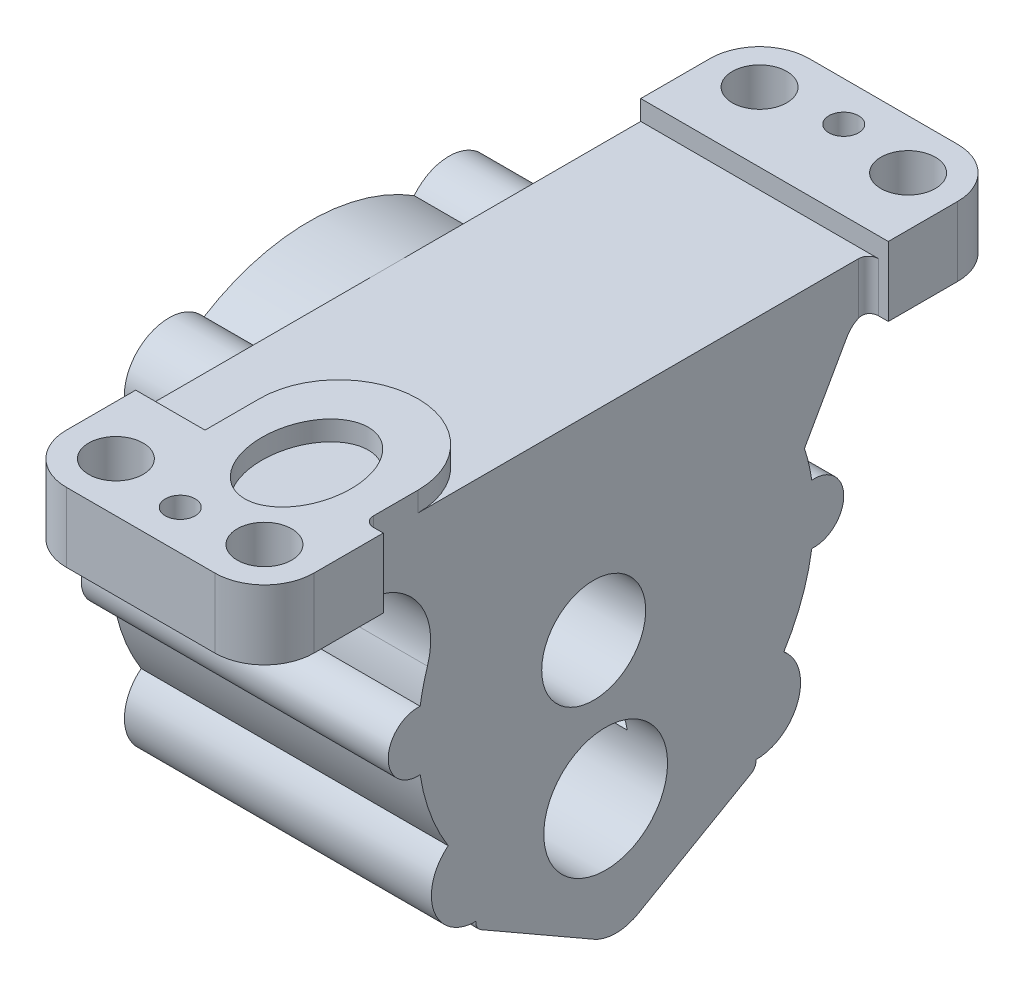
ISO-10303-21;
HEADER;
FILE_DESCRIPTION(('STEP AP214'),'2;1');
FILE_NAME('part.step','',(''),(''),'','','');
FILE_SCHEMA(('AUTOMOTIVE_DESIGN { 1 0 10303 214 1 1 1 1 }'));
ENDSEC;
DATA;
#1=APPLICATION_CONTEXT('core data for automotive mechanical design processes');
#2=APPLICATION_PROTOCOL_DEFINITION('international standard','automotive_design',2000,#1);
#3=PRODUCT_CONTEXT('',#1,'mechanical');
#4=PRODUCT('Part','Part','',(#3));
#5=PRODUCT_RELATED_PRODUCT_CATEGORY('part','',(#4));
#6=PRODUCT_DEFINITION_FORMATION('','',#4);
#7=PRODUCT_DEFINITION_CONTEXT('part definition',#1,'design');
#8=PRODUCT_DEFINITION('design','',#6,#7);
#9=PRODUCT_DEFINITION_SHAPE('','',#8);
#10=(LENGTH_UNIT() NAMED_UNIT(*) SI_UNIT(.MILLI.,.METRE.));
#11=(NAMED_UNIT(*) PLANE_ANGLE_UNIT() SI_UNIT($,.RADIAN.));
#12=(NAMED_UNIT(*) SI_UNIT($,.STERADIAN.) SOLID_ANGLE_UNIT());
#13=UNCERTAINTY_MEASURE_WITH_UNIT(LENGTH_MEASURE(1.E-05),#10,'distance_accuracy_value','');
#14=(GEOMETRIC_REPRESENTATION_CONTEXT(3) GLOBAL_UNCERTAINTY_ASSIGNED_CONTEXT((#13)) GLOBAL_UNIT_ASSIGNED_CONTEXT((#10,
#11,#12)) REPRESENTATION_CONTEXT('',''));
#15=CARTESIAN_POINT('',(0.,0.,0.));
#16=DIRECTION('',(0.,0.,1.));
#17=DIRECTION('',(1.,0.,0.));
#18=AXIS2_PLACEMENT_3D('',#15,#16,#17);
#19=CARTESIAN_POINT('',(-46.,-37.501029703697,-26.2842712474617));
#20=DIRECTION('',(1.,0.,0.));
#21=DIRECTION('',(0.,0.,-1.));
#22=AXIS2_PLACEMENT_3D('',#19,#20,#21);
#23=CYLINDRICAL_SURFACE('',#22,1.99999999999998);
#24=DIRECTION('',(1.,0.,0.));
#25=VECTOR('',#24,1.);
#26=CARTESIAN_POINT('',(-46.,-39.2359252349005,-27.2793277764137));
#27=LINE('',#26,#25);
#28=CARTESIAN_POINT('',(-34.,-39.2359252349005,-27.2793277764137));
#29=VERTEX_POINT('',#28);
#30=CARTESIAN_POINT('',(0.,-39.2359252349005,-27.2793277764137));
#31=VERTEX_POINT('',#30);
#32=EDGE_CURVE('E915',#29,#31,#27,.T.);
#33=ORIENTED_EDGE('',*,*,#32,.F.);
#34=CARTESIAN_POINT('',(-34.,-37.501029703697,-26.2842712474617));
#35=DIRECTION('',(-1.,0.,0.));
#36=DIRECTION('',(0.,0.,1.));
#37=AXIS2_PLACEMENT_3D('',#34,#35,#36);
#38=CIRCLE('',#37,1.99999999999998);
#39=CARTESIAN_POINT('',(-34.,-37.2842635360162,-28.2724896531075));
#40=VERTEX_POINT('',#39);
#41=EDGE_CURVE('E492',#40,#29,#38,.T.);
#42=ORIENTED_EDGE('',*,*,#41,.F.);
#43=DIRECTION('',(1.,0.,0.));
#44=VECTOR('',#43,1.);
#45=CARTESIAN_POINT('',(-46.,-37.2842635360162,-28.2724896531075));
#46=LINE('',#45,#44);
#47=CARTESIAN_POINT('',(0.,-37.2842635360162,-28.2724896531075));
#48=VERTEX_POINT('',#47);
#49=EDGE_CURVE('E913',#40,#48,#46,.T.);
#50=ORIENTED_EDGE('',*,*,#49,.T.);
#51=CARTESIAN_POINT('',(0.,-37.501029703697,-26.2842712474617));
#52=DIRECTION('',(1.,0.,0.));
#53=DIRECTION('',(0.,0.,1.));
#54=AXIS2_PLACEMENT_3D('',#51,#52,#53);
#55=CIRCLE('',#54,1.99999999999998);
#56=EDGE_CURVE('E875',#31,#48,#55,.T.);
#57=ORIENTED_EDGE('',*,*,#56,.F.);
#58=EDGE_LOOP('',(#33,#42,#50,#57));
#59=FACE_BOUND('',#58,.T.);
#60=ADVANCED_FACE('F33',(#59),#23,.T.);
#61=CARTESIAN_POINT('',(-46.,-39.2359252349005,-27.2793277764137));
#62=DIRECTION('',(0.,-0.867447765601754,-0.497528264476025));
#63=DIRECTION('',(0.,0.497528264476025,-0.867447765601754));
#64=AXIS2_PLACEMENT_3D('',#61,#62,#63);
#65=PLANE('',#64);
#66=DIRECTION('',(1.,0.,0.));
#67=VECTOR('',#66,1.);
#68=CARTESIAN_POINT('',(-46.,-52.3011031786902,-4.5));
#69=LINE('',#68,#67);
#70=CARTESIAN_POINT('',(-34.,-52.3011031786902,-4.5));
#71=VERTEX_POINT('',#70);
#72=CARTESIAN_POINT('',(0.,-52.3011031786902,-4.5));
#73=VERTEX_POINT('',#72);
#74=EDGE_CURVE('E917',#71,#73,#69,.T.);
#75=ORIENTED_EDGE('',*,*,#74,.F.);
#76=DIRECTION('',(0.,-0.497528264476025,0.867447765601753));
#77=VECTOR('',#76,1.);
#78=CARTESIAN_POINT('',(-34.,-52.3011031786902,-4.5));
#79=LINE('',#78,#77);
#80=EDGE_CURVE('E494',#29,#71,#79,.T.);
#81=ORIENTED_EDGE('',*,*,#80,.F.);
#82=ORIENTED_EDGE('',*,*,#32,.T.);
#83=DIRECTION('',(0.,0.497528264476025,-0.867447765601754));
#84=VECTOR('',#83,1.);
#85=CARTESIAN_POINT('',(0.,-39.2359252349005,-27.2793277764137));
#86=LINE('',#85,#84);
#87=EDGE_CURVE('E872',#73,#31,#86,.T.);
#88=ORIENTED_EDGE('',*,*,#87,.F.);
#89=EDGE_LOOP('',(#75,#81,#82,#88));
#90=FACE_BOUND('',#89,.T.);
#91=ADVANCED_FACE('F798',(#90),#65,.T.);
#92=CARTESIAN_POINT('',(-46.,-44.4552877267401,0.));
#93=DIRECTION('',(1.,0.,0.));
#94=DIRECTION('',(0.,0.,-1.));
#95=AXIS2_PLACEMENT_3D('',#92,#93,#94);
#96=CYLINDRICAL_SURFACE('',#95,9.04471227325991);
#97=DIRECTION('',(1.,0.,0.));
#98=VECTOR('',#97,1.);
#99=CARTESIAN_POINT('',(-46.,-52.3011031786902,4.5));
#100=LINE('',#99,#98);
#101=CARTESIAN_POINT('',(-34.,-52.3011031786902,4.5));
#102=VERTEX_POINT('',#101);
#103=CARTESIAN_POINT('',(0.,-52.3011031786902,4.5));
#104=VERTEX_POINT('',#103);
#105=EDGE_CURVE('E919',#102,#104,#100,.T.);
#106=ORIENTED_EDGE('',*,*,#105,.F.);
#107=CARTESIAN_POINT('',(-34.,-44.4552877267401,0.));
#108=DIRECTION('',(-1.,0.,0.));
#109=DIRECTION('',(0.,0.,1.));
#110=AXIS2_PLACEMENT_3D('',#107,#108,#109);
#111=CIRCLE('',#110,9.04471227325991);
#112=EDGE_CURVE('E496',#71,#102,#111,.T.);
#113=ORIENTED_EDGE('',*,*,#112,.F.);
#114=ORIENTED_EDGE('',*,*,#74,.T.);
#115=CARTESIAN_POINT('',(0.,-44.4552877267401,0.));
#116=DIRECTION('',(1.,0.,0.));
#117=DIRECTION('',(0.,0.,-1.));
#118=AXIS2_PLACEMENT_3D('',#115,#116,#117);
#119=CIRCLE('',#118,9.04471227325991);
#120=EDGE_CURVE('E869',#104,#73,#119,.T.);
#121=ORIENTED_EDGE('',*,*,#120,.F.);
#122=EDGE_LOOP('',(#106,#113,#114,#121));
#123=FACE_BOUND('',#122,.T.);
#124=ADVANCED_FACE('F804',(#123),#96,.T.);
#125=CARTESIAN_POINT('',(-46.,-39.2359252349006,27.2793277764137));
#126=DIRECTION('',(0.,-0.867447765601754,0.497528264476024));
#127=DIRECTION('',(0.,-0.497528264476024,-0.867447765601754));
#128=AXIS2_PLACEMENT_3D('',#125,#126,#127);
#129=PLANE('',#128);
#130=DIRECTION('',(1.,0.,0.));
#131=VECTOR('',#130,1.);
#132=CARTESIAN_POINT('',(-46.,-39.2359252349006,27.2793277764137));
#133=LINE('',#132,#131);
#134=CARTESIAN_POINT('',(-34.,-39.2359252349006,27.2793277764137));
#135=VERTEX_POINT('',#134);
#136=CARTESIAN_POINT('',(0.,-39.2359252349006,27.2793277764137));
#137=VERTEX_POINT('',#136);
#138=EDGE_CURVE('E921',#135,#137,#133,.T.);
#139=ORIENTED_EDGE('',*,*,#138,.F.);
#140=DIRECTION('',(0.,0.497528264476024,0.867447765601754));
#141=VECTOR('',#140,1.);
#142=CARTESIAN_POINT('',(-34.,-39.2359252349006,27.2793277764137));
#143=LINE('',#142,#141);
#144=EDGE_CURVE('E498',#102,#135,#143,.T.);
#145=ORIENTED_EDGE('',*,*,#144,.F.);
#146=ORIENTED_EDGE('',*,*,#105,.T.);
#147=DIRECTION('',(0.,-0.497528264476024,-0.867447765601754));
#148=VECTOR('',#147,1.);
#149=CARTESIAN_POINT('',(0.,-39.2359252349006,27.2793277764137));
#150=LINE('',#149,#148);
#151=EDGE_CURVE('E866',#137,#104,#150,.T.);
#152=ORIENTED_EDGE('',*,*,#151,.F.);
#153=EDGE_LOOP('',(#139,#145,#146,#152));
#154=FACE_BOUND('',#153,.T.);
#155=ADVANCED_FACE('F814',(#154),#129,.T.);
#156=CARTESIAN_POINT('',(-46.,-37.501029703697,26.2842712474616));
#157=DIRECTION('',(1.,0.,0.));
#158=DIRECTION('',(0.,0.,-1.));
#159=AXIS2_PLACEMENT_3D('',#156,#157,#158);
#160=CYLINDRICAL_SURFACE('',#159,2.);
#161=DIRECTION('',(1.,0.,0.));
#162=VECTOR('',#161,1.);
#163=CARTESIAN_POINT('',(-46.,-37.2842635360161,28.2724896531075));
#164=LINE('',#163,#162);
#165=CARTESIAN_POINT('',(-34.,-37.2842635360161,28.2724896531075));
#166=VERTEX_POINT('',#165);
#167=CARTESIAN_POINT('',(0.,-37.2842635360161,28.2724896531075));
#168=VERTEX_POINT('',#167);
#169=EDGE_CURVE('E923',#166,#168,#164,.T.);
#170=ORIENTED_EDGE('',*,*,#169,.F.);
#171=CARTESIAN_POINT('',(-34.,-37.501029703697,26.2842712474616));
#172=DIRECTION('',(-1.,0.,0.));
#173=DIRECTION('',(0.,0.,1.));
#174=AXIS2_PLACEMENT_3D('',#171,#172,#173);
#175=CIRCLE('',#174,2.00000000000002);
#176=EDGE_CURVE('E500',#135,#166,#175,.T.);
#177=ORIENTED_EDGE('',*,*,#176,.F.);
#178=ORIENTED_EDGE('',*,*,#138,.T.);
#179=CARTESIAN_POINT('',(0.,-37.501029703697,26.2842712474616));
#180=DIRECTION('',(1.,0.,0.));
#181=DIRECTION('',(0.,0.,-1.));
#182=AXIS2_PLACEMENT_3D('',#179,#180,#181);
#183=CIRCLE('',#182,2.);
#184=EDGE_CURVE('E863',#168,#137,#183,.T.);
#185=ORIENTED_EDGE('',*,*,#184,.F.);
#186=EDGE_LOOP('',(#170,#177,#178,#185));
#187=FACE_BOUND('',#186,.T.);
#188=ADVANCED_FACE('F818',(#187),#160,.T.);
#189=CARTESIAN_POINT('',(-46.,16.4214285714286,51.));
#190=DIRECTION('',(-1.,0.,0.));
#191=DIRECTION('',(0.,0.,1.));
#192=AXIS2_PLACEMENT_3D('',#189,#190,#191);
#193=PLANE('',#192);
#194=CARTESIAN_POINT('',(-46.,0.,0.));
#195=DIRECTION('',(1.,0.,0.));
#196=DIRECTION('',(0.,0.,-1.));
#197=AXIS2_PLACEMENT_3D('',#194,#195,#196);
#198=CIRCLE('',#197,40.);
#199=CARTESIAN_POINT('',(-46.,21.2447647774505,33.8918864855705));
#200=VERTEX_POINT('',#199);
#201=CARTESIAN_POINT('',(-46.,12.2596987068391,38.0749233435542));
#202=VERTEX_POINT('',#201);
#203=EDGE_CURVE('E522',#200,#202,#198,.T.);
#204=ORIENTED_EDGE('',*,*,#203,.T.);
#205=CARTESIAN_POINT('',(-46.,16.4214285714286,51.));
#206=DIRECTION('',(-1.,0.,0.));
#207=DIRECTION('',(0.,0.,1.));
#208=AXIS2_PLACEMENT_3D('',#205,#206,#207);
#209=CIRCLE('',#208,13.5785714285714);
#210=CARTESIAN_POINT('',(-46.,30.,51.));
#211=VERTEX_POINT('',#210);
#212=EDGE_CURVE('E964',#211,#202,#209,.T.);
#213=ORIENTED_EDGE('',*,*,#212,.F.);
#214=DIRECTION('',(0.,0.,-1.));
#215=VECTOR('',#214,1.);
#216=CARTESIAN_POINT('',(-46.,30.,75.));
#217=LINE('',#216,#215);
#218=CARTESIAN_POINT('',(-46.,30.,65.));
#219=VERTEX_POINT('',#218);
#220=EDGE_CURVE('E898',#219,#211,#217,.T.);
#221=ORIENTED_EDGE('',*,*,#220,.F.);
#222=DIRECTION('',(0.,-1.,0.));
#223=VECTOR('',#222,1.);
#224=CARTESIAN_POINT('',(-46.,16.4214285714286,65.));
#225=LINE('',#224,#223);
#226=CARTESIAN_POINT('',(-46.,44.,65.));
#227=VERTEX_POINT('',#226);
#228=EDGE_CURVE('E731',#219,#227,#225,.F.);
#229=ORIENTED_EDGE('',*,*,#228,.T.);
#230=DIRECTION('',(0.,0.,1.));
#231=VECTOR('',#230,1.);
#232=CARTESIAN_POINT('',(-46.,44.,51.));
#233=LINE('',#232,#231);
#234=CARTESIAN_POINT('',(-46.,44.,51.));
#235=VERTEX_POINT('',#234);
#236=EDGE_CURVE('E643',#235,#227,#233,.T.);
#237=ORIENTED_EDGE('',*,*,#236,.F.);
#238=DIRECTION('',(0.,-1.,0.));
#239=VECTOR('',#238,1.);
#240=CARTESIAN_POINT('',(-46.,44.,51.));
#241=LINE('',#240,#239);
#242=CARTESIAN_POINT('',(-46.,40.,51.));
#243=VERTEX_POINT('',#242);
#244=EDGE_CURVE('E659',#235,#243,#241,.T.);
#245=ORIENTED_EDGE('',*,*,#244,.T.);
#246=DIRECTION('',(0.,0.,1.));
#247=VECTOR('',#246,1.);
#248=CARTESIAN_POINT('',(-46.,40.,75.));
#249=LINE('',#248,#247);
#250=CARTESIAN_POINT('',(-46.,40.,0.));
#251=VERTEX_POINT('',#250);
#252=EDGE_CURVE('E937',#251,#243,#249,.T.);
#253=ORIENTED_EDGE('',*,*,#252,.F.);
#254=CARTESIAN_POINT('',(-46.,0.,0.));
#255=DIRECTION('',(-1.,0.,0.));
#256=DIRECTION('',(0.,0.,1.));
#257=AXIS2_PLACEMENT_3D('',#254,#255,#256);
#258=CIRCLE('',#257,40.);
#259=CARTESIAN_POINT('',(-46.,33.8918864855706,21.2447647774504));
#260=VERTEX_POINT('',#259);
#261=EDGE_CURVE('E1899',#260,#251,#258,.T.);
#262=ORIENTED_EDGE('',*,*,#261,.F.);
#263=CARTESIAN_POINT('',(-46.,28.284271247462,28.2842712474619));
#264=DIRECTION('',(1.,0.,0.));
#265=DIRECTION('',(0.,0.,-1.));
#266=AXIS2_PLACEMENT_3D('',#263,#264,#265);
#267=CIRCLE('',#266,9.00000000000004);
#268=EDGE_CURVE('E529',#260,#200,#267,.T.);
#269=ORIENTED_EDGE('',*,*,#268,.T.);
#270=EDGE_LOOP('',(#204,#213,#221,#229,#237,#245,#253,#262,#269));
#271=FACE_BOUND('',#270,.T.);
#272=ADVANCED_FACE('F822',(#271),#193,.T.);
#273=CARTESIAN_POINT('',(-46.,0.,0.));
#274=DIRECTION('',(1.,0.,0.));
#275=DIRECTION('',(0.,0.,-1.));
#276=AXIS2_PLACEMENT_3D('',#273,#274,#275);
#277=CIRCLE('',#276,40.);
#278=CARTESIAN_POINT('',(-46.,33.8918864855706,-21.2447647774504));
#279=VERTEX_POINT('',#278);
#280=EDGE_CURVE('E567',#279,#251,#277,.T.);
#281=ORIENTED_EDGE('',*,*,#280,.T.);
#282=CARTESIAN_POINT('',(-46.,40.,-51.));
#283=VERTEX_POINT('',#282);
#284=EDGE_CURVE('E689',#283,#251,#249,.T.);
#285=ORIENTED_EDGE('',*,*,#284,.F.);
#286=DIRECTION('',(0.,-1.,0.));
#287=VECTOR('',#286,1.);
#288=CARTESIAN_POINT('',(-46.,44.,-51.));
#289=LINE('',#288,#287);
#290=CARTESIAN_POINT('',(-46.,44.,-51.));
#291=VERTEX_POINT('',#290);
#292=EDGE_CURVE('E692',#291,#283,#289,.T.);
#293=ORIENTED_EDGE('',*,*,#292,.F.);
#294=DIRECTION('',(0.,0.,1.));
#295=VECTOR('',#294,1.);
#296=CARTESIAN_POINT('',(-46.,44.,-75.));
#297=LINE('',#296,#295);
#298=CARTESIAN_POINT('',(-46.,44.,-65.));
#299=VERTEX_POINT('',#298);
#300=EDGE_CURVE('E675',#299,#291,#297,.T.);
#301=ORIENTED_EDGE('',*,*,#300,.F.);
#302=DIRECTION('',(0.,1.,0.));
#303=VECTOR('',#302,1.);
#304=CARTESIAN_POINT('',(-46.,16.4214285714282,-64.9999999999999));
#305=LINE('',#304,#303);
#306=CARTESIAN_POINT('',(-46.,30.,-65.));
#307=VERTEX_POINT('',#306);
#308=EDGE_CURVE('E733',#299,#307,#305,.F.);
#309=ORIENTED_EDGE('',*,*,#308,.T.);
#310=DIRECTION('',(0.,0.,-1.));
#311=VECTOR('',#310,1.);
#312=CARTESIAN_POINT('',(-46.,30.,-75.));
#313=LINE('',#312,#311);
#314=CARTESIAN_POINT('',(-46.,30.,-51.));
#315=VERTEX_POINT('',#314);
#316=EDGE_CURVE('E940',#315,#307,#313,.T.);
#317=ORIENTED_EDGE('',*,*,#316,.F.);
#318=CARTESIAN_POINT('',(-46.,25.,-51.));
#319=DIRECTION('',(-1.,0.,0.));
#320=DIRECTION('',(0.,0.,-1.));
#321=AXIS2_PLACEMENT_3D('',#318,#319,#320);
#322=CIRCLE('',#321,5.);
#323=CARTESIAN_POINT('',(-46.,27.4560776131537,-46.6448096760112));
#324=VERTEX_POINT('',#323);
#325=EDGE_CURVE('E945',#324,#315,#322,.T.);
#326=ORIENTED_EDGE('',*,*,#325,.F.);
#327=DIRECTION('',(0.,0.87103806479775,-0.491215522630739));
#328=VECTOR('',#327,1.);
#329=CARTESIAN_POINT('',(-46.,27.4560776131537,-46.6448096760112));
#330=LINE('',#329,#328);
#331=CARTESIAN_POINT('',(-46.,12.2596987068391,-38.0749233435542));
#332=VERTEX_POINT('',#331);
#333=EDGE_CURVE('E961',#332,#324,#330,.T.);
#334=ORIENTED_EDGE('',*,*,#333,.F.);
#335=CARTESIAN_POINT('',(-46.,0.,0.));
#336=DIRECTION('',(-1.,0.,0.));
#337=DIRECTION('',(0.,0.,1.));
#338=AXIS2_PLACEMENT_3D('',#335,#336,#337);
#339=CIRCLE('',#338,40.);
#340=CARTESIAN_POINT('',(-46.,21.2447647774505,-33.8918864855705));
#341=VERTEX_POINT('',#340);
#342=EDGE_CURVE('E954',#341,#332,#339,.T.);
#343=ORIENTED_EDGE('',*,*,#342,.F.);
#344=CARTESIAN_POINT('',(-46.,28.2842712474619,-28.2842712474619));
#345=DIRECTION('',(1.,0.,0.));
#346=DIRECTION('',(0.,0.,1.));
#347=AXIS2_PLACEMENT_3D('',#344,#345,#346);
#348=CIRCLE('',#347,9.00000000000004);
#349=EDGE_CURVE('E564',#341,#279,#348,.T.);
#350=ORIENTED_EDGE('',*,*,#349,.T.);
#351=EDGE_LOOP('',(#281,#285,#293,#301,#309,#317,#326,#334,#343,#350));
#352=FACE_BOUND('',#351,.T.);
#353=ADVANCED_FACE('F1102',(#352),#193,.T.);
#354=CARTESIAN_POINT('',(-46.,40.,75.));
#355=DIRECTION('',(0.,1.,0.));
#356=DIRECTION('',(0.,0.,1.));
#357=AXIS2_PLACEMENT_3D('',#354,#355,#356);
#358=PLANE('',#357);
#359=DIRECTION('',(0.,0.,1.));
#360=VECTOR('',#359,1.);
#361=CARTESIAN_POINT('',(-32.,40.,40.));
#362=LINE('',#361,#360);
#363=CARTESIAN_POINT('',(-32.,40.,40.));
#364=VERTEX_POINT('',#363);
#365=CARTESIAN_POINT('',(-32.,40.,51.));
#366=VERTEX_POINT('',#365);
#367=EDGE_CURVE('E653',#364,#366,#362,.T.);
#368=ORIENTED_EDGE('',*,*,#367,.F.);
#369=CARTESIAN_POINT('',(-16.,40.,40.));
#370=DIRECTION('',(0.,1.,0.));
#371=DIRECTION('',(0.,0.,1.));
#372=AXIS2_PLACEMENT_3D('',#369,#370,#371);
#373=CIRCLE('',#372,16.);
#374=CARTESIAN_POINT('',(0.,40.,40.));
#375=VERTEX_POINT('',#374);
#376=EDGE_CURVE('E630',#375,#364,#373,.T.);
#377=ORIENTED_EDGE('',*,*,#376,.F.);
#378=DIRECTION('',(0.,0.,1.));
#379=VECTOR('',#378,1.);
#380=CARTESIAN_POINT('',(0.,40.,75.));
#381=LINE('',#380,#379);
#382=CARTESIAN_POINT('',(0.,40.,-49.));
#383=VERTEX_POINT('',#382);
#384=EDGE_CURVE('E896',#383,#375,#381,.T.);
#385=ORIENTED_EDGE('',*,*,#384,.F.);
#386=CARTESIAN_POINT('',(2.,40.,-49.));
#387=DIRECTION('',(0.,1.,0.));
#388=DIRECTION('',(0.,0.,1.));
#389=AXIS2_PLACEMENT_3D('',#386,#387,#388);
#390=CIRCLE('',#389,2.);
#391=CARTESIAN_POINT('',(2.,40.,-51.));
#392=VERTEX_POINT('',#391);
#393=EDGE_CURVE('E1046',#383,#392,#390,.F.);
#394=ORIENTED_EDGE('',*,*,#393,.T.);
#395=DIRECTION('',(1.,0.,0.));
#396=VECTOR('',#395,1.);
#397=CARTESIAN_POINT('',(4.,40.,-51.));
#398=LINE('',#397,#396);
#399=EDGE_CURVE('E671',#283,#392,#398,.T.);
#400=ORIENTED_EDGE('',*,*,#399,.F.);
#401=ORIENTED_EDGE('',*,*,#284,.T.);
#402=ORIENTED_EDGE('',*,*,#252,.T.);
#403=DIRECTION('',(-1.,0.,0.));
#404=VECTOR('',#403,1.);
#405=CARTESIAN_POINT('',(-32.,40.,51.));
#406=LINE('',#405,#404);
#407=EDGE_CURVE('E635',#366,#243,#406,.T.);
#408=ORIENTED_EDGE('',*,*,#407,.F.);
#409=EDGE_LOOP('',(#368,#377,#385,#394,#400,#401,#402,#408));
#410=FACE_BOUND('',#409,.T.);
#411=ADVANCED_FACE('F775',(#410),#358,.T.);
#412=CARTESIAN_POINT('',(-46.,40.,75.));
#413=DIRECTION('',(0.,0.,1.));
#414=DIRECTION('',(1.,0.,0.));
#415=AXIS2_PLACEMENT_3D('',#412,#413,#414);
#416=PLANE('',#415);
#417=DIRECTION('',(1.,0.,0.));
#418=VECTOR('',#417,1.);
#419=CARTESIAN_POINT('',(-46.,30.,75.));
#420=LINE('',#419,#418);
#421=CARTESIAN_POINT('',(-36.,30.,75.));
#422=VERTEX_POINT('',#421);
#423=CARTESIAN_POINT('',(-6.,30.,75.));
#424=VERTEX_POINT('',#423);
#425=EDGE_CURVE('E932',#422,#424,#420,.T.);
#426=ORIENTED_EDGE('',*,*,#425,.T.);
#427=DIRECTION('',(0.,-1.,0.));
#428=VECTOR('',#427,1.);
#429=CARTESIAN_POINT('',(-6.,44.,75.));
#430=LINE('',#429,#428);
#431=CARTESIAN_POINT('',(-6.,44.,75.));
#432=VERTEX_POINT('',#431);
#433=EDGE_CURVE('E725',#424,#432,#430,.F.);
#434=ORIENTED_EDGE('',*,*,#433,.T.);
#435=DIRECTION('',(1.,0.,0.));
#436=VECTOR('',#435,1.);
#437=CARTESIAN_POINT('',(-46.,44.,75.));
#438=LINE('',#437,#436);
#439=CARTESIAN_POINT('',(-36.,44.,75.));
#440=VERTEX_POINT('',#439);
#441=EDGE_CURVE('E646',#440,#432,#438,.T.);
#442=ORIENTED_EDGE('',*,*,#441,.F.);
#443=DIRECTION('',(0.,-1.,0.));
#444=VECTOR('',#443,1.);
#445=CARTESIAN_POINT('',(-36.,40.,75.));
#446=LINE('',#445,#444);
#447=EDGE_CURVE('E722',#440,#422,#446,.T.);
#448=ORIENTED_EDGE('',*,*,#447,.T.);
#449=EDGE_LOOP('',(#426,#434,#442,#448));
#450=FACE_BOUND('',#449,.T.);
#451=ADVANCED_FACE('F771',(#450),#416,.T.);
#452=CARTESIAN_POINT('',(-46.,40.,-75.));
#453=DIRECTION('',(0.,0.,-1.));
#454=DIRECTION('',(0.,1.,0.));
#455=AXIS2_PLACEMENT_3D('',#452,#453,#454);
#456=PLANE('',#455);
#457=DIRECTION('',(-1.,0.,0.));
#458=VECTOR('',#457,1.);
#459=CARTESIAN_POINT('',(-46.,44.,-75.));
#460=LINE('',#459,#458);
#461=CARTESIAN_POINT('',(-6.,44.,-75.));
#462=VERTEX_POINT('',#461);
#463=CARTESIAN_POINT('',(-36.,44.,-75.));
#464=VERTEX_POINT('',#463);
#465=EDGE_CURVE('E672',#462,#464,#460,.T.);
#466=ORIENTED_EDGE('',*,*,#465,.F.);
#467=DIRECTION('',(0.,-1.,0.));
#468=VECTOR('',#467,1.);
#469=CARTESIAN_POINT('',(-6.,30.,-75.));
#470=LINE('',#469,#468);
#471=CARTESIAN_POINT('',(-6.,30.,-75.));
#472=VERTEX_POINT('',#471);
#473=EDGE_CURVE('E701',#462,#472,#470,.T.);
#474=ORIENTED_EDGE('',*,*,#473,.T.);
#475=DIRECTION('',(1.,0.,0.));
#476=VECTOR('',#475,1.);
#477=CARTESIAN_POINT('',(-46.,30.,-75.));
#478=LINE('',#477,#476);
#479=CARTESIAN_POINT('',(-36.,30.,-75.));
#480=VERTEX_POINT('',#479);
#481=EDGE_CURVE('E702',#480,#472,#478,.T.);
#482=ORIENTED_EDGE('',*,*,#481,.F.);
#483=DIRECTION('',(0.,1.,0.));
#484=VECTOR('',#483,1.);
#485=CARTESIAN_POINT('',(-36.,40.,-75.));
#486=LINE('',#485,#484);
#487=EDGE_CURVE('E698',#480,#464,#486,.T.);
#488=ORIENTED_EDGE('',*,*,#487,.T.);
#489=EDGE_LOOP('',(#466,#474,#482,#488));
#490=FACE_BOUND('',#489,.T.);
#491=ADVANCED_FACE('F774',(#490),#456,.T.);
#492=CARTESIAN_POINT('',(-46.,30.,-75.));
#493=DIRECTION('',(0.,-1.,0.));
#494=DIRECTION('',(0.,0.,-1.));
#495=AXIS2_PLACEMENT_3D('',#492,#493,#494);
#496=PLANE('',#495);
#497=CARTESIAN_POINT('',(-36.,30.,-65.));
#498=DIRECTION('',(0.,-1.,0.));
#499=DIRECTION('',(0.,0.,-1.));
#500=AXIS2_PLACEMENT_3D('',#497,#498,#499);
#501=CIRCLE('',#500,5.5);
#502=CARTESIAN_POINT('',(-36.,30.,-59.5));
#503=VERTEX_POINT('',#502);
#504=EDGE_CURVE('E609',#503,#503,#501,.T.);
#505=ORIENTED_EDGE('',*,*,#504,.F.);
#506=EDGE_LOOP('',(#505));
#507=FACE_BOUND('',#506,.T.);
#508=CARTESIAN_POINT('',(-6.,30.,-65.));
#509=DIRECTION('',(0.,-1.,0.));
#510=DIRECTION('',(0.,0.,-1.));
#511=AXIS2_PLACEMENT_3D('',#508,#509,#510);
#512=CIRCLE('',#511,5.5);
#513=CARTESIAN_POINT('',(-6.,30.,-59.5));
#514=VERTEX_POINT('',#513);
#515=EDGE_CURVE('E615',#514,#514,#512,.T.);
#516=ORIENTED_EDGE('',*,*,#515,.F.);
#517=EDGE_LOOP('',(#516));
#518=FACE_BOUND('',#517,.T.);
#519=CARTESIAN_POINT('',(-21.,30.,-67.));
#520=DIRECTION('',(0.,-1.,0.));
#521=DIRECTION('',(0.,0.,-1.));
#522=AXIS2_PLACEMENT_3D('',#519,#520,#521);
#523=CIRCLE('',#522,3.);
#524=CARTESIAN_POINT('',(-21.,30.,-64.));
#525=VERTEX_POINT('',#524);
#526=EDGE_CURVE('E621',#525,#525,#523,.T.);
#527=ORIENTED_EDGE('',*,*,#526,.F.);
#528=EDGE_LOOP('',(#527));
#529=FACE_BOUND('',#528,.T.);
#530=ORIENTED_EDGE('',*,*,#481,.T.);
#531=CARTESIAN_POINT('',(-6.,30.,-65.));
#532=DIRECTION('',(0.,-1.,0.));
#533=DIRECTION('',(0.,0.,-1.));
#534=AXIS2_PLACEMENT_3D('',#531,#532,#533);
#535=CIRCLE('',#534,10.);
#536=CARTESIAN_POINT('',(3.99999999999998,30.,-65.));
#537=VERTEX_POINT('',#536);
#538=EDGE_CURVE('E707',#472,#537,#535,.T.);
#539=ORIENTED_EDGE('',*,*,#538,.T.);
#540=DIRECTION('',(0.,0.,-1.));
#541=VECTOR('',#540,1.);
#542=CARTESIAN_POINT('',(3.99999999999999,30.,-51.));
#543=LINE('',#542,#541);
#544=CARTESIAN_POINT('',(3.99999999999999,30.,-51.));
#545=VERTEX_POINT('',#544);
#546=EDGE_CURVE('E584',#545,#537,#543,.T.);
#547=ORIENTED_EDGE('',*,*,#546,.F.);
#548=DIRECTION('',(-1.,0.,0.));
#549=VECTOR('',#548,1.);
#550=CARTESIAN_POINT('',(30.,30.,-51.));
#551=LINE('',#550,#549);
#552=CARTESIAN_POINT('',(2.,30.,-51.));
#553=VERTEX_POINT('',#552);
#554=EDGE_CURVE('E574',#545,#553,#551,.T.);
#555=ORIENTED_EDGE('',*,*,#554,.T.);
#556=DIRECTION('',(1.,0.,0.));
#557=VECTOR('',#556,1.);
#558=CARTESIAN_POINT('',(-46.,30.,-51.));
#559=LINE('',#558,#557);
#560=EDGE_CURVE('E901',#315,#553,#559,.T.);
#561=ORIENTED_EDGE('',*,*,#560,.F.);
#562=ORIENTED_EDGE('',*,*,#316,.T.);
#563=CARTESIAN_POINT('',(-36.,30.,-65.));
#564=DIRECTION('',(0.,-1.,0.));
#565=DIRECTION('',(0.,0.,-1.));
#566=AXIS2_PLACEMENT_3D('',#563,#564,#565);
#567=CIRCLE('',#566,10.);
#568=EDGE_CURVE('E705',#307,#480,#567,.T.);
#569=ORIENTED_EDGE('',*,*,#568,.T.);
#570=EDGE_LOOP('',(#530,#539,#547,#555,#561,#562,#569));
#571=FACE_BOUND('',#570,.T.);
#572=ADVANCED_FACE('F1111',(#507,#518,#529,#571),#496,.T.);
#573=CARTESIAN_POINT('',(-46.,25.,-51.));
#574=DIRECTION('',(1.,0.,0.));
#575=DIRECTION('',(0.,0.,-1.));
#576=AXIS2_PLACEMENT_3D('',#573,#574,#575);
#577=CYLINDRICAL_SURFACE('',#576,5.);
#578=CARTESIAN_POINT('',(0.,25.,-51.));
#579=DIRECTION('',(-1.,0.,0.));
#580=DIRECTION('',(0.,0.,-1.));
#581=AXIS2_PLACEMENT_3D('',#578,#579,#580);
#582=CIRCLE('',#581,5.);
#583=CARTESIAN_POINT('',(0.,27.4560776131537,-46.6448096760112));
#584=VERTEX_POINT('',#583);
#585=CARTESIAN_POINT('',(0.,29.5825756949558,-49.));
#586=VERTEX_POINT('',#585);
#587=EDGE_CURVE('E893',#584,#586,#582,.T.);
#588=ORIENTED_EDGE('',*,*,#587,.F.);
#589=DIRECTION('',(1.,0.,0.));
#590=VECTOR('',#589,1.);
#591=CARTESIAN_POINT('',(-46.,27.4560776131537,-46.6448096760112));
#592=LINE('',#591,#590);
#593=EDGE_CURVE('E903',#324,#584,#592,.T.);
#594=ORIENTED_EDGE('',*,*,#593,.F.);
#595=ORIENTED_EDGE('',*,*,#325,.T.);
#596=ORIENTED_EDGE('',*,*,#560,.T.);
#597=CARTESIAN_POINT('',(2.,30.,-51.));
#598=CARTESIAN_POINT('',(1.94381975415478,29.9999945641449,-50.9999996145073));
#599=CARTESIAN_POINT('',(1.88766639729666,30.0000006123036,-50.9976313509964));
#600=CARTESIAN_POINT('',(1.77575987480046,29.9999893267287,-50.988183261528));
#601=CARTESIAN_POINT('',(1.72000669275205,29.9999719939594,-50.9811036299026));
#602=CARTESIAN_POINT('',(1.55401109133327,29.999815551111,-50.9528593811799));
#603=CARTESIAN_POINT('',(1.44487749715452,29.9995722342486,-50.9246892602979));
#604=CARTESIAN_POINT('',(1.23287707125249,29.9978992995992,-50.8504487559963));
#605=CARTESIAN_POINT('',(1.13001383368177,29.996469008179,-50.804368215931));
#606=CARTESIAN_POINT('',(0.933514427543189,29.9910237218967,-50.695642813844));
#607=CARTESIAN_POINT('',(0.839876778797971,29.9870091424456,-50.6330006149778));
#608=CARTESIAN_POINT('',(0.665163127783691,29.9747701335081,-50.4935269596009));
#609=CARTESIAN_POINT('',(0.584008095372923,29.9665737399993,-50.4167921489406));
#610=CARTESIAN_POINT('',(0.435932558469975,29.9443437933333,-50.2513994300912));
#611=CARTESIAN_POINT('',(0.369005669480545,29.9303128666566,-50.162746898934));
#612=CARTESIAN_POINT('',(0.252786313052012,29.8955436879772,-49.9791492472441));
#613=CARTESIAN_POINT('',(0.203068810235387,29.8749955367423,-49.8844368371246));
#614=CARTESIAN_POINT('',(0.119788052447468,29.8263592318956,-49.689926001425));
#615=CARTESIAN_POINT('',(0.0862323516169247,29.7982675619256,-49.5901252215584));
#616=CARTESIAN_POINT('',(0.0402167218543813,29.7405118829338,-49.4078630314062));
#617=CARTESIAN_POINT('',(0.0249724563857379,29.7121425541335,-49.3256795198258));
#618=CARTESIAN_POINT('',(0.00989256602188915,29.6660878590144,-49.2029087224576));
#619=CARTESIAN_POINT('',(0.00616357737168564,29.6501655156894,-49.1620982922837));
#620=CARTESIAN_POINT('',(0.00121713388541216,29.6171996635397,-49.0807827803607));
#621=CARTESIAN_POINT('',(-5.53313047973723E-07,29.6001562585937,-49.0402776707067));
#622=CARTESIAN_POINT('',(0.,29.5825756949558,-49.));
#623=B_SPLINE_CURVE_WITH_KNOTS('',3,(#597,#598,#599,#600,#601,#602,#603,#604,#605,#606,#607,
#608,#609,#610,#611,#612,#613,#614,#615,#616,#617,#618,#619,#620,#621,#622),.UNSPECIFIED.,.F.,
.F.,(4,2,2,2,2,2,2,2,2,2,2,2,4),(0.,0.168437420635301,0.336867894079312,0.673269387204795,
1.00986192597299,1.346400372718,1.68071165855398,2.01487261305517,2.34006609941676,
2.66541143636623,2.92942559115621,3.06124371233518,3.19304963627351),.UNSPECIFIED.);
#624=EDGE_CURVE('E949',#553,#586,#623,.T.);
#625=ORIENTED_EDGE('',*,*,#624,.T.);
#626=EDGE_LOOP('',(#588,#594,#595,#596,#625));
#627=FACE_BOUND('',#626,.T.);
#628=ADVANCED_FACE('F1039',(#627),#577,.F.);
#629=CARTESIAN_POINT('',(-46.,27.4560776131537,-46.6448096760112));
#630=DIRECTION('',(0.,-0.49121552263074,-0.87103806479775));
#631=DIRECTION('',(0.,0.87103806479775,-0.49121552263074));
#632=AXIS2_PLACEMENT_3D('',#629,#630,#631);
#633=PLANE('',#632);
#634=DIRECTION('',(0.,0.87103806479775,-0.491215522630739));
#635=VECTOR('',#634,1.);
#636=CARTESIAN_POINT('',(0.,27.4560776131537,-46.6448096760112));
#637=LINE('',#636,#635);
#638=CARTESIAN_POINT('',(0.,12.2596987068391,-38.0749233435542));
#639=VERTEX_POINT('',#638);
#640=EDGE_CURVE('E890',#639,#584,#637,.T.);
#641=ORIENTED_EDGE('',*,*,#640,.F.);
#642=DIRECTION('',(1.,0.,0.));
#643=VECTOR('',#642,1.);
#644=CARTESIAN_POINT('',(-46.,12.2596987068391,-38.0749233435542));
#645=LINE('',#644,#643);
#646=EDGE_CURVE('E905',#332,#639,#645,.T.);
#647=ORIENTED_EDGE('',*,*,#646,.F.);
#648=ORIENTED_EDGE('',*,*,#333,.T.);
#649=ORIENTED_EDGE('',*,*,#593,.T.);
#650=EDGE_LOOP('',(#641,#647,#648,#649));
#651=FACE_BOUND('',#650,.T.);
#652=ADVANCED_FACE('F1035',(#651),#633,.T.);
#653=CARTESIAN_POINT('',(-46.,0.,0.));
#654=DIRECTION('',(1.,0.,0.));
#655=DIRECTION('',(0.,0.,-1.));
#656=AXIS2_PLACEMENT_3D('',#653,#654,#655);
#657=CYLINDRICAL_SURFACE('',#656,40.);
#658=CARTESIAN_POINT('',(0.,0.,0.));
#659=DIRECTION('',(1.,0.,0.));
#660=DIRECTION('',(0.,0.,-1.));
#661=AXIS2_PLACEMENT_3D('',#658,#659,#660);
#662=CIRCLE('',#661,40.);
#663=CARTESIAN_POINT('',(0.,5.98310120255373,-39.55));
#664=VERTEX_POINT('',#663);
#665=EDGE_CURVE('E887',#664,#639,#662,.T.);
#666=ORIENTED_EDGE('',*,*,#665,.F.);
#667=DIRECTION('',(1.,0.,0.));
#668=VECTOR('',#667,1.);
#669=CARTESIAN_POINT('',(-46.,5.98310120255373,-39.55));
#670=LINE('',#669,#668);
#671=CARTESIAN_POINT('',(-62.,5.98310120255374,-39.55));
#672=VERTEX_POINT('',#671);
#673=EDGE_CURVE('E907',#672,#664,#670,.T.);
#674=ORIENTED_EDGE('',*,*,#673,.F.);
#675=CARTESIAN_POINT('',(-62.,0.,0.));
#676=DIRECTION('',(1.,0.,0.));
#677=DIRECTION('',(0.,0.,-1.));
#678=AXIS2_PLACEMENT_3D('',#675,#676,#677);
#679=CIRCLE('',#678,40.);
#680=CARTESIAN_POINT('',(-62.,21.2447647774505,-33.8918864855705));
#681=VERTEX_POINT('',#680);
#682=EDGE_CURVE('E550',#672,#681,#679,.T.);
#683=ORIENTED_EDGE('',*,*,#682,.T.);
#684=DIRECTION('',(1.,0.,0.));
#685=VECTOR('',#684,1.);
#686=CARTESIAN_POINT('',(-62.,21.2447647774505,-33.8918864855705));
#687=LINE('',#686,#685);
#688=EDGE_CURVE('E579',#681,#341,#687,.T.);
#689=ORIENTED_EDGE('',*,*,#688,.T.);
#690=ORIENTED_EDGE('',*,*,#342,.T.);
#691=ORIENTED_EDGE('',*,*,#646,.T.);
#692=EDGE_LOOP('',(#666,#674,#683,#689,#690,#691));
#693=FACE_BOUND('',#692,.T.);
#694=ADVANCED_FACE('F997',(#693),#657,.T.);
#695=CARTESIAN_POINT('',(-46.,0.,-39.9999999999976));
#696=DIRECTION('',(1.,0.,0.));
#697=DIRECTION('',(0.,0.,-1.));
#698=AXIS2_PLACEMENT_3D('',#695,#696,#697);
#699=CYLINDRICAL_SURFACE('',#698,5.99999999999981);
#700=CARTESIAN_POINT('',(0.,0.,-39.9999999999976));
#701=DIRECTION('',(1.,0.,0.));
#702=DIRECTION('',(0.,0.,-1.));
#703=AXIS2_PLACEMENT_3D('',#700,#701,#702);
#704=CIRCLE('',#703,5.99999999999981);
#705=CARTESIAN_POINT('',(0.,-5.98310120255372,-39.55));
#706=VERTEX_POINT('',#705);
#707=EDGE_CURVE('E884',#706,#664,#704,.T.);
#708=ORIENTED_EDGE('',*,*,#707,.F.);
#709=DIRECTION('',(1.,0.,0.));
#710=VECTOR('',#709,1.);
#711=CARTESIAN_POINT('',(-46.,-5.98310120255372,-39.55));
#712=LINE('',#711,#710);
#713=CARTESIAN_POINT('',(-62.,-5.98310120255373,-39.55));
#714=VERTEX_POINT('',#713);
#715=EDGE_CURVE('E909',#714,#706,#712,.T.);
#716=ORIENTED_EDGE('',*,*,#715,.F.);
#717=CARTESIAN_POINT('',(-62.,0.,-39.9999999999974));
#718=DIRECTION('',(1.,0.,0.));
#719=DIRECTION('',(0.,0.,-1.));
#720=AXIS2_PLACEMENT_3D('',#717,#718,#719);
#721=CIRCLE('',#720,5.99999999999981);
#722=EDGE_CURVE('E547',#714,#672,#721,.T.);
#723=ORIENTED_EDGE('',*,*,#722,.T.);
#724=ORIENTED_EDGE('',*,*,#673,.T.);
#725=EDGE_LOOP('',(#708,#716,#723,#724));
#726=FACE_BOUND('',#725,.T.);
#727=ADVANCED_FACE('F1003',(#726),#699,.T.);
#728=CARTESIAN_POINT('',(-46.,0.,0.));
#729=DIRECTION('',(1.,0.,0.));
#730=DIRECTION('',(0.,0.,-1.));
#731=AXIS2_PLACEMENT_3D('',#728,#729,#730);
#732=CYLINDRICAL_SURFACE('',#731,40.);
#733=CARTESIAN_POINT('',(0.,0.,0.));
#734=DIRECTION('',(1.,0.,0.));
#735=DIRECTION('',(0.,0.,-1.));
#736=AXIS2_PLACEMENT_3D('',#733,#734,#735);
#737=CIRCLE('',#736,40.);
#738=CARTESIAN_POINT('',(0.,-21.2447647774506,-33.8918864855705));
#739=VERTEX_POINT('',#738);
#740=EDGE_CURVE('E881',#739,#706,#737,.T.);
#741=ORIENTED_EDGE('',*,*,#740,.F.);
#742=DIRECTION('',(1.,0.,0.));
#743=VECTOR('',#742,1.);
#744=CARTESIAN_POINT('',(-46.,-21.2447647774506,-33.8918864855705));
#745=LINE('',#744,#743);
#746=CARTESIAN_POINT('',(-62.,-21.2447647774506,-33.8918864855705));
#747=VERTEX_POINT('',#746);
#748=EDGE_CURVE('E911',#747,#739,#745,.T.);
#749=ORIENTED_EDGE('',*,*,#748,.F.);
#750=CARTESIAN_POINT('',(-62.,0.,0.));
#751=DIRECTION('',(1.,0.,0.));
#752=DIRECTION('',(0.,0.,-1.));
#753=AXIS2_PLACEMENT_3D('',#750,#751,#752);
#754=CIRCLE('',#753,40.);
#755=EDGE_CURVE('E544',#747,#714,#754,.T.);
#756=ORIENTED_EDGE('',*,*,#755,.T.);
#757=ORIENTED_EDGE('',*,*,#715,.T.);
#758=EDGE_LOOP('',(#741,#749,#756,#757));
#759=FACE_BOUND('',#758,.T.);
#760=ADVANCED_FACE('F1006',(#759),#732,.T.);
#761=CARTESIAN_POINT('',(-46.,-28.284271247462,-28.2842712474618));
#762=DIRECTION('',(1.,0.,0.));
#763=DIRECTION('',(0.,0.,-1.));
#764=AXIS2_PLACEMENT_3D('',#761,#762,#763);
#765=CYLINDRICAL_SURFACE('',#764,9.00000000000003);
#766=ORIENTED_EDGE('',*,*,#49,.F.);
#767=CARTESIAN_POINT('',(-34.,-28.284271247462,-28.2842712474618));
#768=DIRECTION('',(1.,0.,0.));
#769=DIRECTION('',(0.,0.,1.));
#770=AXIS2_PLACEMENT_3D('',#767,#768,#769);
#771=CIRCLE('',#770,9.00000000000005);
#772=CARTESIAN_POINT('',(-34.,-33.8918864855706,-21.2447647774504));
#773=VERTEX_POINT('',#772);
#774=EDGE_CURVE('E490',#773,#40,#771,.T.);
#775=ORIENTED_EDGE('',*,*,#774,.F.);
#776=DIRECTION('',(1.,0.,0.));
#777=VECTOR('',#776,1.);
#778=CARTESIAN_POINT('',(-62.,-33.8918864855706,-21.2447647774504));
#779=LINE('',#778,#777);
#780=CARTESIAN_POINT('',(-62.,-33.8918864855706,-21.2447647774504));
#781=VERTEX_POINT('',#780);
#782=EDGE_CURVE('E581',#781,#773,#779,.T.);
#783=ORIENTED_EDGE('',*,*,#782,.F.);
#784=CARTESIAN_POINT('',(-62.,-28.284271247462,-28.2842712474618));
#785=DIRECTION('',(1.,0.,0.));
#786=DIRECTION('',(0.,0.,-1.));
#787=AXIS2_PLACEMENT_3D('',#784,#785,#786);
#788=CIRCLE('',#787,9.00000000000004);
#789=EDGE_CURVE('E541',#781,#747,#788,.T.);
#790=ORIENTED_EDGE('',*,*,#789,.T.);
#791=ORIENTED_EDGE('',*,*,#748,.T.);
#792=CARTESIAN_POINT('',(0.,-28.284271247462,-28.2842712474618));
#793=DIRECTION('',(1.,0.,0.));
#794=DIRECTION('',(0.,0.,-1.));
#795=AXIS2_PLACEMENT_3D('',#792,#793,#794);
#796=CIRCLE('',#795,9.00000000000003);
#797=EDGE_CURVE('E878',#48,#739,#796,.T.);
#798=ORIENTED_EDGE('',*,*,#797,.F.);
#799=EDGE_LOOP('',(#766,#775,#783,#790,#791,#798));
#800=FACE_BOUND('',#799,.T.);
#801=ADVANCED_FACE('F809',(#800),#765,.T.);
#802=CARTESIAN_POINT('',(-46.,-28.284271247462,28.2842712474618));
#803=DIRECTION('',(1.,0.,0.));
#804=DIRECTION('',(0.,0.,-1.));
#805=AXIS2_PLACEMENT_3D('',#802,#803,#804);
#806=CYLINDRICAL_SURFACE('',#805,8.99999999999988);
#807=CARTESIAN_POINT('',(-34.,-28.284271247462,28.2842712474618));
#808=DIRECTION('',(1.,0.,0.));
#809=DIRECTION('',(0.,0.,1.));
#810=AXIS2_PLACEMENT_3D('',#807,#808,#809);
#811=CIRCLE('',#810,8.99999999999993);
#812=CARTESIAN_POINT('',(-34.,-33.8918864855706,21.2447647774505));
#813=VERTEX_POINT('',#812);
#814=EDGE_CURVE('E503',#166,#813,#811,.T.);
#815=ORIENTED_EDGE('',*,*,#814,.F.);
#816=ORIENTED_EDGE('',*,*,#169,.T.);
#817=CARTESIAN_POINT('',(0.,-28.284271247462,28.2842712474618));
#818=DIRECTION('',(1.,0.,0.));
#819=DIRECTION('',(0.,0.,1.));
#820=AXIS2_PLACEMENT_3D('',#817,#818,#819);
#821=CIRCLE('',#820,8.99999999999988);
#822=CARTESIAN_POINT('',(0.,-21.2447647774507,33.8918864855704));
#823=VERTEX_POINT('',#822);
#824=EDGE_CURVE('E860',#823,#168,#821,.T.);
#825=ORIENTED_EDGE('',*,*,#824,.F.);
#826=DIRECTION('',(1.,0.,0.));
#827=VECTOR('',#826,1.);
#828=CARTESIAN_POINT('',(-46.,-21.2447647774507,33.8918864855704));
#829=LINE('',#828,#827);
#830=CARTESIAN_POINT('',(-62.,-21.2447647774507,33.8918864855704));
#831=VERTEX_POINT('',#830);
#832=EDGE_CURVE('E925',#831,#823,#829,.T.);
#833=ORIENTED_EDGE('',*,*,#832,.F.);
#834=CARTESIAN_POINT('',(-62.,-28.284271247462,28.2842712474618));
#835=DIRECTION('',(1.,0.,0.));
#836=DIRECTION('',(0.,0.,-1.));
#837=AXIS2_PLACEMENT_3D('',#834,#835,#836);
#838=CIRCLE('',#837,8.99999999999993);
#839=CARTESIAN_POINT('',(-62.,-33.8918864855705,21.2447647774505));
#840=VERTEX_POINT('',#839);
#841=EDGE_CURVE('E535',#831,#840,#838,.T.);
#842=ORIENTED_EDGE('',*,*,#841,.T.);
#843=DIRECTION('',(1.,0.,0.));
#844=VECTOR('',#843,1.);
#845=CARTESIAN_POINT('',(-62.,-33.8918864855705,21.2447647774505));
#846=LINE('',#845,#844);
#847=EDGE_CURVE('E562',#840,#813,#846,.T.);
#848=ORIENTED_EDGE('',*,*,#847,.T.);
#849=EDGE_LOOP('',(#815,#816,#825,#833,#842,#848));
#850=FACE_BOUND('',#849,.T.);
#851=ADVANCED_FACE('F824',(#850),#806,.T.);
#852=CARTESIAN_POINT('',(-46.,0.,0.));
#853=DIRECTION('',(1.,0.,0.));
#854=DIRECTION('',(0.,0.,-1.));
#855=AXIS2_PLACEMENT_3D('',#852,#853,#854);
#856=CYLINDRICAL_SURFACE('',#855,40.);
#857=CARTESIAN_POINT('',(0.,0.,0.));
#858=DIRECTION('',(1.,0.,0.));
#859=DIRECTION('',(0.,0.,-1.));
#860=AXIS2_PLACEMENT_3D('',#857,#858,#859);
#861=CIRCLE('',#860,40.);
#862=CARTESIAN_POINT('',(0.,-5.98310120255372,39.55));
#863=VERTEX_POINT('',#862);
#864=EDGE_CURVE('E848',#863,#823,#861,.T.);
#865=ORIENTED_EDGE('',*,*,#864,.F.);
#866=DIRECTION('',(1.,0.,0.));
#867=VECTOR('',#866,1.);
#868=CARTESIAN_POINT('',(-46.,-5.98310120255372,39.55));
#869=LINE('',#868,#867);
#870=CARTESIAN_POINT('',(-62.,-5.98310120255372,39.55));
#871=VERTEX_POINT('',#870);
#872=EDGE_CURVE('E844',#871,#863,#869,.T.);
#873=ORIENTED_EDGE('',*,*,#872,.F.);
#874=CARTESIAN_POINT('',(-62.,0.,0.));
#875=DIRECTION('',(1.,0.,0.));
#876=DIRECTION('',(0.,0.,-1.));
#877=AXIS2_PLACEMENT_3D('',#874,#875,#876);
#878=CIRCLE('',#877,40.);
#879=EDGE_CURVE('E532',#871,#831,#878,.T.);
#880=ORIENTED_EDGE('',*,*,#879,.T.);
#881=ORIENTED_EDGE('',*,*,#832,.T.);
#882=EDGE_LOOP('',(#865,#873,#880,#881));
#883=FACE_BOUND('',#882,.T.);
#884=ADVANCED_FACE('F827',(#883),#856,.T.);
#885=CARTESIAN_POINT('',(-46.,0.,39.9999999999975));
#886=DIRECTION('',(1.,0.,0.));
#887=DIRECTION('',(0.,0.,-1.));
#888=AXIS2_PLACEMENT_3D('',#885,#886,#887);
#889=CYLINDRICAL_SURFACE('',#888,5.99999999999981);
#890=CARTESIAN_POINT('',(0.,0.,39.9999999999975));
#891=DIRECTION('',(1.,0.,0.));
#892=DIRECTION('',(0.,0.,1.));
#893=AXIS2_PLACEMENT_3D('',#890,#891,#892);
#894=CIRCLE('',#893,5.99999999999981);
#895=CARTESIAN_POINT('',(0.,5.98310120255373,39.55));
#896=VERTEX_POINT('',#895);
#897=EDGE_CURVE('E840',#896,#863,#894,.T.);
#898=ORIENTED_EDGE('',*,*,#897,.F.);
#899=DIRECTION('',(1.,0.,0.));
#900=VECTOR('',#899,1.);
#901=CARTESIAN_POINT('',(-46.,5.98310120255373,39.55));
#902=LINE('',#901,#900);
#903=CARTESIAN_POINT('',(-62.,5.98310120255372,39.55));
#904=VERTEX_POINT('',#903);
#905=EDGE_CURVE('E842',#904,#896,#902,.T.);
#906=ORIENTED_EDGE('',*,*,#905,.F.);
#907=CARTESIAN_POINT('',(-62.,0.,39.9999999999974));
#908=DIRECTION('',(1.,0.,0.));
#909=DIRECTION('',(0.,0.,-1.));
#910=AXIS2_PLACEMENT_3D('',#907,#908,#909);
#911=CIRCLE('',#910,5.99999999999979);
#912=EDGE_CURVE('E528',#904,#871,#911,.T.);
#913=ORIENTED_EDGE('',*,*,#912,.T.);
#914=ORIENTED_EDGE('',*,*,#872,.T.);
#915=EDGE_LOOP('',(#898,#906,#913,#914));
#916=FACE_BOUND('',#915,.T.);
#917=ADVANCED_FACE('F830',(#916),#889,.T.);
#918=CARTESIAN_POINT('',(-46.,0.,0.));
#919=DIRECTION('',(1.,0.,0.));
#920=DIRECTION('',(0.,0.,-1.));
#921=AXIS2_PLACEMENT_3D('',#918,#919,#920);
#922=CYLINDRICAL_SURFACE('',#921,40.);
#923=CARTESIAN_POINT('',(0.,0.,0.));
#924=DIRECTION('',(1.,0.,0.));
#925=DIRECTION('',(0.,0.,-1.));
#926=AXIS2_PLACEMENT_3D('',#923,#924,#925);
#927=CIRCLE('',#926,40.);
#928=CARTESIAN_POINT('',(0.,12.2596987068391,38.0749233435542));
#929=VERTEX_POINT('',#928);
#930=EDGE_CURVE('E849',#929,#896,#927,.T.);
#931=ORIENTED_EDGE('',*,*,#930,.F.);
#932=DIRECTION('',(1.,0.,0.));
#933=VECTOR('',#932,1.);
#934=CARTESIAN_POINT('',(-46.,12.2596987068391,38.0749233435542));
#935=LINE('',#934,#933);
#936=EDGE_CURVE('E929',#202,#929,#935,.T.);
#937=ORIENTED_EDGE('',*,*,#936,.F.);
#938=ORIENTED_EDGE('',*,*,#203,.F.);
#939=DIRECTION('',(1.,0.,0.));
#940=VECTOR('',#939,1.);
#941=CARTESIAN_POINT('',(-62.,21.2447647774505,33.8918864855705));
#942=LINE('',#941,#940);
#943=CARTESIAN_POINT('',(-62.,21.2447647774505,33.8918864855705));
#944=VERTEX_POINT('',#943);
#945=EDGE_CURVE('E572',#944,#200,#942,.T.);
#946=ORIENTED_EDGE('',*,*,#945,.F.);
#947=CARTESIAN_POINT('',(-62.,0.,0.));
#948=DIRECTION('',(1.,0.,0.));
#949=DIRECTION('',(0.,0.,-1.));
#950=AXIS2_PLACEMENT_3D('',#947,#948,#949);
#951=CIRCLE('',#950,40.);
#952=EDGE_CURVE('E525',#944,#904,#951,.T.);
#953=ORIENTED_EDGE('',*,*,#952,.T.);
#954=ORIENTED_EDGE('',*,*,#905,.T.);
#955=EDGE_LOOP('',(#931,#937,#938,#946,#953,#954));
#956=FACE_BOUND('',#955,.T.);
#957=ADVANCED_FACE('F764',(#956),#922,.T.);
#958=CARTESIAN_POINT('',(-46.,16.4214285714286,51.));
#959=DIRECTION('',(1.,0.,0.));
#960=DIRECTION('',(0.,0.,-1.));
#961=AXIS2_PLACEMENT_3D('',#958,#959,#960);
#962=CYLINDRICAL_SURFACE('',#961,13.5785714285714);
#963=CARTESIAN_POINT('',(0.,16.4214285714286,51.));
#964=DIRECTION('',(-1.,0.,0.));
#965=DIRECTION('',(0.,0.,1.));
#966=AXIS2_PLACEMENT_3D('',#963,#964,#965);
#967=CIRCLE('',#966,13.5785714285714);
#968=CARTESIAN_POINT('',(0.,29.851901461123,49.));
#969=VERTEX_POINT('',#968);
#970=EDGE_CURVE('E695',#969,#929,#967,.T.);
#971=ORIENTED_EDGE('',*,*,#970,.F.);
#972=CARTESIAN_POINT('',(0.,29.851901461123,49.));
#973=CARTESIAN_POINT('',(3.52525459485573E-07,29.8601827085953,49.0555978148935));
#974=CARTESIAN_POINT('',(0.00231993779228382,29.8681108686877,49.111222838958));
#975=CARTESIAN_POINT('',(0.0115994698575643,29.8832304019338,49.2221860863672));
#976=CARTESIAN_POINT('',(0.0185595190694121,29.8904217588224,49.277524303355));
#977=CARTESIAN_POINT('',(0.0463751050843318,29.910823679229,49.4424275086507));
#978=CARTESIAN_POINT('',(0.0741660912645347,29.9228872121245,49.5510505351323));
#979=CARTESIAN_POINT('',(0.147637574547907,29.9439042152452,49.7624305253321));
#980=CARTESIAN_POINT('',(0.193332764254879,29.9528551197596,49.8651825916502));
#981=CARTESIAN_POINT('',(0.301382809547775,29.9679026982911,50.0617271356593));
#982=CARTESIAN_POINT('',(0.363732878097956,29.9740001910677,50.1555221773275));
#983=CARTESIAN_POINT('',(0.502947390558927,29.9837882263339,50.3309025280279));
#984=CARTESIAN_POINT('',(0.579727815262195,29.9874921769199,50.4125538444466));
#985=CARTESIAN_POINT('',(0.745888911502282,29.993138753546,50.5619501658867));
#986=CARTESIAN_POINT('',(0.835272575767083,29.9950809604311,50.6296918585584));
#987=CARTESIAN_POINT('',(1.02433741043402,29.9978216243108,50.7494693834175));
#988=CARTESIAN_POINT('',(1.12404466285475,29.9986171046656,50.8014640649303));
#989=CARTESIAN_POINT('',(1.33073554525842,29.9996076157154,50.8880204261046));
#990=CARTESIAN_POINT('',(1.4377152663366,29.9998029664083,50.9225913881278));
#991=CARTESIAN_POINT('',(1.62105188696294,29.9999666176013,50.9652545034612));
#992=CARTESIAN_POINT('',(1.69629997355,29.9999874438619,50.9782743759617));
#993=CARTESIAN_POINT('',(1.84768850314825,30.0000000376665,50.9956472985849));
#994=CARTESIAN_POINT('',(1.92382762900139,29.9999918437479,51.0000118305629));
#995=CARTESIAN_POINT('',(2.,30.,51.));
#996=B_SPLINE_CURVE_WITH_KNOTS('',3,(#972,#973,#974,#975,#976,#977,#978,#979,#980,#981,#982,
#983,#984,#985,#986,#987,#988,#989,#990,#991,#992,#993,#994,#995),.UNSPECIFIED.,.F.,.F.,(4,2,2,
2,2,2,2,2,2,2,2,4),(0.,0.168533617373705,0.33707095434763,0.673638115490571,1.01048205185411,
1.34722927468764,1.68207337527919,2.01699712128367,2.35278869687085,2.68840119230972,
2.91703246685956,3.14536024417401),.UNSPECIFIED.);
#997=CARTESIAN_POINT('',(2.,30.,51.));
#998=VERTEX_POINT('',#997);
#999=EDGE_CURVE('E746',#969,#998,#996,.T.);
#1000=ORIENTED_EDGE('',*,*,#999,.T.);
#1001=DIRECTION('',(1.,0.,0.));
#1002=VECTOR('',#1001,1.);
#1003=CARTESIAN_POINT('',(-46.,30.,51.));
#1004=LINE('',#1003,#1002);
#1005=EDGE_CURVE('E931',#211,#998,#1004,.T.);
#1006=ORIENTED_EDGE('',*,*,#1005,.F.);
#1007=ORIENTED_EDGE('',*,*,#212,.T.);
#1008=ORIENTED_EDGE('',*,*,#936,.T.);
#1009=EDGE_LOOP('',(#971,#1000,#1006,#1007,#1008));
#1010=FACE_BOUND('',#1009,.T.);
#1011=ADVANCED_FACE('F758',(#1010),#962,.F.);
#1012=CARTESIAN_POINT('',(-46.,30.,75.));
#1013=DIRECTION('',(0.,-1.,0.));
#1014=DIRECTION('',(0.,0.,-1.));
#1015=AXIS2_PLACEMENT_3D('',#1012,#1013,#1014);
#1016=PLANE('',#1015);
#1017=CARTESIAN_POINT('',(-36.,30.,65.));
#1018=DIRECTION('',(0.,-1.,0.));
#1019=DIRECTION('',(0.,0.,-1.));
#1020=AXIS2_PLACEMENT_3D('',#1017,#1018,#1019);
#1021=CIRCLE('',#1020,5.5);
#1022=CARTESIAN_POINT('',(-36.,30.,70.5));
#1023=VERTEX_POINT('',#1022);
#1024=EDGE_CURVE('E597',#1023,#1023,#1021,.T.);
#1025=ORIENTED_EDGE('',*,*,#1024,.F.);
#1026=EDGE_LOOP('',(#1025));
#1027=FACE_BOUND('',#1026,.T.);
#1028=CARTESIAN_POINT('',(-6.,30.,65.));
#1029=DIRECTION('',(0.,-1.,0.));
#1030=DIRECTION('',(0.,0.,-1.));
#1031=AXIS2_PLACEMENT_3D('',#1028,#1029,#1030);
#1032=CIRCLE('',#1031,5.5);
#1033=CARTESIAN_POINT('',(-6.,30.,70.5));
#1034=VERTEX_POINT('',#1033);
#1035=EDGE_CURVE('E603',#1034,#1034,#1032,.T.);
#1036=ORIENTED_EDGE('',*,*,#1035,.F.);
#1037=EDGE_LOOP('',(#1036));
#1038=FACE_BOUND('',#1037,.T.);
#1039=CARTESIAN_POINT('',(-21.,30.,67.));
#1040=DIRECTION('',(0.,-1.,0.));
#1041=DIRECTION('',(0.,0.,-1.));
#1042=AXIS2_PLACEMENT_3D('',#1039,#1040,#1041);
#1043=CIRCLE('',#1042,3.);
#1044=CARTESIAN_POINT('',(-21.,30.,70.));
#1045=VERTEX_POINT('',#1044);
#1046=EDGE_CURVE('E627',#1045,#1045,#1043,.T.);
#1047=ORIENTED_EDGE('',*,*,#1046,.F.);
#1048=EDGE_LOOP('',(#1047));
#1049=FACE_BOUND('',#1048,.T.);
#1050=DIRECTION('',(0.,0.,-1.));
#1051=VECTOR('',#1050,1.);
#1052=CARTESIAN_POINT('',(4.,30.,75.));
#1053=LINE('',#1052,#1051);
#1054=CARTESIAN_POINT('',(4.,30.,65.));
#1055=VERTEX_POINT('',#1054);
#1056=CARTESIAN_POINT('',(4.,30.,51.));
#1057=VERTEX_POINT('',#1056);
#1058=EDGE_CURVE('E590',#1055,#1057,#1053,.T.);
#1059=ORIENTED_EDGE('',*,*,#1058,.F.);
#1060=CARTESIAN_POINT('',(-6.,30.,65.));
#1061=DIRECTION('',(0.,-1.,0.));
#1062=DIRECTION('',(0.,0.,-1.));
#1063=AXIS2_PLACEMENT_3D('',#1060,#1061,#1062);
#1064=CIRCLE('',#1063,10.);
#1065=EDGE_CURVE('E720',#1055,#424,#1064,.T.);
#1066=ORIENTED_EDGE('',*,*,#1065,.T.);
#1067=ORIENTED_EDGE('',*,*,#425,.F.);
#1068=CARTESIAN_POINT('',(-36.,30.,65.));
#1069=DIRECTION('',(0.,-1.,0.));
#1070=DIRECTION('',(0.,0.,-1.));
#1071=AXIS2_PLACEMENT_3D('',#1068,#1069,#1070);
#1072=CIRCLE('',#1071,10.);
#1073=EDGE_CURVE('E718',#422,#219,#1072,.T.);
#1074=ORIENTED_EDGE('',*,*,#1073,.T.);
#1075=ORIENTED_EDGE('',*,*,#220,.T.);
#1076=ORIENTED_EDGE('',*,*,#1005,.T.);
#1077=DIRECTION('',(-1.,0.,0.));
#1078=VECTOR('',#1077,1.);
#1079=CARTESIAN_POINT('',(30.,30.,51.));
#1080=LINE('',#1079,#1078);
#1081=EDGE_CURVE('E587',#1057,#998,#1080,.T.);
#1082=ORIENTED_EDGE('',*,*,#1081,.F.);
#1083=EDGE_LOOP('',(#1059,#1066,#1067,#1074,#1075,#1076,#1082));
#1084=FACE_BOUND('',#1083,.T.);
#1085=ADVANCED_FACE('F763',(#1027,#1038,#1049,#1084),#1016,.T.);
#1086=CARTESIAN_POINT('',(0.,16.4214285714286,51.));
#1087=DIRECTION('',(-1.,0.,0.));
#1088=DIRECTION('',(0.,0.,1.));
#1089=AXIS2_PLACEMENT_3D('',#1086,#1087,#1088);
#1090=PLANE('',#1089);
#1091=CARTESIAN_POINT('',(0.,0.,4.5));
#1092=DIRECTION('',(-1.,0.,0.));
#1093=DIRECTION('',(0.,0.,1.));
#1094=AXIS2_PLACEMENT_3D('',#1091,#1092,#1093);
#1095=CIRCLE('',#1094,10.5);
#1096=CARTESIAN_POINT('',(0.,0.,15.));
#1097=VERTEX_POINT('',#1096);
#1098=EDGE_CURVE('E411',#1097,#1097,#1095,.T.);
#1099=ORIENTED_EDGE('',*,*,#1098,.T.);
#1100=EDGE_LOOP('',(#1099));
#1101=FACE_BOUND('',#1100,.T.);
#1102=CARTESIAN_POINT('',(0.,-28.9252256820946,2.0811821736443));
#1103=DIRECTION('',(1.,0.,0.));
#1104=DIRECTION('',(0.,0.,-1.));
#1105=AXIS2_PLACEMENT_3D('',#1102,#1103,#1104);
#1106=CIRCLE('',#1105,12.5);
#1107=CARTESIAN_POINT('',(0.,-28.9252256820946,-10.4188178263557));
#1108=VERTEX_POINT('',#1107);
#1109=EDGE_CURVE('E414',#1108,#1108,#1106,.T.);
#1110=ORIENTED_EDGE('',*,*,#1109,.F.);
#1111=EDGE_LOOP('',(#1110));
#1112=FACE_BOUND('',#1111,.T.);
#1113=DIRECTION('',(0.,0.,-1.));
#1114=VECTOR('',#1113,1.);
#1115=CARTESIAN_POINT('',(0.,44.,51.));
#1116=LINE('',#1115,#1114);
#1117=CARTESIAN_POINT('',(0.,44.,49.));
#1118=VERTEX_POINT('',#1117);
#1119=CARTESIAN_POINT('',(0.,44.,40.));
#1120=VERTEX_POINT('',#1119);
#1121=EDGE_CURVE('E634',#1118,#1120,#1116,.T.);
#1122=ORIENTED_EDGE('',*,*,#1121,.F.);
#1123=DIRECTION('',(0.,-1.,0.));
#1124=VECTOR('',#1123,1.);
#1125=CARTESIAN_POINT('',(0.,30.,49.));
#1126=LINE('',#1125,#1124);
#1127=EDGE_CURVE('E738',#1118,#969,#1126,.T.);
#1128=ORIENTED_EDGE('',*,*,#1127,.T.);
#1129=ORIENTED_EDGE('',*,*,#970,.T.);
#1130=ORIENTED_EDGE('',*,*,#930,.T.);
#1131=ORIENTED_EDGE('',*,*,#897,.T.);
#1132=ORIENTED_EDGE('',*,*,#864,.T.);
#1133=ORIENTED_EDGE('',*,*,#824,.T.);
#1134=ORIENTED_EDGE('',*,*,#184,.T.);
#1135=ORIENTED_EDGE('',*,*,#151,.T.);
#1136=ORIENTED_EDGE('',*,*,#120,.T.);
#1137=ORIENTED_EDGE('',*,*,#87,.T.);
#1138=ORIENTED_EDGE('',*,*,#56,.T.);
#1139=ORIENTED_EDGE('',*,*,#797,.T.);
#1140=ORIENTED_EDGE('',*,*,#740,.T.);
#1141=ORIENTED_EDGE('',*,*,#707,.T.);
#1142=ORIENTED_EDGE('',*,*,#665,.T.);
#1143=ORIENTED_EDGE('',*,*,#640,.T.);
#1144=ORIENTED_EDGE('',*,*,#587,.T.);
#1145=DIRECTION('',(0.,1.,0.));
#1146=VECTOR('',#1145,1.);
#1147=CARTESIAN_POINT('',(0.,40.,-49.));
#1148=LINE('',#1147,#1146);
#1149=EDGE_CURVE('E735',#586,#383,#1148,.T.);
#1150=ORIENTED_EDGE('',*,*,#1149,.T.);
#1151=ORIENTED_EDGE('',*,*,#384,.T.);
#1152=DIRECTION('',(0.,-1.,0.));
#1153=VECTOR('',#1152,1.);
#1154=CARTESIAN_POINT('',(0.,44.,40.));
#1155=LINE('',#1154,#1153);
#1156=EDGE_CURVE('E668',#1120,#375,#1155,.T.);
#1157=ORIENTED_EDGE('',*,*,#1156,.F.);
#1158=EDGE_LOOP('',(#1122,#1128,#1129,#1130,#1131,#1132,#1133,#1134,#1135,#1136,#1137,#1138,
#1139,#1140,#1141,#1142,#1143,#1144,#1150,#1151,#1157));
#1159=FACE_BOUND('',#1158,.T.);
#1160=ADVANCED_FACE('F769',(#1101,#1112,#1159),#1090,.F.);
#1161=CARTESIAN_POINT('',(4.,44.,-51.));
#1162=DIRECTION('',(0.,0.,-1.));
#1163=DIRECTION('',(-1.,0.,0.));
#1164=AXIS2_PLACEMENT_3D('',#1161,#1162,#1163);
#1165=PLANE('',#1164);
#1166=ORIENTED_EDGE('',*,*,#399,.T.);
#1167=DIRECTION('',(0.,1.,0.));
#1168=VECTOR('',#1167,1.);
#1169=CARTESIAN_POINT('',(2.,30.,-51.));
#1170=LINE('',#1169,#1168);
#1171=EDGE_CURVE('E743',#392,#553,#1170,.F.);
#1172=ORIENTED_EDGE('',*,*,#1171,.T.);
#1173=ORIENTED_EDGE('',*,*,#554,.F.);
#1174=DIRECTION('',(0.,-1.,0.));
#1175=VECTOR('',#1174,1.);
#1176=CARTESIAN_POINT('',(4.,44.,-51.));
#1177=LINE('',#1176,#1175);
#1178=CARTESIAN_POINT('',(4.,44.,-51.));
#1179=VERTEX_POINT('',#1178);
#1180=EDGE_CURVE('E682',#1179,#545,#1177,.T.);
#1181=ORIENTED_EDGE('',*,*,#1180,.F.);
#1182=DIRECTION('',(1.,0.,0.));
#1183=VECTOR('',#1182,1.);
#1184=CARTESIAN_POINT('',(4.,44.,-51.));
#1185=LINE('',#1184,#1183);
#1186=EDGE_CURVE('E677',#291,#1179,#1185,.T.);
#1187=ORIENTED_EDGE('',*,*,#1186,.F.);
#1188=ORIENTED_EDGE('',*,*,#292,.T.);
#1189=EDGE_LOOP('',(#1166,#1172,#1173,#1181,#1187,#1188));
#1190=FACE_BOUND('',#1189,.T.);
#1191=ADVANCED_FACE('F1095',(#1190),#1165,.F.);
#1192=CARTESIAN_POINT('',(4.,44.,-75.));
#1193=DIRECTION('',(-1.,0.,0.));
#1194=DIRECTION('',(0.,0.,1.));
#1195=AXIS2_PLACEMENT_3D('',#1192,#1193,#1194);
#1196=PLANE('',#1195);
#1197=ORIENTED_EDGE('',*,*,#546,.T.);
#1198=DIRECTION('',(0.,-1.,0.));
#1199=VECTOR('',#1198,1.);
#1200=CARTESIAN_POINT('',(4.,44.,-65.));
#1201=LINE('',#1200,#1199);
#1202=CARTESIAN_POINT('',(4.,44.,-65.));
#1203=VERTEX_POINT('',#1202);
#1204=EDGE_CURVE('E709',#537,#1203,#1201,.F.);
#1205=ORIENTED_EDGE('',*,*,#1204,.T.);
#1206=DIRECTION('',(0.,0.,-1.));
#1207=VECTOR('',#1206,1.);
#1208=CARTESIAN_POINT('',(4.,44.,-75.));
#1209=LINE('',#1208,#1207);
#1210=EDGE_CURVE('E679',#1179,#1203,#1209,.T.);
#1211=ORIENTED_EDGE('',*,*,#1210,.F.);
#1212=ORIENTED_EDGE('',*,*,#1180,.T.);
#1213=EDGE_LOOP('',(#1197,#1205,#1211,#1212));
#1214=FACE_BOUND('',#1213,.T.);
#1215=ADVANCED_FACE('F1091',(#1214),#1196,.F.);
#1216=CARTESIAN_POINT('',(4.,44.,-75.));
#1217=DIRECTION('',(0.,-1.,0.));
#1218=DIRECTION('',(0.,0.,-1.));
#1219=AXIS2_PLACEMENT_3D('',#1216,#1217,#1218);
#1220=PLANE('',#1219);
#1221=CARTESIAN_POINT('',(-36.,44.,-65.));
#1222=DIRECTION('',(0.,1.,0.));
#1223=DIRECTION('',(0.,0.,-1.));
#1224=AXIS2_PLACEMENT_3D('',#1221,#1222,#1223);
#1225=CIRCLE('',#1224,5.5);
#1226=CARTESIAN_POINT('',(-36.,44.,-59.5));
#1227=VERTEX_POINT('',#1226);
#1228=EDGE_CURVE('E606',#1227,#1227,#1225,.T.);
#1229=ORIENTED_EDGE('',*,*,#1228,.F.);
#1230=EDGE_LOOP('',(#1229));
#1231=FACE_BOUND('',#1230,.T.);
#1232=CARTESIAN_POINT('',(-6.,44.,-65.));
#1233=DIRECTION('',(0.,1.,0.));
#1234=DIRECTION('',(0.,0.,1.));
#1235=AXIS2_PLACEMENT_3D('',#1232,#1233,#1234);
#1236=CIRCLE('',#1235,5.5);
#1237=CARTESIAN_POINT('',(-6.,44.,-59.5));
#1238=VERTEX_POINT('',#1237);
#1239=EDGE_CURVE('E612',#1238,#1238,#1236,.T.);
#1240=ORIENTED_EDGE('',*,*,#1239,.F.);
#1241=EDGE_LOOP('',(#1240));
#1242=FACE_BOUND('',#1241,.T.);
#1243=CARTESIAN_POINT('',(-21.,44.,-67.));
#1244=DIRECTION('',(0.,1.,0.));
#1245=DIRECTION('',(0.,0.,-1.));
#1246=AXIS2_PLACEMENT_3D('',#1243,#1244,#1245);
#1247=CIRCLE('',#1246,3.);
#1248=CARTESIAN_POINT('',(-21.,44.,-64.));
#1249=VERTEX_POINT('',#1248);
#1250=EDGE_CURVE('E618',#1249,#1249,#1247,.T.);
#1251=ORIENTED_EDGE('',*,*,#1250,.F.);
#1252=EDGE_LOOP('',(#1251));
#1253=FACE_BOUND('',#1252,.T.);
#1254=ORIENTED_EDGE('',*,*,#1210,.T.);
#1255=CARTESIAN_POINT('',(-6.,44.,-65.));
#1256=DIRECTION('',(0.,-1.,0.));
#1257=DIRECTION('',(0.,0.,-1.));
#1258=AXIS2_PLACEMENT_3D('',#1255,#1256,#1257);
#1259=CIRCLE('',#1258,10.);
#1260=EDGE_CURVE('E713',#1203,#462,#1259,.F.);
#1261=ORIENTED_EDGE('',*,*,#1260,.T.);
#1262=ORIENTED_EDGE('',*,*,#465,.T.);
#1263=CARTESIAN_POINT('',(-36.,44.,-65.));
#1264=DIRECTION('',(0.,-1.,0.));
#1265=DIRECTION('',(0.,0.,-1.));
#1266=AXIS2_PLACEMENT_3D('',#1263,#1264,#1265);
#1267=CIRCLE('',#1266,10.);
#1268=EDGE_CURVE('E711',#464,#299,#1267,.F.);
#1269=ORIENTED_EDGE('',*,*,#1268,.T.);
#1270=ORIENTED_EDGE('',*,*,#300,.T.);
#1271=ORIENTED_EDGE('',*,*,#1186,.T.);
#1272=EDGE_LOOP('',(#1254,#1261,#1262,#1269,#1270,#1271));
#1273=FACE_BOUND('',#1272,.T.);
#1274=ADVANCED_FACE('F1085',(#1231,#1242,#1253,#1273),#1220,.F.);
#1275=CARTESIAN_POINT('',(4.,44.,51.));
#1276=DIRECTION('',(0.,0.,1.));
#1277=DIRECTION('',(0.,-1.,0.));
#1278=AXIS2_PLACEMENT_3D('',#1275,#1276,#1277);
#1279=PLANE('',#1278);
#1280=ORIENTED_EDGE('',*,*,#1081,.T.);
#1281=DIRECTION('',(0.,-1.,0.));
#1282=VECTOR('',#1281,1.);
#1283=CARTESIAN_POINT('',(2.,44.,51.));
#1284=LINE('',#1283,#1282);
#1285=CARTESIAN_POINT('',(2.,44.,51.));
#1286=VERTEX_POINT('',#1285);
#1287=EDGE_CURVE('E741',#998,#1286,#1284,.F.);
#1288=ORIENTED_EDGE('',*,*,#1287,.T.);
#1289=DIRECTION('',(-1.,0.,0.));
#1290=VECTOR('',#1289,1.);
#1291=CARTESIAN_POINT('',(4.,44.,51.));
#1292=LINE('',#1291,#1290);
#1293=CARTESIAN_POINT('',(4.,44.,51.));
#1294=VERTEX_POINT('',#1293);
#1295=EDGE_CURVE('E631',#1294,#1286,#1292,.T.);
#1296=ORIENTED_EDGE('',*,*,#1295,.F.);
#1297=DIRECTION('',(0.,-1.,0.));
#1298=VECTOR('',#1297,1.);
#1299=CARTESIAN_POINT('',(4.,44.,51.));
#1300=LINE('',#1299,#1298);
#1301=EDGE_CURVE('E651',#1294,#1057,#1300,.T.);
#1302=ORIENTED_EDGE('',*,*,#1301,.T.);
#1303=EDGE_LOOP('',(#1280,#1288,#1296,#1302));
#1304=FACE_BOUND('',#1303,.T.);
#1305=ADVANCED_FACE('F1055',(#1304),#1279,.F.);
#1306=CARTESIAN_POINT('',(-16.,44.,40.));
#1307=DIRECTION('',(0.,-1.,0.));
#1308=DIRECTION('',(0.,0.,-1.));
#1309=AXIS2_PLACEMENT_3D('',#1306,#1307,#1308);
#1310=CYLINDRICAL_SURFACE('',#1309,16.);
#1311=ORIENTED_EDGE('',*,*,#376,.T.);
#1312=DIRECTION('',(0.,-1.,0.));
#1313=VECTOR('',#1312,1.);
#1314=CARTESIAN_POINT('',(-32.,44.,40.));
#1315=LINE('',#1314,#1313);
#1316=CARTESIAN_POINT('',(-32.,44.,40.));
#1317=VERTEX_POINT('',#1316);
#1318=EDGE_CURVE('E665',#1317,#364,#1315,.T.);
#1319=ORIENTED_EDGE('',*,*,#1318,.F.);
#1320=CARTESIAN_POINT('',(-16.,44.,40.));
#1321=DIRECTION('',(0.,1.,0.));
#1322=DIRECTION('',(0.,0.,1.));
#1323=AXIS2_PLACEMENT_3D('',#1320,#1321,#1322);
#1324=CIRCLE('',#1323,16.);
#1325=EDGE_CURVE('E637',#1120,#1317,#1324,.T.);
#1326=ORIENTED_EDGE('',*,*,#1325,.F.);
#1327=ORIENTED_EDGE('',*,*,#1156,.T.);
#1328=EDGE_LOOP('',(#1311,#1319,#1326,#1327));
#1329=FACE_BOUND('',#1328,.T.);
#1330=ADVANCED_FACE('F1077',(#1329),#1310,.T.);
#1331=CARTESIAN_POINT('',(-32.,44.,40.));
#1332=DIRECTION('',(1.,0.,0.));
#1333=DIRECTION('',(0.,0.,-1.));
#1334=AXIS2_PLACEMENT_3D('',#1331,#1332,#1333);
#1335=PLANE('',#1334);
#1336=ORIENTED_EDGE('',*,*,#367,.T.);
#1337=DIRECTION('',(0.,-1.,0.));
#1338=VECTOR('',#1337,1.);
#1339=CARTESIAN_POINT('',(-32.,44.,51.));
#1340=LINE('',#1339,#1338);
#1341=CARTESIAN_POINT('',(-32.,44.,51.));
#1342=VERTEX_POINT('',#1341);
#1343=EDGE_CURVE('E662',#1342,#366,#1340,.T.);
#1344=ORIENTED_EDGE('',*,*,#1343,.F.);
#1345=DIRECTION('',(0.,0.,1.));
#1346=VECTOR('',#1345,1.);
#1347=CARTESIAN_POINT('',(-32.,44.,40.));
#1348=LINE('',#1347,#1346);
#1349=EDGE_CURVE('E639',#1317,#1342,#1348,.T.);
#1350=ORIENTED_EDGE('',*,*,#1349,.F.);
#1351=ORIENTED_EDGE('',*,*,#1318,.T.);
#1352=EDGE_LOOP('',(#1336,#1344,#1350,#1351));
#1353=FACE_BOUND('',#1352,.T.);
#1354=ADVANCED_FACE('F1073',(#1353),#1335,.F.);
#1355=CARTESIAN_POINT('',(-32.,44.,51.));
#1356=DIRECTION('',(0.,0.,1.));
#1357=DIRECTION('',(0.,-1.,0.));
#1358=AXIS2_PLACEMENT_3D('',#1355,#1356,#1357);
#1359=PLANE('',#1358);
#1360=ORIENTED_EDGE('',*,*,#407,.T.);
#1361=ORIENTED_EDGE('',*,*,#244,.F.);
#1362=DIRECTION('',(-1.,0.,0.));
#1363=VECTOR('',#1362,1.);
#1364=CARTESIAN_POINT('',(-32.,44.,51.));
#1365=LINE('',#1364,#1363);
#1366=EDGE_CURVE('E641',#1342,#235,#1365,.T.);
#1367=ORIENTED_EDGE('',*,*,#1366,.F.);
#1368=ORIENTED_EDGE('',*,*,#1343,.T.);
#1369=EDGE_LOOP('',(#1360,#1361,#1367,#1368));
#1370=FACE_BOUND('',#1369,.T.);
#1371=ADVANCED_FACE('F1068',(#1370),#1359,.F.);
#1372=CARTESIAN_POINT('',(4.,44.,75.));
#1373=DIRECTION('',(-1.,0.,0.));
#1374=DIRECTION('',(0.,0.,1.));
#1375=AXIS2_PLACEMENT_3D('',#1372,#1373,#1374);
#1376=PLANE('',#1375);
#1377=DIRECTION('',(0.,0.,-1.));
#1378=VECTOR('',#1377,1.);
#1379=CARTESIAN_POINT('',(4.,44.,75.));
#1380=LINE('',#1379,#1378);
#1381=CARTESIAN_POINT('',(4.,44.,65.));
#1382=VERTEX_POINT('',#1381);
#1383=EDGE_CURVE('E649',#1382,#1294,#1380,.T.);
#1384=ORIENTED_EDGE('',*,*,#1383,.F.);
#1385=DIRECTION('',(0.,-1.,0.));
#1386=VECTOR('',#1385,1.);
#1387=CARTESIAN_POINT('',(4.,30.,65.));
#1388=LINE('',#1387,#1386);
#1389=EDGE_CURVE('E715',#1382,#1055,#1388,.T.);
#1390=ORIENTED_EDGE('',*,*,#1389,.T.);
#1391=ORIENTED_EDGE('',*,*,#1058,.T.);
#1392=ORIENTED_EDGE('',*,*,#1301,.F.);
#1393=EDGE_LOOP('',(#1384,#1390,#1391,#1392));
#1394=FACE_BOUND('',#1393,.T.);
#1395=ADVANCED_FACE('F1059',(#1394),#1376,.F.);
#1396=CARTESIAN_POINT('',(-16.,44.,40.));
#1397=DIRECTION('',(0.,1.,0.));
#1398=DIRECTION('',(0.,0.,1.));
#1399=AXIS2_PLACEMENT_3D('',#1396,#1397,#1398);
#1400=PLANE('',#1399);
#1401=CARTESIAN_POINT('',(-16.,44.,46.5));
#1402=DIRECTION('',(0.,1.,0.));
#1403=DIRECTION('',(0.,0.,1.));
#1404=AXIS2_PLACEMENT_3D('',#1401,#1402,#1403);
#1405=ELLIPSE('',#1404,12.5,9.);
#1406=CARTESIAN_POINT('',(-16.,44.,59.));
#1407=VERTEX_POINT('',#1406);
#1408=EDGE_CURVE('E387',#1407,#1407,#1405,.T.);
#1409=ORIENTED_EDGE('',*,*,#1408,.F.);
#1410=EDGE_LOOP('',(#1409));
#1411=FACE_BOUND('',#1410,.T.);
#1412=CARTESIAN_POINT('',(-36.,44.,65.));
#1413=DIRECTION('',(0.,1.,0.));
#1414=DIRECTION('',(0.,0.,1.));
#1415=AXIS2_PLACEMENT_3D('',#1412,#1413,#1414);
#1416=CIRCLE('',#1415,5.5);
#1417=CARTESIAN_POINT('',(-36.,44.,70.5));
#1418=VERTEX_POINT('',#1417);
#1419=EDGE_CURVE('E592',#1418,#1418,#1416,.T.);
#1420=ORIENTED_EDGE('',*,*,#1419,.F.);
#1421=EDGE_LOOP('',(#1420));
#1422=FACE_BOUND('',#1421,.T.);
#1423=CARTESIAN_POINT('',(-6.,44.,65.));
#1424=DIRECTION('',(0.,1.,0.));
#1425=DIRECTION('',(0.,0.,-1.));
#1426=AXIS2_PLACEMENT_3D('',#1423,#1424,#1425);
#1427=CIRCLE('',#1426,5.5);
#1428=CARTESIAN_POINT('',(-6.,44.,70.5));
#1429=VERTEX_POINT('',#1428);
#1430=EDGE_CURVE('E600',#1429,#1429,#1427,.T.);
#1431=ORIENTED_EDGE('',*,*,#1430,.F.);
#1432=EDGE_LOOP('',(#1431));
#1433=FACE_BOUND('',#1432,.T.);
#1434=CARTESIAN_POINT('',(-21.,44.,67.));
#1435=DIRECTION('',(0.,1.,0.));
#1436=DIRECTION('',(0.,0.,1.));
#1437=AXIS2_PLACEMENT_3D('',#1434,#1435,#1436);
#1438=CIRCLE('',#1437,3.);
#1439=CARTESIAN_POINT('',(-21.,44.,70.));
#1440=VERTEX_POINT('',#1439);
#1441=EDGE_CURVE('E624',#1440,#1440,#1438,.T.);
#1442=ORIENTED_EDGE('',*,*,#1441,.F.);
#1443=EDGE_LOOP('',(#1442));
#1444=FACE_BOUND('',#1443,.T.);
#1445=ORIENTED_EDGE('',*,*,#441,.T.);
#1446=CARTESIAN_POINT('',(-6.,44.,65.));
#1447=DIRECTION('',(0.,1.,0.));
#1448=DIRECTION('',(0.,0.,1.));
#1449=AXIS2_PLACEMENT_3D('',#1446,#1447,#1448);
#1450=CIRCLE('',#1449,10.);
#1451=EDGE_CURVE('E729',#432,#1382,#1450,.T.);
#1452=ORIENTED_EDGE('',*,*,#1451,.T.);
#1453=ORIENTED_EDGE('',*,*,#1383,.T.);
#1454=ORIENTED_EDGE('',*,*,#1295,.T.);
#1455=CARTESIAN_POINT('',(2.,44.,49.));
#1456=DIRECTION('',(0.,1.,0.));
#1457=DIRECTION('',(0.,0.,1.));
#1458=AXIS2_PLACEMENT_3D('',#1455,#1456,#1457);
#1459=CIRCLE('',#1458,2.);
#1460=EDGE_CURVE('E753',#1286,#1118,#1459,.F.);
#1461=ORIENTED_EDGE('',*,*,#1460,.T.);
#1462=ORIENTED_EDGE('',*,*,#1121,.T.);
#1463=ORIENTED_EDGE('',*,*,#1325,.T.);
#1464=ORIENTED_EDGE('',*,*,#1349,.T.);
#1465=ORIENTED_EDGE('',*,*,#1366,.T.);
#1466=ORIENTED_EDGE('',*,*,#236,.T.);
#1467=CARTESIAN_POINT('',(-36.,44.,65.));
#1468=DIRECTION('',(0.,1.,0.));
#1469=DIRECTION('',(0.,0.,1.));
#1470=AXIS2_PLACEMENT_3D('',#1467,#1468,#1469);
#1471=CIRCLE('',#1470,10.);
#1472=EDGE_CURVE('E727',#227,#440,#1471,.T.);
#1473=ORIENTED_EDGE('',*,*,#1472,.T.);
#1474=EDGE_LOOP('',(#1445,#1452,#1453,#1454,#1461,#1462,#1463,#1464,#1465,#1466,#1473));
#1475=FACE_BOUND('',#1474,.T.);
#1476=ADVANCED_FACE('F1049',(#1411,#1422,#1433,#1444,#1475),#1400,.T.);
#1477=CARTESIAN_POINT('',(-21.,-53.5,67.));
#1478=DIRECTION('',(0.,1.,0.));
#1479=DIRECTION('',(0.,0.,1.));
#1480=AXIS2_PLACEMENT_3D('',#1477,#1478,#1479);
#1481=CYLINDRICAL_SURFACE('',#1480,3.);
#1482=CARTESIAN_POINT('',(-21.,30.,70.));
#1483=CARTESIAN_POINT('',(-21.,30.1458333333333,70.));
#1484=CARTESIAN_POINT('',(-21.,30.2916666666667,70.));
#1485=CARTESIAN_POINT('',(-21.,30.5833333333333,70.));
#1486=CARTESIAN_POINT('',(-21.,30.7291666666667,70.));
#1487=CARTESIAN_POINT('',(-21.,31.0208333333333,70.));
#1488=CARTESIAN_POINT('',(-21.,31.1666666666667,70.));
#1489=CARTESIAN_POINT('',(-21.,31.4583333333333,70.));
#1490=CARTESIAN_POINT('',(-21.,31.6041666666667,70.));
#1491=CARTESIAN_POINT('',(-21.,31.8958333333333,70.));
#1492=CARTESIAN_POINT('',(-21.,32.0416666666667,70.));
#1493=CARTESIAN_POINT('',(-21.,32.3333333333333,70.));
#1494=CARTESIAN_POINT('',(-21.,32.4791666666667,70.));
#1495=CARTESIAN_POINT('',(-21.,32.7708333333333,70.));
#1496=CARTESIAN_POINT('',(-21.,32.9166666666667,70.));
#1497=CARTESIAN_POINT('',(-21.,33.2083333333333,70.));
#1498=CARTESIAN_POINT('',(-21.,33.3541666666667,70.));
#1499=CARTESIAN_POINT('',(-21.,33.6458333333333,70.));
#1500=CARTESIAN_POINT('',(-21.,33.7916666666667,70.));
#1501=CARTESIAN_POINT('',(-21.,34.0833333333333,70.));
#1502=CARTESIAN_POINT('',(-21.,34.2291666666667,70.));
#1503=CARTESIAN_POINT('',(-21.,34.5208333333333,70.));
#1504=CARTESIAN_POINT('',(-21.,34.6666666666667,70.));
#1505=CARTESIAN_POINT('',(-21.,34.9583333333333,70.));
#1506=CARTESIAN_POINT('',(-21.,35.1041666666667,70.));
#1507=CARTESIAN_POINT('',(-21.,35.3958333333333,70.));
#1508=CARTESIAN_POINT('',(-21.,35.5416666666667,70.));
#1509=CARTESIAN_POINT('',(-21.,35.8333333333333,70.));
#1510=CARTESIAN_POINT('',(-21.,35.9791666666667,70.));
#1511=CARTESIAN_POINT('',(-21.,36.2708333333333,70.));
#1512=CARTESIAN_POINT('',(-21.,36.4166666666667,70.));
#1513=CARTESIAN_POINT('',(-21.,36.7083333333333,70.));
#1514=CARTESIAN_POINT('',(-21.,36.8541666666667,70.));
#1515=CARTESIAN_POINT('',(-21.,37.1458333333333,70.));
#1516=CARTESIAN_POINT('',(-21.,37.2916666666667,70.));
#1517=CARTESIAN_POINT('',(-21.,37.5833333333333,70.));
#1518=CARTESIAN_POINT('',(-21.,37.7291666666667,70.));
#1519=CARTESIAN_POINT('',(-21.,38.0208333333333,70.));
#1520=CARTESIAN_POINT('',(-21.,38.1666666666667,70.));
#1521=CARTESIAN_POINT('',(-21.,38.4583333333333,70.));
#1522=CARTESIAN_POINT('',(-21.,38.6041666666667,70.));
#1523=CARTESIAN_POINT('',(-21.,38.8958333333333,70.));
#1524=CARTESIAN_POINT('',(-21.,39.0416666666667,70.));
#1525=CARTESIAN_POINT('',(-21.,39.3333333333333,70.));
#1526=CARTESIAN_POINT('',(-21.,39.4791666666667,70.));
#1527=CARTESIAN_POINT('',(-21.,39.7708333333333,70.));
#1528=CARTESIAN_POINT('',(-21.,39.9166666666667,70.));
#1529=CARTESIAN_POINT('',(-21.,40.2083333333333,70.));
#1530=CARTESIAN_POINT('',(-21.,40.3541666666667,70.));
#1531=CARTESIAN_POINT('',(-21.,40.6458333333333,70.));
#1532=CARTESIAN_POINT('',(-21.,40.7916666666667,70.));
#1533=CARTESIAN_POINT('',(-21.,41.0833333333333,70.));
#1534=CARTESIAN_POINT('',(-21.,41.2291666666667,70.));
#1535=CARTESIAN_POINT('',(-21.,41.5208333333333,70.));
#1536=CARTESIAN_POINT('',(-21.,41.6666666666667,70.));
#1537=CARTESIAN_POINT('',(-21.,41.9583333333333,70.));
#1538=CARTESIAN_POINT('',(-21.,42.1041666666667,70.));
#1539=CARTESIAN_POINT('',(-21.,42.3958333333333,70.));
#1540=CARTESIAN_POINT('',(-21.,42.5416666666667,70.));
#1541=CARTESIAN_POINT('',(-21.,42.8333333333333,70.));
#1542=CARTESIAN_POINT('',(-21.,42.9791666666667,70.));
#1543=CARTESIAN_POINT('',(-21.,43.2708333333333,70.));
#1544=CARTESIAN_POINT('',(-21.,43.4166666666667,70.));
#1545=CARTESIAN_POINT('',(-21.,43.7083333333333,70.));
#1546=CARTESIAN_POINT('',(-21.,43.8541666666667,70.));
#1547=CARTESIAN_POINT('',(-21.,44.,70.));
#1548=B_SPLINE_CURVE_WITH_KNOTS('',3,(#1482,#1483,#1484,#1485,#1486,#1487,#1488,#1489,#1490,
#1491,#1492,#1493,#1494,#1495,#1496,#1497,#1498,#1499,#1500,#1501,#1502,#1503,#1504,#1505,#1506,
#1507,#1508,#1509,#1510,#1511,#1512,#1513,#1514,#1515,#1516,#1517,#1518,#1519,#1520,#1521,#1522,
#1523,#1524,#1525,#1526,#1527,#1528,#1529,#1530,#1531,#1532,#1533,#1534,#1535,#1536,#1537,#1538,
#1539,#1540,#1541,#1542,#1543,#1544,#1545,#1546,#1547),.UNSPECIFIED.,.F.,.F.,(4,2,2,2,2,2,2,2,2,
2,2,2,2,2,2,2,2,2,2,2,2,2,2,2,2,2,2,2,2,2,2,2,4),(0.,0.437499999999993,0.875000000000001,
1.31249999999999,1.75,2.1875,2.625,3.0625,3.5,3.9375,4.37499999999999,4.8125,5.24999999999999,
5.6875,6.12499999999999,6.5625,6.99999999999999,7.43749999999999,7.87499999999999,
8.31249999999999,8.74999999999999,9.18749999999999,9.62499999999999,10.0625,10.5,10.9375,11.375,
11.8125,12.25,12.6875,13.125,13.5625,14.),.UNSPECIFIED.);
#1549=EDGE_CURVE('BSEAM1618',#1045,#1440,#1548,.T.);
#1550=ORIENTED_EDGE('',*,*,#1046,.T.);
#1551=ORIENTED_EDGE('',*,*,#1441,.T.);
#1552=ORIENTED_EDGE('',*,*,#1549,.T.);
#1553=ORIENTED_EDGE('',*,*,#1549,.F.);
#1554=EDGE_LOOP('',(#1550,#1552,#1551,#1553));
#1555=FACE_BOUND('',#1554,.T.);
#1556=ADVANCED_FACE('F1618',(#1555),#1481,.F.);
#1557=CARTESIAN_POINT('',(-21.,-53.5,-67.));
#1558=DIRECTION('',(0.,1.,0.));
#1559=DIRECTION('',(0.,0.,1.));
#1560=AXIS2_PLACEMENT_3D('',#1557,#1558,#1559);
#1561=CYLINDRICAL_SURFACE('',#1560,3.);
#1562=CARTESIAN_POINT('',(-21.,30.,-64.));
#1563=CARTESIAN_POINT('',(-21.,30.1458333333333,-64.));
#1564=CARTESIAN_POINT('',(-21.,30.2916666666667,-64.));
#1565=CARTESIAN_POINT('',(-21.,30.5833333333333,-64.));
#1566=CARTESIAN_POINT('',(-21.,30.7291666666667,-64.));
#1567=CARTESIAN_POINT('',(-21.,31.0208333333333,-64.));
#1568=CARTESIAN_POINT('',(-21.,31.1666666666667,-64.));
#1569=CARTESIAN_POINT('',(-21.,31.4583333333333,-64.));
#1570=CARTESIAN_POINT('',(-21.,31.6041666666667,-64.));
#1571=CARTESIAN_POINT('',(-21.,31.8958333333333,-64.));
#1572=CARTESIAN_POINT('',(-21.,32.0416666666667,-64.));
#1573=CARTESIAN_POINT('',(-21.,32.3333333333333,-64.));
#1574=CARTESIAN_POINT('',(-21.,32.4791666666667,-64.));
#1575=CARTESIAN_POINT('',(-21.,32.7708333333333,-64.));
#1576=CARTESIAN_POINT('',(-21.,32.9166666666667,-64.));
#1577=CARTESIAN_POINT('',(-21.,33.2083333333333,-64.));
#1578=CARTESIAN_POINT('',(-21.,33.3541666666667,-64.));
#1579=CARTESIAN_POINT('',(-21.,33.6458333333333,-64.));
#1580=CARTESIAN_POINT('',(-21.,33.7916666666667,-64.));
#1581=CARTESIAN_POINT('',(-21.,34.0833333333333,-64.));
#1582=CARTESIAN_POINT('',(-21.,34.2291666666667,-64.));
#1583=CARTESIAN_POINT('',(-21.,34.5208333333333,-64.));
#1584=CARTESIAN_POINT('',(-21.,34.6666666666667,-64.));
#1585=CARTESIAN_POINT('',(-21.,34.9583333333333,-64.));
#1586=CARTESIAN_POINT('',(-21.,35.1041666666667,-64.));
#1587=CARTESIAN_POINT('',(-21.,35.3958333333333,-64.));
#1588=CARTESIAN_POINT('',(-21.,35.5416666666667,-64.));
#1589=CARTESIAN_POINT('',(-21.,35.8333333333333,-64.));
#1590=CARTESIAN_POINT('',(-21.,35.9791666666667,-64.));
#1591=CARTESIAN_POINT('',(-21.,36.2708333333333,-64.));
#1592=CARTESIAN_POINT('',(-21.,36.4166666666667,-64.));
#1593=CARTESIAN_POINT('',(-21.,36.7083333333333,-64.));
#1594=CARTESIAN_POINT('',(-21.,36.8541666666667,-64.));
#1595=CARTESIAN_POINT('',(-21.,37.1458333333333,-64.));
#1596=CARTESIAN_POINT('',(-21.,37.2916666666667,-64.));
#1597=CARTESIAN_POINT('',(-21.,37.5833333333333,-64.));
#1598=CARTESIAN_POINT('',(-21.,37.7291666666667,-64.));
#1599=CARTESIAN_POINT('',(-21.,38.0208333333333,-64.));
#1600=CARTESIAN_POINT('',(-21.,38.1666666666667,-64.));
#1601=CARTESIAN_POINT('',(-21.,38.4583333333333,-64.));
#1602=CARTESIAN_POINT('',(-21.,38.6041666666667,-64.));
#1603=CARTESIAN_POINT('',(-21.,38.8958333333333,-64.));
#1604=CARTESIAN_POINT('',(-21.,39.0416666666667,-64.));
#1605=CARTESIAN_POINT('',(-21.,39.3333333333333,-64.));
#1606=CARTESIAN_POINT('',(-21.,39.4791666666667,-64.));
#1607=CARTESIAN_POINT('',(-21.,39.7708333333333,-64.));
#1608=CARTESIAN_POINT('',(-21.,39.9166666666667,-64.));
#1609=CARTESIAN_POINT('',(-21.,40.2083333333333,-64.));
#1610=CARTESIAN_POINT('',(-21.,40.3541666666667,-64.));
#1611=CARTESIAN_POINT('',(-21.,40.6458333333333,-64.));
#1612=CARTESIAN_POINT('',(-21.,40.7916666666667,-64.));
#1613=CARTESIAN_POINT('',(-21.,41.0833333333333,-64.));
#1614=CARTESIAN_POINT('',(-21.,41.2291666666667,-64.));
#1615=CARTESIAN_POINT('',(-21.,41.5208333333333,-64.));
#1616=CARTESIAN_POINT('',(-21.,41.6666666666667,-64.));
#1617=CARTESIAN_POINT('',(-21.,41.9583333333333,-64.));
#1618=CARTESIAN_POINT('',(-21.,42.1041666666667,-64.));
#1619=CARTESIAN_POINT('',(-21.,42.3958333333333,-64.));
#1620=CARTESIAN_POINT('',(-21.,42.5416666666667,-64.));
#1621=CARTESIAN_POINT('',(-21.,42.8333333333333,-64.));
#1622=CARTESIAN_POINT('',(-21.,42.9791666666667,-64.));
#1623=CARTESIAN_POINT('',(-21.,43.2708333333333,-64.));
#1624=CARTESIAN_POINT('',(-21.,43.4166666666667,-64.));
#1625=CARTESIAN_POINT('',(-21.,43.7083333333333,-64.));
#1626=CARTESIAN_POINT('',(-21.,43.8541666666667,-64.));
#1627=CARTESIAN_POINT('',(-21.,44.,-64.));
#1628=B_SPLINE_CURVE_WITH_KNOTS('',3,(#1562,#1563,#1564,#1565,#1566,#1567,#1568,#1569,#1570,
#1571,#1572,#1573,#1574,#1575,#1576,#1577,#1578,#1579,#1580,#1581,#1582,#1583,#1584,#1585,#1586,
#1587,#1588,#1589,#1590,#1591,#1592,#1593,#1594,#1595,#1596,#1597,#1598,#1599,#1600,#1601,#1602,
#1603,#1604,#1605,#1606,#1607,#1608,#1609,#1610,#1611,#1612,#1613,#1614,#1615,#1616,#1617,#1618,
#1619,#1620,#1621,#1622,#1623,#1624,#1625,#1626,#1627),.UNSPECIFIED.,.F.,.F.,(4,2,2,2,2,2,2,2,2,
2,2,2,2,2,2,2,2,2,2,2,2,2,2,2,2,2,2,2,2,2,2,2,4),(0.,0.437500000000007,0.875000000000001,
1.31249999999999,1.75,2.18750000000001,2.625,3.0625,3.5,3.93750000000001,4.375,4.8125,5.25,
5.68750000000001,6.12500000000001,6.5625,7.00000000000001,7.43750000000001,7.87500000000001,
8.3125,8.75000000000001,9.18750000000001,9.62500000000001,10.0625,10.5,10.9375,11.375,11.8125,
12.25,12.6875,13.125,13.5625,14.),.UNSPECIFIED.);
#1629=EDGE_CURVE('BSEAM1627',#525,#1249,#1628,.T.);
#1630=ORIENTED_EDGE('',*,*,#526,.T.);
#1631=ORIENTED_EDGE('',*,*,#1250,.T.);
#1632=ORIENTED_EDGE('',*,*,#1629,.T.);
#1633=ORIENTED_EDGE('',*,*,#1629,.F.);
#1634=EDGE_LOOP('',(#1630,#1632,#1631,#1633));
#1635=FACE_BOUND('',#1634,.T.);
#1636=ADVANCED_FACE('F1627',(#1635),#1561,.F.);
#1637=CARTESIAN_POINT('',(-6.,-53.5,-65.));
#1638=DIRECTION('',(0.,1.,0.));
#1639=DIRECTION('',(0.,0.,1.));
#1640=AXIS2_PLACEMENT_3D('',#1637,#1638,#1639);
#1641=CYLINDRICAL_SURFACE('',#1640,5.5);
#1642=CARTESIAN_POINT('',(-6.,30.,-59.5));
#1643=CARTESIAN_POINT('',(-6.,30.1458333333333,-59.5));
#1644=CARTESIAN_POINT('',(-6.,30.2916666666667,-59.5));
#1645=CARTESIAN_POINT('',(-6.,30.5833333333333,-59.5));
#1646=CARTESIAN_POINT('',(-6.,30.7291666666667,-59.5));
#1647=CARTESIAN_POINT('',(-6.,31.0208333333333,-59.5));
#1648=CARTESIAN_POINT('',(-6.,31.1666666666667,-59.5));
#1649=CARTESIAN_POINT('',(-6.,31.4583333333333,-59.5));
#1650=CARTESIAN_POINT('',(-6.,31.6041666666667,-59.5));
#1651=CARTESIAN_POINT('',(-6.,31.8958333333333,-59.5));
#1652=CARTESIAN_POINT('',(-6.,32.0416666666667,-59.5));
#1653=CARTESIAN_POINT('',(-6.,32.3333333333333,-59.5));
#1654=CARTESIAN_POINT('',(-6.,32.4791666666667,-59.5));
#1655=CARTESIAN_POINT('',(-6.,32.7708333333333,-59.5));
#1656=CARTESIAN_POINT('',(-6.,32.9166666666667,-59.5));
#1657=CARTESIAN_POINT('',(-6.,33.2083333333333,-59.5));
#1658=CARTESIAN_POINT('',(-6.,33.3541666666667,-59.5));
#1659=CARTESIAN_POINT('',(-6.,33.6458333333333,-59.5));
#1660=CARTESIAN_POINT('',(-6.,33.7916666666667,-59.5));
#1661=CARTESIAN_POINT('',(-6.,34.0833333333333,-59.5));
#1662=CARTESIAN_POINT('',(-6.,34.2291666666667,-59.5));
#1663=CARTESIAN_POINT('',(-6.,34.5208333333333,-59.5));
#1664=CARTESIAN_POINT('',(-6.,34.6666666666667,-59.5));
#1665=CARTESIAN_POINT('',(-6.,34.9583333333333,-59.5));
#1666=CARTESIAN_POINT('',(-6.,35.1041666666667,-59.5));
#1667=CARTESIAN_POINT('',(-6.,35.3958333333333,-59.5));
#1668=CARTESIAN_POINT('',(-6.,35.5416666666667,-59.5));
#1669=CARTESIAN_POINT('',(-6.,35.8333333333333,-59.5));
#1670=CARTESIAN_POINT('',(-6.,35.9791666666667,-59.5));
#1671=CARTESIAN_POINT('',(-6.,36.2708333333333,-59.5));
#1672=CARTESIAN_POINT('',(-6.,36.4166666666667,-59.5));
#1673=CARTESIAN_POINT('',(-6.,36.7083333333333,-59.5));
#1674=CARTESIAN_POINT('',(-6.,36.8541666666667,-59.5));
#1675=CARTESIAN_POINT('',(-6.,37.1458333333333,-59.5));
#1676=CARTESIAN_POINT('',(-6.,37.2916666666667,-59.5));
#1677=CARTESIAN_POINT('',(-6.,37.5833333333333,-59.5));
#1678=CARTESIAN_POINT('',(-6.,37.7291666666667,-59.5));
#1679=CARTESIAN_POINT('',(-6.,38.0208333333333,-59.5));
#1680=CARTESIAN_POINT('',(-6.,38.1666666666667,-59.5));
#1681=CARTESIAN_POINT('',(-6.,38.4583333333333,-59.5));
#1682=CARTESIAN_POINT('',(-6.,38.6041666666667,-59.5));
#1683=CARTESIAN_POINT('',(-6.,38.8958333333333,-59.5));
#1684=CARTESIAN_POINT('',(-6.,39.0416666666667,-59.5));
#1685=CARTESIAN_POINT('',(-6.,39.3333333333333,-59.5));
#1686=CARTESIAN_POINT('',(-6.,39.4791666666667,-59.5));
#1687=CARTESIAN_POINT('',(-6.,39.7708333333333,-59.5));
#1688=CARTESIAN_POINT('',(-6.,39.9166666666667,-59.5));
#1689=CARTESIAN_POINT('',(-6.,40.2083333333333,-59.5));
#1690=CARTESIAN_POINT('',(-6.,40.3541666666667,-59.5));
#1691=CARTESIAN_POINT('',(-6.,40.6458333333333,-59.5));
#1692=CARTESIAN_POINT('',(-6.,40.7916666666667,-59.5));
#1693=CARTESIAN_POINT('',(-6.,41.0833333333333,-59.5));
#1694=CARTESIAN_POINT('',(-6.,41.2291666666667,-59.5));
#1695=CARTESIAN_POINT('',(-6.,41.5208333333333,-59.5));
#1696=CARTESIAN_POINT('',(-6.,41.6666666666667,-59.5));
#1697=CARTESIAN_POINT('',(-6.,41.9583333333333,-59.5));
#1698=CARTESIAN_POINT('',(-6.,42.1041666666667,-59.5));
#1699=CARTESIAN_POINT('',(-6.,42.3958333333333,-59.5));
#1700=CARTESIAN_POINT('',(-6.,42.5416666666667,-59.5));
#1701=CARTESIAN_POINT('',(-6.,42.8333333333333,-59.5));
#1702=CARTESIAN_POINT('',(-6.,42.9791666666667,-59.5));
#1703=CARTESIAN_POINT('',(-6.,43.2708333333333,-59.5));
#1704=CARTESIAN_POINT('',(-6.,43.4166666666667,-59.5));
#1705=CARTESIAN_POINT('',(-6.,43.7083333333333,-59.5));
#1706=CARTESIAN_POINT('',(-6.,43.8541666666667,-59.5));
#1707=CARTESIAN_POINT('',(-6.,44.,-59.5));
#1708=B_SPLINE_CURVE_WITH_KNOTS('',3,(#1642,#1643,#1644,#1645,#1646,#1647,#1648,#1649,#1650,
#1651,#1652,#1653,#1654,#1655,#1656,#1657,#1658,#1659,#1660,#1661,#1662,#1663,#1664,#1665,#1666,
#1667,#1668,#1669,#1670,#1671,#1672,#1673,#1674,#1675,#1676,#1677,#1678,#1679,#1680,#1681,#1682,
#1683,#1684,#1685,#1686,#1687,#1688,#1689,#1690,#1691,#1692,#1693,#1694,#1695,#1696,#1697,#1698,
#1699,#1700,#1701,#1702,#1703,#1704,#1705,#1706,#1707),.UNSPECIFIED.,.F.,.F.,(4,2,2,2,2,2,2,2,2,
2,2,2,2,2,2,2,2,2,2,2,2,2,2,2,2,2,2,2,2,2,2,2,4),(0.,0.437500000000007,0.875000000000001,
1.31249999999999,1.75,2.18750000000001,2.625,3.0625,3.5,3.93750000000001,4.375,4.8125,5.25,
5.68750000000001,6.12500000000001,6.5625,7.00000000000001,7.43750000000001,7.87500000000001,
8.3125,8.75000000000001,9.18750000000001,9.62500000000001,10.0625,10.5,10.9375,11.375,11.8125,
12.25,12.6875,13.125,13.5625,14.),.UNSPECIFIED.);
#1709=EDGE_CURVE('BSEAM1633',#514,#1238,#1708,.T.);
#1710=ORIENTED_EDGE('',*,*,#515,.T.);
#1711=ORIENTED_EDGE('',*,*,#1239,.T.);
#1712=ORIENTED_EDGE('',*,*,#1709,.T.);
#1713=ORIENTED_EDGE('',*,*,#1709,.F.);
#1714=EDGE_LOOP('',(#1710,#1712,#1711,#1713));
#1715=FACE_BOUND('',#1714,.T.);
#1716=ADVANCED_FACE('F1633',(#1715),#1641,.F.);
#1717=CARTESIAN_POINT('',(-36.,-53.5,-65.));
#1718=DIRECTION('',(0.,1.,0.));
#1719=DIRECTION('',(0.,0.,1.));
#1720=AXIS2_PLACEMENT_3D('',#1717,#1718,#1719);
#1721=CYLINDRICAL_SURFACE('',#1720,5.5);
#1722=CARTESIAN_POINT('',(-36.,30.,-59.5));
#1723=CARTESIAN_POINT('',(-36.,30.1458333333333,-59.5));
#1724=CARTESIAN_POINT('',(-36.,30.2916666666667,-59.5));
#1725=CARTESIAN_POINT('',(-36.,30.5833333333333,-59.5));
#1726=CARTESIAN_POINT('',(-36.,30.7291666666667,-59.5));
#1727=CARTESIAN_POINT('',(-36.,31.0208333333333,-59.5));
#1728=CARTESIAN_POINT('',(-36.,31.1666666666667,-59.5));
#1729=CARTESIAN_POINT('',(-36.,31.4583333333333,-59.5));
#1730=CARTESIAN_POINT('',(-36.,31.6041666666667,-59.5));
#1731=CARTESIAN_POINT('',(-36.,31.8958333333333,-59.5));
#1732=CARTESIAN_POINT('',(-36.,32.0416666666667,-59.5));
#1733=CARTESIAN_POINT('',(-36.,32.3333333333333,-59.5));
#1734=CARTESIAN_POINT('',(-36.,32.4791666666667,-59.5));
#1735=CARTESIAN_POINT('',(-36.,32.7708333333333,-59.5));
#1736=CARTESIAN_POINT('',(-36.,32.9166666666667,-59.5));
#1737=CARTESIAN_POINT('',(-36.,33.2083333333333,-59.5));
#1738=CARTESIAN_POINT('',(-36.,33.3541666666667,-59.5));
#1739=CARTESIAN_POINT('',(-36.,33.6458333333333,-59.5));
#1740=CARTESIAN_POINT('',(-36.,33.7916666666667,-59.5));
#1741=CARTESIAN_POINT('',(-36.,34.0833333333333,-59.5));
#1742=CARTESIAN_POINT('',(-36.,34.2291666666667,-59.5));
#1743=CARTESIAN_POINT('',(-36.,34.5208333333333,-59.5));
#1744=CARTESIAN_POINT('',(-36.,34.6666666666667,-59.5));
#1745=CARTESIAN_POINT('',(-36.,34.9583333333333,-59.5));
#1746=CARTESIAN_POINT('',(-36.,35.1041666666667,-59.5));
#1747=CARTESIAN_POINT('',(-36.,35.3958333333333,-59.5));
#1748=CARTESIAN_POINT('',(-36.,35.5416666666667,-59.5));
#1749=CARTESIAN_POINT('',(-36.,35.8333333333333,-59.5));
#1750=CARTESIAN_POINT('',(-36.,35.9791666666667,-59.5));
#1751=CARTESIAN_POINT('',(-36.,36.2708333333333,-59.5));
#1752=CARTESIAN_POINT('',(-36.,36.4166666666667,-59.5));
#1753=CARTESIAN_POINT('',(-36.,36.7083333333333,-59.5));
#1754=CARTESIAN_POINT('',(-36.,36.8541666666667,-59.5));
#1755=CARTESIAN_POINT('',(-36.,37.1458333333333,-59.5));
#1756=CARTESIAN_POINT('',(-36.,37.2916666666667,-59.5));
#1757=CARTESIAN_POINT('',(-36.,37.5833333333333,-59.5));
#1758=CARTESIAN_POINT('',(-36.,37.7291666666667,-59.5));
#1759=CARTESIAN_POINT('',(-36.,38.0208333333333,-59.5));
#1760=CARTESIAN_POINT('',(-36.,38.1666666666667,-59.5));
#1761=CARTESIAN_POINT('',(-36.,38.4583333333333,-59.5));
#1762=CARTESIAN_POINT('',(-36.,38.6041666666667,-59.5));
#1763=CARTESIAN_POINT('',(-36.,38.8958333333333,-59.5));
#1764=CARTESIAN_POINT('',(-36.,39.0416666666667,-59.5));
#1765=CARTESIAN_POINT('',(-36.,39.3333333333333,-59.5));
#1766=CARTESIAN_POINT('',(-36.,39.4791666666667,-59.5));
#1767=CARTESIAN_POINT('',(-36.,39.7708333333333,-59.5));
#1768=CARTESIAN_POINT('',(-36.,39.9166666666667,-59.5));
#1769=CARTESIAN_POINT('',(-36.,40.2083333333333,-59.5));
#1770=CARTESIAN_POINT('',(-36.,40.3541666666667,-59.5));
#1771=CARTESIAN_POINT('',(-36.,40.6458333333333,-59.5));
#1772=CARTESIAN_POINT('',(-36.,40.7916666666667,-59.5));
#1773=CARTESIAN_POINT('',(-36.,41.0833333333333,-59.5));
#1774=CARTESIAN_POINT('',(-36.,41.2291666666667,-59.5));
#1775=CARTESIAN_POINT('',(-36.,41.5208333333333,-59.5));
#1776=CARTESIAN_POINT('',(-36.,41.6666666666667,-59.5));
#1777=CARTESIAN_POINT('',(-36.,41.9583333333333,-59.5));
#1778=CARTESIAN_POINT('',(-36.,42.1041666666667,-59.5));
#1779=CARTESIAN_POINT('',(-36.,42.3958333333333,-59.5));
#1780=CARTESIAN_POINT('',(-36.,42.5416666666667,-59.5));
#1781=CARTESIAN_POINT('',(-36.,42.8333333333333,-59.5));
#1782=CARTESIAN_POINT('',(-36.,42.9791666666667,-59.5));
#1783=CARTESIAN_POINT('',(-36.,43.2708333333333,-59.5));
#1784=CARTESIAN_POINT('',(-36.,43.4166666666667,-59.5));
#1785=CARTESIAN_POINT('',(-36.,43.7083333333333,-59.5));
#1786=CARTESIAN_POINT('',(-36.,43.8541666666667,-59.5));
#1787=CARTESIAN_POINT('',(-36.,44.,-59.5));
#1788=B_SPLINE_CURVE_WITH_KNOTS('',3,(#1722,#1723,#1724,#1725,#1726,#1727,#1728,#1729,#1730,
#1731,#1732,#1733,#1734,#1735,#1736,#1737,#1738,#1739,#1740,#1741,#1742,#1743,#1744,#1745,#1746,
#1747,#1748,#1749,#1750,#1751,#1752,#1753,#1754,#1755,#1756,#1757,#1758,#1759,#1760,#1761,#1762,
#1763,#1764,#1765,#1766,#1767,#1768,#1769,#1770,#1771,#1772,#1773,#1774,#1775,#1776,#1777,#1778,
#1779,#1780,#1781,#1782,#1783,#1784,#1785,#1786,#1787),.UNSPECIFIED.,.F.,.F.,(4,2,2,2,2,2,2,2,2,
2,2,2,2,2,2,2,2,2,2,2,2,2,2,2,2,2,2,2,2,2,2,2,4),(0.,0.437500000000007,0.875000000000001,
1.31249999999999,1.75,2.18750000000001,2.625,3.0625,3.5,3.93750000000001,4.375,4.8125,5.25,
5.68750000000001,6.12500000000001,6.5625,7.00000000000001,7.43750000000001,7.87500000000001,
8.3125,8.75000000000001,9.18750000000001,9.62500000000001,10.0625,10.5,10.9375,11.375,11.8125,
12.25,12.6875,13.125,13.5625,14.),.UNSPECIFIED.);
#1789=EDGE_CURVE('BSEAM1675',#503,#1227,#1788,.T.);
#1790=ORIENTED_EDGE('',*,*,#504,.T.);
#1791=ORIENTED_EDGE('',*,*,#1228,.T.);
#1792=ORIENTED_EDGE('',*,*,#1789,.T.);
#1793=ORIENTED_EDGE('',*,*,#1789,.F.);
#1794=EDGE_LOOP('',(#1790,#1792,#1791,#1793));
#1795=FACE_BOUND('',#1794,.T.);
#1796=ADVANCED_FACE('F1675',(#1795),#1721,.F.);
#1797=CARTESIAN_POINT('',(-6.,-53.5,65.));
#1798=DIRECTION('',(0.,1.,0.));
#1799=DIRECTION('',(0.,0.,1.));
#1800=AXIS2_PLACEMENT_3D('',#1797,#1798,#1799);
#1801=CYLINDRICAL_SURFACE('',#1800,5.5);
#1802=CARTESIAN_POINT('',(-6.,30.,70.5));
#1803=CARTESIAN_POINT('',(-6.,30.1458333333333,70.5));
#1804=CARTESIAN_POINT('',(-6.,30.2916666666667,70.5));
#1805=CARTESIAN_POINT('',(-6.,30.5833333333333,70.5));
#1806=CARTESIAN_POINT('',(-6.,30.7291666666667,70.5));
#1807=CARTESIAN_POINT('',(-6.,31.0208333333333,70.5));
#1808=CARTESIAN_POINT('',(-6.,31.1666666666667,70.5));
#1809=CARTESIAN_POINT('',(-6.,31.4583333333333,70.5));
#1810=CARTESIAN_POINT('',(-6.,31.6041666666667,70.5));
#1811=CARTESIAN_POINT('',(-6.,31.8958333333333,70.5));
#1812=CARTESIAN_POINT('',(-6.,32.0416666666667,70.5));
#1813=CARTESIAN_POINT('',(-6.,32.3333333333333,70.5));
#1814=CARTESIAN_POINT('',(-6.,32.4791666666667,70.5));
#1815=CARTESIAN_POINT('',(-6.,32.7708333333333,70.5));
#1816=CARTESIAN_POINT('',(-6.,32.9166666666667,70.5));
#1817=CARTESIAN_POINT('',(-6.,33.2083333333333,70.5));
#1818=CARTESIAN_POINT('',(-6.,33.3541666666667,70.5));
#1819=CARTESIAN_POINT('',(-6.,33.6458333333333,70.5));
#1820=CARTESIAN_POINT('',(-6.,33.7916666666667,70.5));
#1821=CARTESIAN_POINT('',(-6.,34.0833333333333,70.5));
#1822=CARTESIAN_POINT('',(-6.,34.2291666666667,70.5));
#1823=CARTESIAN_POINT('',(-6.,34.5208333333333,70.5));
#1824=CARTESIAN_POINT('',(-6.,34.6666666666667,70.5));
#1825=CARTESIAN_POINT('',(-6.,34.9583333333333,70.5));
#1826=CARTESIAN_POINT('',(-6.,35.1041666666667,70.5));
#1827=CARTESIAN_POINT('',(-6.,35.3958333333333,70.5));
#1828=CARTESIAN_POINT('',(-6.,35.5416666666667,70.5));
#1829=CARTESIAN_POINT('',(-6.,35.8333333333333,70.5));
#1830=CARTESIAN_POINT('',(-6.,35.9791666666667,70.5));
#1831=CARTESIAN_POINT('',(-6.,36.2708333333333,70.5));
#1832=CARTESIAN_POINT('',(-6.,36.4166666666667,70.5));
#1833=CARTESIAN_POINT('',(-6.,36.7083333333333,70.5));
#1834=CARTESIAN_POINT('',(-6.,36.8541666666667,70.5));
#1835=CARTESIAN_POINT('',(-6.,37.1458333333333,70.5));
#1836=CARTESIAN_POINT('',(-6.,37.2916666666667,70.5));
#1837=CARTESIAN_POINT('',(-6.,37.5833333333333,70.5));
#1838=CARTESIAN_POINT('',(-6.,37.7291666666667,70.5));
#1839=CARTESIAN_POINT('',(-6.,38.0208333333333,70.5));
#1840=CARTESIAN_POINT('',(-6.,38.1666666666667,70.5));
#1841=CARTESIAN_POINT('',(-6.,38.4583333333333,70.5));
#1842=CARTESIAN_POINT('',(-6.,38.6041666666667,70.5));
#1843=CARTESIAN_POINT('',(-6.,38.8958333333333,70.5));
#1844=CARTESIAN_POINT('',(-6.,39.0416666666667,70.5));
#1845=CARTESIAN_POINT('',(-6.,39.3333333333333,70.5));
#1846=CARTESIAN_POINT('',(-6.,39.4791666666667,70.5));
#1847=CARTESIAN_POINT('',(-6.,39.7708333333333,70.5));
#1848=CARTESIAN_POINT('',(-6.,39.9166666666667,70.5));
#1849=CARTESIAN_POINT('',(-6.,40.2083333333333,70.5));
#1850=CARTESIAN_POINT('',(-6.,40.3541666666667,70.5));
#1851=CARTESIAN_POINT('',(-6.,40.6458333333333,70.5));
#1852=CARTESIAN_POINT('',(-6.,40.7916666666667,70.5));
#1853=CARTESIAN_POINT('',(-6.,41.0833333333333,70.5));
#1854=CARTESIAN_POINT('',(-6.,41.2291666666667,70.5));
#1855=CARTESIAN_POINT('',(-6.,41.5208333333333,70.5));
#1856=CARTESIAN_POINT('',(-6.,41.6666666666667,70.5));
#1857=CARTESIAN_POINT('',(-6.,41.9583333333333,70.5));
#1858=CARTESIAN_POINT('',(-6.,42.1041666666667,70.5));
#1859=CARTESIAN_POINT('',(-6.,42.3958333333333,70.5));
#1860=CARTESIAN_POINT('',(-6.,42.5416666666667,70.5));
#1861=CARTESIAN_POINT('',(-6.,42.8333333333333,70.5));
#1862=CARTESIAN_POINT('',(-6.,42.9791666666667,70.5));
#1863=CARTESIAN_POINT('',(-6.,43.2708333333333,70.5));
#1864=CARTESIAN_POINT('',(-6.,43.4166666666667,70.5));
#1865=CARTESIAN_POINT('',(-6.,43.7083333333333,70.5));
#1866=CARTESIAN_POINT('',(-6.,43.8541666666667,70.5));
#1867=CARTESIAN_POINT('',(-6.,44.,70.5));
#1868=B_SPLINE_CURVE_WITH_KNOTS('',3,(#1802,#1803,#1804,#1805,#1806,#1807,#1808,#1809,#1810,
#1811,#1812,#1813,#1814,#1815,#1816,#1817,#1818,#1819,#1820,#1821,#1822,#1823,#1824,#1825,#1826,
#1827,#1828,#1829,#1830,#1831,#1832,#1833,#1834,#1835,#1836,#1837,#1838,#1839,#1840,#1841,#1842,
#1843,#1844,#1845,#1846,#1847,#1848,#1849,#1850,#1851,#1852,#1853,#1854,#1855,#1856,#1857,#1858,
#1859,#1860,#1861,#1862,#1863,#1864,#1865,#1866,#1867),.UNSPECIFIED.,.F.,.F.,(4,2,2,2,2,2,2,2,2,
2,2,2,2,2,2,2,2,2,2,2,2,2,2,2,2,2,2,2,2,2,2,2,4),(0.,0.437499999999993,0.875000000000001,
1.31249999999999,1.75,2.1875,2.625,3.0625,3.5,3.9375,4.37499999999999,4.8125,5.24999999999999,
5.6875,6.12499999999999,6.5625,6.99999999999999,7.43749999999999,7.87499999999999,
8.31249999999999,8.74999999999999,9.18749999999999,9.62499999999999,10.0625,10.5,10.9375,11.375,
11.8125,12.25,12.6875,13.125,13.5625,14.),.UNSPECIFIED.);
#1869=EDGE_CURVE('BSEAM1683',#1034,#1429,#1868,.T.);
#1870=ORIENTED_EDGE('',*,*,#1035,.T.);
#1871=ORIENTED_EDGE('',*,*,#1430,.T.);
#1872=ORIENTED_EDGE('',*,*,#1869,.T.);
#1873=ORIENTED_EDGE('',*,*,#1869,.F.);
#1874=EDGE_LOOP('',(#1870,#1872,#1871,#1873));
#1875=FACE_BOUND('',#1874,.T.);
#1876=ADVANCED_FACE('F1683',(#1875),#1801,.F.);
#1877=CARTESIAN_POINT('',(-36.,-53.5,65.));
#1878=DIRECTION('',(0.,1.,0.));
#1879=DIRECTION('',(0.,0.,1.));
#1880=AXIS2_PLACEMENT_3D('',#1877,#1878,#1879);
#1881=CYLINDRICAL_SURFACE('',#1880,5.5);
#1882=CARTESIAN_POINT('',(-36.,30.,70.5));
#1883=CARTESIAN_POINT('',(-36.,30.1458333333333,70.5));
#1884=CARTESIAN_POINT('',(-36.,30.2916666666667,70.5));
#1885=CARTESIAN_POINT('',(-36.,30.5833333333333,70.5));
#1886=CARTESIAN_POINT('',(-36.,30.7291666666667,70.5));
#1887=CARTESIAN_POINT('',(-36.,31.0208333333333,70.5));
#1888=CARTESIAN_POINT('',(-36.,31.1666666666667,70.5));
#1889=CARTESIAN_POINT('',(-36.,31.4583333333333,70.5));
#1890=CARTESIAN_POINT('',(-36.,31.6041666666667,70.5));
#1891=CARTESIAN_POINT('',(-36.,31.8958333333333,70.5));
#1892=CARTESIAN_POINT('',(-36.,32.0416666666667,70.5));
#1893=CARTESIAN_POINT('',(-36.,32.3333333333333,70.5));
#1894=CARTESIAN_POINT('',(-36.,32.4791666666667,70.5));
#1895=CARTESIAN_POINT('',(-36.,32.7708333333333,70.5));
#1896=CARTESIAN_POINT('',(-36.,32.9166666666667,70.5));
#1897=CARTESIAN_POINT('',(-36.,33.2083333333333,70.5));
#1898=CARTESIAN_POINT('',(-36.,33.3541666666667,70.5));
#1899=CARTESIAN_POINT('',(-36.,33.6458333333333,70.5));
#1900=CARTESIAN_POINT('',(-36.,33.7916666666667,70.5));
#1901=CARTESIAN_POINT('',(-36.,34.0833333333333,70.5));
#1902=CARTESIAN_POINT('',(-36.,34.2291666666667,70.5));
#1903=CARTESIAN_POINT('',(-36.,34.5208333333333,70.5));
#1904=CARTESIAN_POINT('',(-36.,34.6666666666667,70.5));
#1905=CARTESIAN_POINT('',(-36.,34.9583333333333,70.5));
#1906=CARTESIAN_POINT('',(-36.,35.1041666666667,70.5));
#1907=CARTESIAN_POINT('',(-36.,35.3958333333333,70.5));
#1908=CARTESIAN_POINT('',(-36.,35.5416666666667,70.5));
#1909=CARTESIAN_POINT('',(-36.,35.8333333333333,70.5));
#1910=CARTESIAN_POINT('',(-36.,35.9791666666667,70.5));
#1911=CARTESIAN_POINT('',(-36.,36.2708333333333,70.5));
#1912=CARTESIAN_POINT('',(-36.,36.4166666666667,70.5));
#1913=CARTESIAN_POINT('',(-36.,36.7083333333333,70.5));
#1914=CARTESIAN_POINT('',(-36.,36.8541666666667,70.5));
#1915=CARTESIAN_POINT('',(-36.,37.1458333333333,70.5));
#1916=CARTESIAN_POINT('',(-36.,37.2916666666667,70.5));
#1917=CARTESIAN_POINT('',(-36.,37.5833333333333,70.5));
#1918=CARTESIAN_POINT('',(-36.,37.7291666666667,70.5));
#1919=CARTESIAN_POINT('',(-36.,38.0208333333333,70.5));
#1920=CARTESIAN_POINT('',(-36.,38.1666666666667,70.5));
#1921=CARTESIAN_POINT('',(-36.,38.4583333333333,70.5));
#1922=CARTESIAN_POINT('',(-36.,38.6041666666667,70.5));
#1923=CARTESIAN_POINT('',(-36.,38.8958333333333,70.5));
#1924=CARTESIAN_POINT('',(-36.,39.0416666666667,70.5));
#1925=CARTESIAN_POINT('',(-36.,39.3333333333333,70.5));
#1926=CARTESIAN_POINT('',(-36.,39.4791666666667,70.5));
#1927=CARTESIAN_POINT('',(-36.,39.7708333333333,70.5));
#1928=CARTESIAN_POINT('',(-36.,39.9166666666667,70.5));
#1929=CARTESIAN_POINT('',(-36.,40.2083333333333,70.5));
#1930=CARTESIAN_POINT('',(-36.,40.3541666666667,70.5));
#1931=CARTESIAN_POINT('',(-36.,40.6458333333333,70.5));
#1932=CARTESIAN_POINT('',(-36.,40.7916666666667,70.5));
#1933=CARTESIAN_POINT('',(-36.,41.0833333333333,70.5));
#1934=CARTESIAN_POINT('',(-36.,41.2291666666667,70.5));
#1935=CARTESIAN_POINT('',(-36.,41.5208333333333,70.5));
#1936=CARTESIAN_POINT('',(-36.,41.6666666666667,70.5));
#1937=CARTESIAN_POINT('',(-36.,41.9583333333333,70.5));
#1938=CARTESIAN_POINT('',(-36.,42.1041666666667,70.5));
#1939=CARTESIAN_POINT('',(-36.,42.3958333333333,70.5));
#1940=CARTESIAN_POINT('',(-36.,42.5416666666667,70.5));
#1941=CARTESIAN_POINT('',(-36.,42.8333333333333,70.5));
#1942=CARTESIAN_POINT('',(-36.,42.9791666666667,70.5));
#1943=CARTESIAN_POINT('',(-36.,43.2708333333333,70.5));
#1944=CARTESIAN_POINT('',(-36.,43.4166666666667,70.5));
#1945=CARTESIAN_POINT('',(-36.,43.7083333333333,70.5));
#1946=CARTESIAN_POINT('',(-36.,43.8541666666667,70.5));
#1947=CARTESIAN_POINT('',(-36.,44.,70.5));
#1948=B_SPLINE_CURVE_WITH_KNOTS('',3,(#1882,#1883,#1884,#1885,#1886,#1887,#1888,#1889,#1890,
#1891,#1892,#1893,#1894,#1895,#1896,#1897,#1898,#1899,#1900,#1901,#1902,#1903,#1904,#1905,#1906,
#1907,#1908,#1909,#1910,#1911,#1912,#1913,#1914,#1915,#1916,#1917,#1918,#1919,#1920,#1921,#1922,
#1923,#1924,#1925,#1926,#1927,#1928,#1929,#1930,#1931,#1932,#1933,#1934,#1935,#1936,#1937,#1938,
#1939,#1940,#1941,#1942,#1943,#1944,#1945,#1946,#1947),.UNSPECIFIED.,.F.,.F.,(4,2,2,2,2,2,2,2,2,
2,2,2,2,2,2,2,2,2,2,2,2,2,2,2,2,2,2,2,2,2,2,2,4),(0.,0.437499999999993,0.875000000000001,
1.31249999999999,1.75,2.1875,2.625,3.0625,3.5,3.9375,4.37499999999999,4.8125,5.24999999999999,
5.6875,6.12499999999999,6.5625,6.99999999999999,7.43749999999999,7.87499999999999,
8.31249999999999,8.74999999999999,9.18749999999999,9.62499999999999,10.0625,10.5,10.9375,11.375,
11.8125,12.25,12.6875,13.125,13.5625,14.),.UNSPECIFIED.);
#1949=EDGE_CURVE('BSEAM781',#1023,#1418,#1948,.T.);
#1950=ORIENTED_EDGE('',*,*,#1024,.T.);
#1951=ORIENTED_EDGE('',*,*,#1419,.T.);
#1952=ORIENTED_EDGE('',*,*,#1949,.T.);
#1953=ORIENTED_EDGE('',*,*,#1949,.F.);
#1954=EDGE_LOOP('',(#1950,#1952,#1951,#1953));
#1955=FACE_BOUND('',#1954,.T.);
#1956=ADVANCED_FACE('F781',(#1955),#1881,.F.);
#1957=CARTESIAN_POINT('',(-6.,40.,-65.));
#1958=DIRECTION('',(0.,1.,0.));
#1959=DIRECTION('',(0.,0.,1.));
#1960=AXIS2_PLACEMENT_3D('',#1957,#1958,#1959);
#1961=CYLINDRICAL_SURFACE('',#1960,10.);
#1962=ORIENTED_EDGE('',*,*,#1260,.F.);
#1963=ORIENTED_EDGE('',*,*,#1204,.F.);
#1964=ORIENTED_EDGE('',*,*,#538,.F.);
#1965=ORIENTED_EDGE('',*,*,#473,.F.);
#1966=EDGE_LOOP('',(#1962,#1963,#1964,#1965));
#1967=FACE_BOUND('',#1966,.T.);
#1968=ADVANCED_FACE('F777',(#1967),#1961,.T.);
#1969=CARTESIAN_POINT('',(-6.,44.,65.));
#1970=DIRECTION('',(0.,1.,0.));
#1971=DIRECTION('',(-1.,0.,0.));
#1972=AXIS2_PLACEMENT_3D('',#1969,#1970,#1971);
#1973=CYLINDRICAL_SURFACE('',#1972,10.);
#1974=ORIENTED_EDGE('',*,*,#1451,.F.);
#1975=ORIENTED_EDGE('',*,*,#433,.F.);
#1976=ORIENTED_EDGE('',*,*,#1065,.F.);
#1977=ORIENTED_EDGE('',*,*,#1389,.F.);
#1978=EDGE_LOOP('',(#1974,#1975,#1976,#1977));
#1979=FACE_BOUND('',#1978,.T.);
#1980=ADVANCED_FACE('F780',(#1979),#1973,.T.);
#1981=CARTESIAN_POINT('',(-36.,40.,-65.));
#1982=DIRECTION('',(0.,1.,0.));
#1983=DIRECTION('',(0.,0.,1.));
#1984=AXIS2_PLACEMENT_3D('',#1981,#1982,#1983);
#1985=CYLINDRICAL_SURFACE('',#1984,10.);
#1986=ORIENTED_EDGE('',*,*,#568,.F.);
#1987=ORIENTED_EDGE('',*,*,#308,.F.);
#1988=ORIENTED_EDGE('',*,*,#1268,.F.);
#1989=ORIENTED_EDGE('',*,*,#487,.F.);
#1990=EDGE_LOOP('',(#1986,#1987,#1988,#1989));
#1991=FACE_BOUND('',#1990,.T.);
#1992=ADVANCED_FACE('F785',(#1991),#1985,.T.);
#1993=CARTESIAN_POINT('',(-36.,40.,65.));
#1994=DIRECTION('',(0.,-1.,0.));
#1995=DIRECTION('',(0.,0.,-1.));
#1996=AXIS2_PLACEMENT_3D('',#1993,#1994,#1995);
#1997=CYLINDRICAL_SURFACE('',#1996,10.);
#1998=ORIENTED_EDGE('',*,*,#1472,.F.);
#1999=ORIENTED_EDGE('',*,*,#228,.F.);
#2000=ORIENTED_EDGE('',*,*,#1073,.F.);
#2001=ORIENTED_EDGE('',*,*,#447,.F.);
#2002=EDGE_LOOP('',(#1998,#1999,#2000,#2001));
#2003=FACE_BOUND('',#2002,.T.);
#2004=ADVANCED_FACE('F788',(#2003),#1997,.T.);
#2005=CARTESIAN_POINT('',(2.,16.4214285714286,49.));
#2006=DIRECTION('',(0.,1.,0.));
#2007=DIRECTION('',(0.,0.,1.));
#2008=AXIS2_PLACEMENT_3D('',#2005,#2006,#2007);
#2009=CYLINDRICAL_SURFACE('',#2008,2.);
#2010=ORIENTED_EDGE('',*,*,#1460,.F.);
#2011=ORIENTED_EDGE('',*,*,#1287,.F.);
#2012=ORIENTED_EDGE('',*,*,#999,.F.);
#2013=ORIENTED_EDGE('',*,*,#1127,.F.);
#2014=EDGE_LOOP('',(#2010,#2011,#2012,#2013));
#2015=FACE_BOUND('',#2014,.T.);
#2016=ADVANCED_FACE('F755',(#2015),#2009,.F.);
#2017=CARTESIAN_POINT('',(2.,16.4214285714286,-49.));
#2018=DIRECTION('',(0.,-1.,0.));
#2019=DIRECTION('',(0.,0.,-1.));
#2020=AXIS2_PLACEMENT_3D('',#2017,#2018,#2019);
#2021=CYLINDRICAL_SURFACE('',#2020,2.);
#2022=ORIENTED_EDGE('',*,*,#624,.F.);
#2023=ORIENTED_EDGE('',*,*,#1171,.F.);
#2024=ORIENTED_EDGE('',*,*,#393,.F.);
#2025=ORIENTED_EDGE('',*,*,#1149,.F.);
#2026=EDGE_LOOP('',(#2022,#2023,#2024,#2025));
#2027=FACE_BOUND('',#2026,.T.);
#2028=ADVANCED_FACE('F35',(#2027),#2021,.F.);
#2029=CARTESIAN_POINT('',(-62.,28.284271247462,28.2842712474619));
#2030=DIRECTION('',(1.,0.,0.));
#2031=DIRECTION('',(0.,0.,-1.));
#2032=AXIS2_PLACEMENT_3D('',#2029,#2030,#2031);
#2033=CYLINDRICAL_SURFACE('',#2032,9.00000000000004);
#2034=ORIENTED_EDGE('',*,*,#268,.F.);
#2035=DIRECTION('',(1.,0.,0.));
#2036=VECTOR('',#2035,1.);
#2037=CARTESIAN_POINT('',(-62.,33.8918864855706,21.2447647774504));
#2038=LINE('',#2037,#2036);
#2039=CARTESIAN_POINT('',(-62.,33.8918864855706,21.2447647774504));
#2040=VERTEX_POINT('',#2039);
#2041=EDGE_CURVE('E575',#2040,#260,#2038,.T.);
#2042=ORIENTED_EDGE('',*,*,#2041,.F.);
#2043=CARTESIAN_POINT('',(-62.,28.284271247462,28.2842712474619));
#2044=DIRECTION('',(1.,0.,0.));
#2045=DIRECTION('',(0.,0.,-1.));
#2046=AXIS2_PLACEMENT_3D('',#2043,#2044,#2045);
#2047=CIRCLE('',#2046,9.00000000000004);
#2048=EDGE_CURVE('E559',#2040,#944,#2047,.T.);
#2049=ORIENTED_EDGE('',*,*,#2048,.T.);
#2050=ORIENTED_EDGE('',*,*,#945,.T.);
#2051=EDGE_LOOP('',(#2034,#2042,#2049,#2050));
#2052=FACE_BOUND('',#2051,.T.);
#2053=ADVANCED_FACE('F985',(#2052),#2033,.T.);
#2054=CARTESIAN_POINT('',(-62.,0.,0.));
#2055=DIRECTION('',(1.,0.,0.));
#2056=DIRECTION('',(0.,0.,-1.));
#2057=AXIS2_PLACEMENT_3D('',#2054,#2055,#2056);
#2058=CYLINDRICAL_SURFACE('',#2057,40.);
#2059=ORIENTED_EDGE('',*,*,#280,.F.);
#2060=DIRECTION('',(1.,0.,0.));
#2061=VECTOR('',#2060,1.);
#2062=CARTESIAN_POINT('',(-62.,33.8918864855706,-21.2447647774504));
#2063=LINE('',#2062,#2061);
#2064=CARTESIAN_POINT('',(-62.,33.8918864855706,-21.2447647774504));
#2065=VERTEX_POINT('',#2064);
#2066=EDGE_CURVE('E577',#2065,#279,#2063,.T.);
#2067=ORIENTED_EDGE('',*,*,#2066,.F.);
#2068=CARTESIAN_POINT('',(-62.,0.,0.));
#2069=DIRECTION('',(1.,0.,0.));
#2070=DIRECTION('',(0.,0.,-1.));
#2071=AXIS2_PLACEMENT_3D('',#2068,#2069,#2070);
#2072=CIRCLE('',#2071,40.);
#2073=EDGE_CURVE('E556',#2065,#2040,#2072,.T.);
#2074=ORIENTED_EDGE('',*,*,#2073,.T.);
#2075=ORIENTED_EDGE('',*,*,#2041,.T.);
#2076=ORIENTED_EDGE('',*,*,#261,.T.);
#2077=EDGE_LOOP('',(#2059,#2067,#2074,#2075,#2076));
#2078=FACE_BOUND('',#2077,.T.);
#2079=ADVANCED_FACE('F988',(#2078),#2058,.T.);
#2080=CARTESIAN_POINT('',(-62.,28.2842712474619,-28.2842712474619));
#2081=DIRECTION('',(1.,0.,0.));
#2082=DIRECTION('',(0.,0.,-1.));
#2083=AXIS2_PLACEMENT_3D('',#2080,#2081,#2082);
#2084=CYLINDRICAL_SURFACE('',#2083,9.00000000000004);
#2085=ORIENTED_EDGE('',*,*,#349,.F.);
#2086=ORIENTED_EDGE('',*,*,#688,.F.);
#2087=CARTESIAN_POINT('',(-62.,28.2842712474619,-28.2842712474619));
#2088=DIRECTION('',(1.,0.,0.));
#2089=DIRECTION('',(0.,0.,1.));
#2090=AXIS2_PLACEMENT_3D('',#2087,#2088,#2089);
#2091=CIRCLE('',#2090,9.00000000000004);
#2092=EDGE_CURVE('E553',#681,#2065,#2091,.T.);
#2093=ORIENTED_EDGE('',*,*,#2092,.T.);
#2094=ORIENTED_EDGE('',*,*,#2066,.T.);
#2095=EDGE_LOOP('',(#2085,#2086,#2093,#2094));
#2096=FACE_BOUND('',#2095,.T.);
#2097=ADVANCED_FACE('F993',(#2096),#2084,.T.);
#2098=CARTESIAN_POINT('',(-62.,0.,0.));
#2099=DIRECTION('',(1.,0.,0.));
#2100=DIRECTION('',(0.,0.,-1.));
#2101=AXIS2_PLACEMENT_3D('',#2098,#2099,#2100);
#2102=CYLINDRICAL_SURFACE('',#2101,40.);
#2103=ORIENTED_EDGE('',*,*,#782,.T.);
#2104=CARTESIAN_POINT('',(-34.,0.,0.));
#2105=DIRECTION('',(1.,0.,0.));
#2106=DIRECTION('',(0.,0.,1.));
#2107=AXIS2_PLACEMENT_3D('',#2104,#2105,#2106);
#2108=CIRCLE('',#2107,40.);
#2109=EDGE_CURVE('E506',#813,#773,#2108,.T.);
#2110=ORIENTED_EDGE('',*,*,#2109,.F.);
#2111=ORIENTED_EDGE('',*,*,#847,.F.);
#2112=CARTESIAN_POINT('',(-62.,0.,0.));
#2113=DIRECTION('',(1.,0.,0.));
#2114=DIRECTION('',(0.,0.,-1.));
#2115=AXIS2_PLACEMENT_3D('',#2112,#2113,#2114);
#2116=CIRCLE('',#2115,40.);
#2117=EDGE_CURVE('E538',#840,#781,#2116,.T.);
#2118=ORIENTED_EDGE('',*,*,#2117,.T.);
#2119=EDGE_LOOP('',(#2103,#2110,#2111,#2118));
#2120=FACE_BOUND('',#2119,.T.);
#2121=ADVANCED_FACE('F1015',(#2120),#2102,.T.);
#2122=CARTESIAN_POINT('',(-62.,0.,19.9999999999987));
#2123=DIRECTION('',(1.,0.,0.));
#2124=DIRECTION('',(0.,0.,-1.));
#2125=AXIS2_PLACEMENT_3D('',#2122,#2123,#2124);
#2126=PLANE('',#2125);
#2127=CARTESIAN_POINT('',(-62.,28.2842712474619,-28.2842712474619));
#2128=DIRECTION('',(-1.,0.,0.));
#2129=DIRECTION('',(0.,0.,1.));
#2130=AXIS2_PLACEMENT_3D('',#2127,#2128,#2129);
#2131=CIRCLE('',#2130,4.24999999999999);
#2132=CARTESIAN_POINT('',(-62.,28.2842712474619,-24.0342712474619));
#2133=VERTEX_POINT('',#2132);
#2134=EDGE_CURVE('E380',#2133,#2133,#2131,.T.);
#2135=ORIENTED_EDGE('',*,*,#2134,.F.);
#2136=EDGE_LOOP('',(#2135));
#2137=FACE_BOUND('',#2136,.T.);
#2138=CARTESIAN_POINT('',(-62.,28.284271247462,28.2842712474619));
#2139=DIRECTION('',(-1.,0.,0.));
#2140=DIRECTION('',(0.,0.,1.));
#2141=AXIS2_PLACEMENT_3D('',#2138,#2139,#2140);
#2142=CIRCLE('',#2141,4.25);
#2143=CARTESIAN_POINT('',(-62.,28.284271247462,32.5342712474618));
#2144=VERTEX_POINT('',#2143);
#2145=EDGE_CURVE('E393',#2144,#2144,#2142,.T.);
#2146=ORIENTED_EDGE('',*,*,#2145,.F.);
#2147=EDGE_LOOP('',(#2146));
#2148=FACE_BOUND('',#2147,.T.);
#2149=CARTESIAN_POINT('',(-62.,-28.284271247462,28.2842712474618));
#2150=DIRECTION('',(-1.,0.,0.));
#2151=DIRECTION('',(0.,0.,1.));
#2152=AXIS2_PLACEMENT_3D('',#2149,#2150,#2151);
#2153=CIRCLE('',#2152,4.25);
#2154=CARTESIAN_POINT('',(-62.,-28.284271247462,32.5342712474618));
#2155=VERTEX_POINT('',#2154);
#2156=EDGE_CURVE('E399',#2155,#2155,#2153,.T.);
#2157=ORIENTED_EDGE('',*,*,#2156,.F.);
#2158=EDGE_LOOP('',(#2157));
#2159=FACE_BOUND('',#2158,.T.);
#2160=CARTESIAN_POINT('',(-62.,-28.284271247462,-28.2842712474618));
#2161=DIRECTION('',(-1.,0.,0.));
#2162=DIRECTION('',(0.,0.,1.));
#2163=AXIS2_PLACEMENT_3D('',#2160,#2161,#2162);
#2164=CIRCLE('',#2163,4.25);
#2165=CARTESIAN_POINT('',(-62.,-28.284271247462,-24.0342712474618));
#2166=VERTEX_POINT('',#2165);
#2167=EDGE_CURVE('E405',#2166,#2166,#2164,.T.);
#2168=ORIENTED_EDGE('',*,*,#2167,.F.);
#2169=EDGE_LOOP('',(#2168));
#2170=FACE_BOUND('',#2169,.T.);
#2171=CARTESIAN_POINT('',(-62.,0.,39.9999999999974));
#2172=DIRECTION('',(1.,0.,0.));
#2173=DIRECTION('',(0.,0.,-1.));
#2174=AXIS2_PLACEMENT_3D('',#2171,#2172,#2173);
#2175=CIRCLE('',#2174,2.99999999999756);
#2176=CARTESIAN_POINT('',(-62.,0.,36.9999999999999));
#2177=VERTEX_POINT('',#2176);
#2178=EDGE_CURVE('E510',#2177,#2177,#2175,.T.);
#2179=ORIENTED_EDGE('',*,*,#2178,.T.);
#2180=EDGE_LOOP('',(#2179));
#2181=FACE_BOUND('',#2180,.T.);
#2182=CARTESIAN_POINT('',(-62.,0.,0.));
#2183=DIRECTION('',(1.,0.,0.));
#2184=DIRECTION('',(0.,0.,-1.));
#2185=AXIS2_PLACEMENT_3D('',#2182,#2183,#2184);
#2186=CIRCLE('',#2185,33.5);
#2187=CARTESIAN_POINT('',(-62.,0.,-33.5));
#2188=VERTEX_POINT('',#2187);
#2189=EDGE_CURVE('E513',#2188,#2188,#2186,.T.);
#2190=ORIENTED_EDGE('',*,*,#2189,.T.);
#2191=EDGE_LOOP('',(#2190));
#2192=FACE_BOUND('',#2191,.T.);
#2193=CARTESIAN_POINT('',(-62.,0.,-39.9999999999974));
#2194=DIRECTION('',(1.,0.,0.));
#2195=DIRECTION('',(0.,0.,-1.));
#2196=AXIS2_PLACEMENT_3D('',#2193,#2194,#2195);
#2197=CIRCLE('',#2196,3.00000000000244);
#2198=CARTESIAN_POINT('',(-62.,0.,-42.9999999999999));
#2199=VERTEX_POINT('',#2198);
#2200=EDGE_CURVE('E519',#2199,#2199,#2197,.T.);
#2201=ORIENTED_EDGE('',*,*,#2200,.T.);
#2202=EDGE_LOOP('',(#2201));
#2203=FACE_BOUND('',#2202,.T.);
#2204=ORIENTED_EDGE('',*,*,#952,.F.);
#2205=ORIENTED_EDGE('',*,*,#2048,.F.);
#2206=ORIENTED_EDGE('',*,*,#2073,.F.);
#2207=ORIENTED_EDGE('',*,*,#2092,.F.);
#2208=ORIENTED_EDGE('',*,*,#682,.F.);
#2209=ORIENTED_EDGE('',*,*,#722,.F.);
#2210=ORIENTED_EDGE('',*,*,#755,.F.);
#2211=ORIENTED_EDGE('',*,*,#789,.F.);
#2212=ORIENTED_EDGE('',*,*,#2117,.F.);
#2213=ORIENTED_EDGE('',*,*,#841,.F.);
#2214=ORIENTED_EDGE('',*,*,#879,.F.);
#2215=ORIENTED_EDGE('',*,*,#912,.F.);
#2216=EDGE_LOOP('',(#2204,#2205,#2206,#2207,#2208,#2209,#2210,#2211,#2212,#2213,#2214,#2215));
#2217=FACE_BOUND('',#2216,.T.);
#2218=ADVANCED_FACE('F982',(#2137,#2148,#2159,#2170,#2181,#2192,#2203,#2217),#2126,.F.);
#2219=CARTESIAN_POINT('',(-62.,0.,-39.9999999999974));
#2220=DIRECTION('',(1.,0.,0.));
#2221=DIRECTION('',(0.,0.,-1.));
#2222=AXIS2_PLACEMENT_3D('',#2219,#2220,#2221);
#2223=CYLINDRICAL_SURFACE('',#2222,3.00000000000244);
#2224=ORIENTED_EDGE('',*,*,#2200,.F.);
#2225=EDGE_LOOP('',(#2224));
#2226=FACE_BOUND('',#2225,.T.);
#2227=CARTESIAN_POINT('',(-46.,0.,-39.9999999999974));
#2228=DIRECTION('',(1.,0.,0.));
#2229=DIRECTION('',(0.,0.,-1.));
#2230=AXIS2_PLACEMENT_3D('',#2227,#2228,#2229);
#2231=CIRCLE('',#2230,3.00000000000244);
#2232=CARTESIAN_POINT('',(-46.,0.,-42.9999999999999));
#2233=VERTEX_POINT('',#2232);
#2234=EDGE_CURVE('E518',#2233,#2233,#2231,.T.);
#2235=ORIENTED_EDGE('',*,*,#2234,.T.);
#2236=EDGE_LOOP('',(#2235));
#2237=FACE_BOUND('',#2236,.T.);
#2238=ADVANCED_FACE('F1195',(#2226,#2237),#2223,.F.);
#2239=CARTESIAN_POINT('',(-62.,0.,0.));
#2240=DIRECTION('',(1.,0.,0.));
#2241=DIRECTION('',(0.,0.,-1.));
#2242=AXIS2_PLACEMENT_3D('',#2239,#2240,#2241);
#2243=CYLINDRICAL_SURFACE('',#2242,33.5);
#2244=ORIENTED_EDGE('',*,*,#2189,.F.);
#2245=EDGE_LOOP('',(#2244));
#2246=FACE_BOUND('',#2245,.T.);
#2247=CARTESIAN_POINT('',(-28.,0.,0.));
#2248=DIRECTION('',(-1.,0.,0.));
#2249=DIRECTION('',(0.,0.,1.));
#2250=AXIS2_PLACEMENT_3D('',#2247,#2248,#2249);
#2251=CIRCLE('',#2250,33.5);
#2252=CARTESIAN_POINT('',(-28.,0.,33.5));
#2253=VERTEX_POINT('',#2252);
#2254=EDGE_CURVE('E481',#2253,#2253,#2251,.T.);
#2255=ORIENTED_EDGE('',*,*,#2254,.F.);
#2256=EDGE_LOOP('',(#2255));
#2257=FACE_BOUND('',#2256,.T.);
#2258=ADVANCED_FACE('F1200',(#2246,#2257),#2243,.F.);
#2259=CARTESIAN_POINT('',(-62.,0.,39.9999999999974));
#2260=DIRECTION('',(1.,0.,0.));
#2261=DIRECTION('',(0.,0.,-1.));
#2262=AXIS2_PLACEMENT_3D('',#2259,#2260,#2261);
#2263=CYLINDRICAL_SURFACE('',#2262,2.99999999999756);
#2264=ORIENTED_EDGE('',*,*,#2178,.F.);
#2265=EDGE_LOOP('',(#2264));
#2266=FACE_BOUND('',#2265,.T.);
#2267=CARTESIAN_POINT('',(-46.,0.,39.9999999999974));
#2268=DIRECTION('',(1.,0.,0.));
#2269=DIRECTION('',(0.,0.,-1.));
#2270=AXIS2_PLACEMENT_3D('',#2267,#2268,#2269);
#2271=CIRCLE('',#2270,2.99999999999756);
#2272=CARTESIAN_POINT('',(-46.,0.,36.9999999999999));
#2273=VERTEX_POINT('',#2272);
#2274=EDGE_CURVE('E509',#2273,#2273,#2271,.T.);
#2275=ORIENTED_EDGE('',*,*,#2274,.T.);
#2276=EDGE_LOOP('',(#2275));
#2277=FACE_BOUND('',#2276,.T.);
#2278=ADVANCED_FACE('F1210',(#2266,#2277),#2263,.F.);
#2279=ORIENTED_EDGE('',*,*,#2234,.F.);
#2280=EDGE_LOOP('',(#2279));
#2281=FACE_BOUND('',#2280,.T.);
#2282=ADVANCED_FACE('F1215',(#2281),#193,.T.);
#2283=ORIENTED_EDGE('',*,*,#2274,.F.);
#2284=EDGE_LOOP('',(#2283));
#2285=FACE_BOUND('',#2284,.T.);
#2286=ADVANCED_FACE('F1103',(#2285),#193,.T.);
#2287=CARTESIAN_POINT('',(-34.,-28.284271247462,-28.2842712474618));
#2288=DIRECTION('',(-1.,0.,0.));
#2289=DIRECTION('',(0.,0.,1.));
#2290=AXIS2_PLACEMENT_3D('',#2287,#2288,#2289);
#2291=PLANE('',#2290);
#2292=ORIENTED_EDGE('',*,*,#774,.T.);
#2293=ORIENTED_EDGE('',*,*,#41,.T.);
#2294=ORIENTED_EDGE('',*,*,#80,.T.);
#2295=ORIENTED_EDGE('',*,*,#112,.T.);
#2296=ORIENTED_EDGE('',*,*,#144,.T.);
#2297=ORIENTED_EDGE('',*,*,#176,.T.);
#2298=ORIENTED_EDGE('',*,*,#814,.T.);
#2299=ORIENTED_EDGE('',*,*,#2109,.T.);
#2300=EDGE_LOOP('',(#2292,#2293,#2294,#2295,#2296,#2297,#2298,#2299));
#2301=FACE_BOUND('',#2300,.T.);
#2302=ADVANCED_FACE('F1235',(#2301),#2291,.T.);
#2303=CARTESIAN_POINT('',(-28.,0.,0.));
#2304=DIRECTION('',(-1.,0.,0.));
#2305=DIRECTION('',(0.,0.,1.));
#2306=AXIS2_PLACEMENT_3D('',#2303,#2304,#2305);
#2307=PLANE('',#2306);
#2308=CARTESIAN_POINT('',(-28.,0.,4.5));
#2309=DIRECTION('',(-1.,0.,0.));
#2310=DIRECTION('',(0.,0.,1.));
#2311=AXIS2_PLACEMENT_3D('',#2308,#2309,#2310);
#2312=CIRCLE('',#2311,10.5);
#2313=CARTESIAN_POINT('',(-28.,0.,15.));
#2314=VERTEX_POINT('',#2313);
#2315=EDGE_CURVE('E408',#2314,#2314,#2312,.T.);
#2316=ORIENTED_EDGE('',*,*,#2315,.F.);
#2317=EDGE_LOOP('',(#2316));
#2318=FACE_BOUND('',#2317,.T.);
#2319=CARTESIAN_POINT('',(-28.,0.,0.));
#2320=DIRECTION('',(-1.,0.,0.));
#2321=DIRECTION('',(0.,0.,1.));
#2322=AXIS2_PLACEMENT_3D('',#2319,#2320,#2321);
#2323=CIRCLE('',#2322,29.);
#2324=CARTESIAN_POINT('',(-28.,6.,28.3725219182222));
#2325=VERTEX_POINT('',#2324);
#2326=CARTESIAN_POINT('',(-28.,9.99999999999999,-27.2213151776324));
#2327=VERTEX_POINT('',#2326);
#2328=EDGE_CURVE('E57',#2325,#2327,#2323,.T.);
#2329=ORIENTED_EDGE('',*,*,#2328,.F.);
#2330=DIRECTION('',(0.,0.,1.));
#2331=VECTOR('',#2330,1.);
#2332=CARTESIAN_POINT('',(-28.,6.,28.3725219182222));
#2333=LINE('',#2332,#2331);
#2334=CARTESIAN_POINT('',(-28.,6.,17.1491106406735));
#2335=VERTEX_POINT('',#2334);
#2336=EDGE_CURVE('E428',#2335,#2325,#2333,.T.);
#2337=ORIENTED_EDGE('',*,*,#2336,.F.);
#2338=CARTESIAN_POINT('',(-28.,0.,4.5));
#2339=DIRECTION('',(1.,0.,0.));
#2340=DIRECTION('',(0.,0.,1.));
#2341=AXIS2_PLACEMENT_3D('',#2338,#2339,#2340);
#2342=CIRCLE('',#2341,14.);
#2343=CARTESIAN_POINT('',(-28.,9.99999999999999,-5.29795897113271));
#2344=VERTEX_POINT('',#2343);
#2345=EDGE_CURVE('E442',#2344,#2335,#2342,.T.);
#2346=ORIENTED_EDGE('',*,*,#2345,.F.);
#2347=DIRECTION('',(0.,0.,1.));
#2348=VECTOR('',#2347,1.);
#2349=CARTESIAN_POINT('',(-28.,9.99999999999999,-27.2213151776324));
#2350=LINE('',#2349,#2348);
#2351=EDGE_CURVE('E439',#2327,#2344,#2350,.T.);
#2352=ORIENTED_EDGE('',*,*,#2351,.F.);
#2353=EDGE_LOOP('',(#2329,#2337,#2346,#2352));
#2354=FACE_BOUND('',#2353,.T.);
#2355=CARTESIAN_POINT('',(-28.,0.,4.5));
#2356=DIRECTION('',(1.,0.,0.));
#2357=DIRECTION('',(0.,0.,1.));
#2358=AXIS2_PLACEMENT_3D('',#2355,#2356,#2357);
#2359=CIRCLE('',#2358,14.);
#2360=CARTESIAN_POINT('',(-28.,-6.,17.1491106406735));
#2361=VERTEX_POINT('',#2360);
#2362=CARTESIAN_POINT('',(-28.,-9.99999999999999,-5.29795897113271));
#2363=VERTEX_POINT('',#2362);
#2364=EDGE_CURVE('E449',#2361,#2363,#2359,.T.);
#2365=ORIENTED_EDGE('',*,*,#2364,.F.);
#2366=DIRECTION('',(0.,0.,-1.));
#2367=VECTOR('',#2366,1.);
#2368=CARTESIAN_POINT('',(-28.,-6.,28.3725219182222));
#2369=LINE('',#2368,#2367);
#2370=CARTESIAN_POINT('',(-28.,-6.00000000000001,28.3725219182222));
#2371=VERTEX_POINT('',#2370);
#2372=EDGE_CURVE('E459',#2371,#2361,#2369,.T.);
#2373=ORIENTED_EDGE('',*,*,#2372,.F.);
#2374=CARTESIAN_POINT('',(-28.,0.,0.));
#2375=DIRECTION('',(-1.,0.,0.));
#2376=DIRECTION('',(0.,0.,1.));
#2377=AXIS2_PLACEMENT_3D('',#2374,#2375,#2376);
#2378=CIRCLE('',#2377,29.);
#2379=CARTESIAN_POINT('',(-28.,-9.99999999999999,-27.2213151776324));
#2380=VERTEX_POINT('',#2379);
#2381=EDGE_CURVE('E474',#2380,#2371,#2378,.T.);
#2382=ORIENTED_EDGE('',*,*,#2381,.F.);
#2383=DIRECTION('',(0.,0.,-1.));
#2384=VECTOR('',#2383,1.);
#2385=CARTESIAN_POINT('',(-28.,-9.99999999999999,-27.2213151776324));
#2386=LINE('',#2385,#2384);
#2387=EDGE_CURVE('E471',#2363,#2380,#2386,.T.);
#2388=ORIENTED_EDGE('',*,*,#2387,.F.);
#2389=EDGE_LOOP('',(#2365,#2373,#2382,#2388));
#2390=FACE_BOUND('',#2389,.T.);
#2391=ORIENTED_EDGE('',*,*,#2254,.T.);
#2392=EDGE_LOOP('',(#2391));
#2393=FACE_BOUND('',#2392,.T.);
#2394=ADVANCED_FACE('F1354',(#2318,#2354,#2390,#2393),#2307,.T.);
#2395=CARTESIAN_POINT('',(-8.,0.,4.5));
#2396=DIRECTION('',(-1.,0.,0.));
#2397=DIRECTION('',(0.,0.,1.));
#2398=AXIS2_PLACEMENT_3D('',#2395,#2396,#2397);
#2399=CYLINDRICAL_SURFACE('',#2398,14.);
#2400=ORIENTED_EDGE('',*,*,#2364,.T.);
#2401=DIRECTION('',(-1.,0.,0.));
#2402=VECTOR('',#2401,1.);
#2403=CARTESIAN_POINT('',(-8.,-9.99999999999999,-5.29795897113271));
#2404=LINE('',#2403,#2402);
#2405=CARTESIAN_POINT('',(-8.,-9.99999999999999,-5.29795897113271));
#2406=VERTEX_POINT('',#2405);
#2407=EDGE_CURVE('E469',#2406,#2363,#2404,.T.);
#2408=ORIENTED_EDGE('',*,*,#2407,.F.);
#2409=CARTESIAN_POINT('',(-8.,0.,4.5));
#2410=DIRECTION('',(1.,0.,0.));
#2411=DIRECTION('',(0.,0.,1.));
#2412=AXIS2_PLACEMENT_3D('',#2409,#2410,#2411);
#2413=CIRCLE('',#2412,14.);
#2414=CARTESIAN_POINT('',(-8.,-6.,17.1491106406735));
#2415=VERTEX_POINT('',#2414);
#2416=EDGE_CURVE('E455',#2415,#2406,#2413,.T.);
#2417=ORIENTED_EDGE('',*,*,#2416,.F.);
#2418=DIRECTION('',(-1.,0.,0.));
#2419=VECTOR('',#2418,1.);
#2420=CARTESIAN_POINT('',(-8.,-6.,17.1491106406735));
#2421=LINE('',#2420,#2419);
#2422=EDGE_CURVE('E479',#2415,#2361,#2421,.T.);
#2423=ORIENTED_EDGE('',*,*,#2422,.T.);
#2424=EDGE_LOOP('',(#2400,#2408,#2417,#2423));
#2425=FACE_BOUND('',#2424,.T.);
#2426=ADVANCED_FACE('F1373',(#2425),#2399,.T.);
#2427=CARTESIAN_POINT('',(-8.,-6.,28.3725219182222));
#2428=DIRECTION('',(0.,1.,0.));
#2429=DIRECTION('',(0.,0.,1.));
#2430=AXIS2_PLACEMENT_3D('',#2427,#2428,#2429);
#2431=PLANE('',#2430);
#2432=ORIENTED_EDGE('',*,*,#2372,.T.);
#2433=ORIENTED_EDGE('',*,*,#2422,.F.);
#2434=DIRECTION('',(0.,0.,-1.));
#2435=VECTOR('',#2434,1.);
#2436=CARTESIAN_POINT('',(-8.,-6.,28.3725219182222));
#2437=LINE('',#2436,#2435);
#2438=CARTESIAN_POINT('',(-8.,-6.00000000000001,28.3725219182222));
#2439=VERTEX_POINT('',#2438);
#2440=EDGE_CURVE('E466',#2439,#2415,#2437,.T.);
#2441=ORIENTED_EDGE('',*,*,#2440,.F.);
#2442=DIRECTION('',(-1.,0.,0.));
#2443=VECTOR('',#2442,1.);
#2444=CARTESIAN_POINT('',(-8.,-6.00000000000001,28.3725219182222));
#2445=LINE('',#2444,#2443);
#2446=EDGE_CURVE('E482',#2439,#2371,#2445,.T.);
#2447=ORIENTED_EDGE('',*,*,#2446,.T.);
#2448=EDGE_LOOP('',(#2432,#2433,#2441,#2447));
#2449=FACE_BOUND('',#2448,.T.);
#2450=ADVANCED_FACE('F1383',(#2449),#2431,.F.);
#2451=CARTESIAN_POINT('',(-8.,0.,0.));
#2452=DIRECTION('',(-1.,0.,0.));
#2453=DIRECTION('',(0.,0.,1.));
#2454=AXIS2_PLACEMENT_3D('',#2451,#2452,#2453);
#2455=CYLINDRICAL_SURFACE('',#2454,29.);
#2456=CARTESIAN_POINT('',(-8.,0.,0.));
#2457=DIRECTION('',(-1.,0.,0.));
#2458=DIRECTION('',(0.,0.,1.));
#2459=AXIS2_PLACEMENT_3D('',#2456,#2457,#2458);
#2460=CIRCLE('',#2459,29.);
#2461=CARTESIAN_POINT('',(-8.,-25.3622259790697,14.0626275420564));
#2462=VERTEX_POINT('',#2461);
#2463=EDGE_CURVE('E462',#2462,#2439,#2460,.T.);
#2464=ORIENTED_EDGE('',*,*,#2463,.F.);
#2465=DIRECTION('',(1.,0.,0.));
#2466=VECTOR('',#2465,1.);
#2467=CARTESIAN_POINT('',(-13.,-25.3622259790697,14.0626275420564));
#2468=LINE('',#2467,#2466);
#2469=CARTESIAN_POINT('',(-26.,-25.3622259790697,14.0626275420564));
#2470=VERTEX_POINT('',#2469);
#2471=EDGE_CURVE('E49',#2462,#2470,#2468,.F.);
#2472=ORIENTED_EDGE('',*,*,#2471,.T.);
#2473=CARTESIAN_POINT('',(-26.,0.,0.));
#2474=DIRECTION('',(1.,0.,0.));
#2475=DIRECTION('',(0.,0.,-1.));
#2476=AXIS2_PLACEMENT_3D('',#2473,#2474,#2475);
#2477=CIRCLE('',#2476,29.);
#2478=CARTESIAN_POINT('',(-26.,-27.1141867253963,-10.2869275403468));
#2479=VERTEX_POINT('',#2478);
#2480=EDGE_CURVE('E11',#2479,#2470,#2477,.F.);
#2481=ORIENTED_EDGE('',*,*,#2480,.F.);
#2482=DIRECTION('',(1.,0.,0.));
#2483=VECTOR('',#2482,1.);
#2484=CARTESIAN_POINT('',(-13.,-27.1141867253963,-10.2869275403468));
#2485=LINE('',#2484,#2483);
#2486=CARTESIAN_POINT('',(-8.,-27.1141867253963,-10.2869275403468));
#2487=VERTEX_POINT('',#2486);
#2488=EDGE_CURVE('E418',#2479,#2487,#2485,.T.);
#2489=ORIENTED_EDGE('',*,*,#2488,.T.);
#2490=CARTESIAN_POINT('',(-8.,-9.99999999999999,-27.2213151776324));
#2491=VERTEX_POINT('',#2490);
#2492=EDGE_CURVE('E463',#2491,#2487,#2460,.T.);
#2493=ORIENTED_EDGE('',*,*,#2492,.F.);
#2494=DIRECTION('',(-1.,0.,0.));
#2495=VECTOR('',#2494,1.);
#2496=CARTESIAN_POINT('',(-8.,-9.99999999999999,-27.2213151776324));
#2497=LINE('',#2496,#2495);
#2498=EDGE_CURVE('E484',#2491,#2380,#2497,.T.);
#2499=ORIENTED_EDGE('',*,*,#2498,.T.);
#2500=ORIENTED_EDGE('',*,*,#2381,.T.);
#2501=ORIENTED_EDGE('',*,*,#2446,.F.);
#2502=EDGE_LOOP('',(#2464,#2472,#2481,#2489,#2493,#2499,#2500,#2501));
#2503=FACE_BOUND('',#2502,.T.);
#2504=ADVANCED_FACE('F1392',(#2503),#2455,.F.);
#2505=CARTESIAN_POINT('',(-8.,-9.99999999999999,-27.2213151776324));
#2506=DIRECTION('',(0.,1.,0.));
#2507=DIRECTION('',(0.,0.,1.));
#2508=AXIS2_PLACEMENT_3D('',#2505,#2506,#2507);
#2509=PLANE('',#2508);
#2510=ORIENTED_EDGE('',*,*,#2387,.T.);
#2511=ORIENTED_EDGE('',*,*,#2498,.F.);
#2512=DIRECTION('',(0.,0.,-1.));
#2513=VECTOR('',#2512,1.);
#2514=CARTESIAN_POINT('',(-8.,-9.99999999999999,-27.2213151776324));
#2515=LINE('',#2514,#2513);
#2516=EDGE_CURVE('E458',#2406,#2491,#2515,.T.);
#2517=ORIENTED_EDGE('',*,*,#2516,.F.);
#2518=ORIENTED_EDGE('',*,*,#2407,.T.);
#2519=EDGE_LOOP('',(#2510,#2511,#2517,#2518));
#2520=FACE_BOUND('',#2519,.T.);
#2521=ADVANCED_FACE('F1402',(#2520),#2509,.F.);
#2522=CARTESIAN_POINT('',(-8.,0.,4.5));
#2523=DIRECTION('',(-1.,0.,0.));
#2524=DIRECTION('',(0.,0.,1.));
#2525=AXIS2_PLACEMENT_3D('',#2522,#2523,#2524);
#2526=PLANE('',#2525);
#2527=CARTESIAN_POINT('',(-8.,-28.9252256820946,2.0811821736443));
#2528=DIRECTION('',(-1.,0.,0.));
#2529=DIRECTION('',(0.,0.,1.));
#2530=AXIS2_PLACEMENT_3D('',#2527,#2528,#2529);
#2531=CIRCLE('',#2530,12.5);
#2532=EDGE_CURVE('E42',#2462,#2487,#2531,.T.);
#2533=ORIENTED_EDGE('',*,*,#2532,.F.);
#2534=ORIENTED_EDGE('',*,*,#2463,.T.);
#2535=ORIENTED_EDGE('',*,*,#2440,.T.);
#2536=ORIENTED_EDGE('',*,*,#2416,.T.);
#2537=ORIENTED_EDGE('',*,*,#2516,.T.);
#2538=ORIENTED_EDGE('',*,*,#2492,.T.);
#2539=EDGE_LOOP('',(#2533,#2534,#2535,#2536,#2537,#2538));
#2540=FACE_BOUND('',#2539,.T.);
#2541=ADVANCED_FACE('F1412',(#2540),#2526,.T.);
#2542=CARTESIAN_POINT('',(-8.,0.,0.));
#2543=DIRECTION('',(-1.,0.,0.));
#2544=DIRECTION('',(0.,0.,1.));
#2545=AXIS2_PLACEMENT_3D('',#2542,#2543,#2544);
#2546=CYLINDRICAL_SURFACE('',#2545,29.);
#2547=ORIENTED_EDGE('',*,*,#2328,.T.);
#2548=DIRECTION('',(-1.,0.,0.));
#2549=VECTOR('',#2548,1.);
#2550=CARTESIAN_POINT('',(-8.,9.99999999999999,-27.2213151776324));
#2551=LINE('',#2550,#2549);
#2552=CARTESIAN_POINT('',(-8.,9.99999999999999,-27.2213151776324));
#2553=VERTEX_POINT('',#2552);
#2554=EDGE_CURVE('E437',#2553,#2327,#2551,.T.);
#2555=ORIENTED_EDGE('',*,*,#2554,.F.);
#2556=CARTESIAN_POINT('',(-8.,0.,0.));
#2557=DIRECTION('',(-1.,0.,0.));
#2558=DIRECTION('',(0.,0.,1.));
#2559=AXIS2_PLACEMENT_3D('',#2556,#2557,#2558);
#2560=CIRCLE('',#2559,29.);
#2561=CARTESIAN_POINT('',(-8.,6.,28.3725219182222));
#2562=VERTEX_POINT('',#2561);
#2563=EDGE_CURVE('E424',#2562,#2553,#2560,.T.);
#2564=ORIENTED_EDGE('',*,*,#2563,.F.);
#2565=DIRECTION('',(-1.,0.,0.));
#2566=VECTOR('',#2565,1.);
#2567=CARTESIAN_POINT('',(-8.,6.,28.3725219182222));
#2568=LINE('',#2567,#2566);
#2569=EDGE_CURVE('E447',#2562,#2325,#2568,.T.);
#2570=ORIENTED_EDGE('',*,*,#2569,.T.);
#2571=EDGE_LOOP('',(#2547,#2555,#2564,#2570));
#2572=FACE_BOUND('',#2571,.T.);
#2573=ADVANCED_FACE('F1421',(#2572),#2546,.F.);
#2574=CARTESIAN_POINT('',(-8.,6.,28.3725219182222));
#2575=DIRECTION('',(0.,-1.,0.));
#2576=DIRECTION('',(0.,0.,-1.));
#2577=AXIS2_PLACEMENT_3D('',#2574,#2575,#2576);
#2578=PLANE('',#2577);
#2579=ORIENTED_EDGE('',*,*,#2336,.T.);
#2580=ORIENTED_EDGE('',*,*,#2569,.F.);
#2581=DIRECTION('',(0.,0.,1.));
#2582=VECTOR('',#2581,1.);
#2583=CARTESIAN_POINT('',(-8.,6.,28.3725219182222));
#2584=LINE('',#2583,#2582);
#2585=CARTESIAN_POINT('',(-8.,6.,17.1491106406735));
#2586=VERTEX_POINT('',#2585);
#2587=EDGE_CURVE('E434',#2586,#2562,#2584,.T.);
#2588=ORIENTED_EDGE('',*,*,#2587,.F.);
#2589=DIRECTION('',(-1.,0.,0.));
#2590=VECTOR('',#2589,1.);
#2591=CARTESIAN_POINT('',(-8.,6.,17.1491106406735));
#2592=LINE('',#2591,#2590);
#2593=EDGE_CURVE('E450',#2586,#2335,#2592,.T.);
#2594=ORIENTED_EDGE('',*,*,#2593,.T.);
#2595=EDGE_LOOP('',(#2579,#2580,#2588,#2594));
#2596=FACE_BOUND('',#2595,.T.);
#2597=ADVANCED_FACE('F1430',(#2596),#2578,.F.);
#2598=CARTESIAN_POINT('',(-8.,0.,4.5));
#2599=DIRECTION('',(-1.,0.,0.));
#2600=DIRECTION('',(0.,0.,1.));
#2601=AXIS2_PLACEMENT_3D('',#2598,#2599,#2600);
#2602=CYLINDRICAL_SURFACE('',#2601,14.);
#2603=ORIENTED_EDGE('',*,*,#2345,.T.);
#2604=ORIENTED_EDGE('',*,*,#2593,.F.);
#2605=CARTESIAN_POINT('',(-8.,0.,4.5));
#2606=DIRECTION('',(1.,0.,0.));
#2607=DIRECTION('',(0.,0.,1.));
#2608=AXIS2_PLACEMENT_3D('',#2605,#2606,#2607);
#2609=CIRCLE('',#2608,14.);
#2610=CARTESIAN_POINT('',(-8.,9.99999999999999,-5.29795897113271));
#2611=VERTEX_POINT('',#2610);
#2612=EDGE_CURVE('E431',#2611,#2586,#2609,.T.);
#2613=ORIENTED_EDGE('',*,*,#2612,.F.);
#2614=DIRECTION('',(-1.,0.,0.));
#2615=VECTOR('',#2614,1.);
#2616=CARTESIAN_POINT('',(-8.,9.99999999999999,-5.29795897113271));
#2617=LINE('',#2616,#2615);
#2618=EDGE_CURVE('E452',#2611,#2344,#2617,.T.);
#2619=ORIENTED_EDGE('',*,*,#2618,.T.);
#2620=EDGE_LOOP('',(#2603,#2604,#2613,#2619));
#2621=FACE_BOUND('',#2620,.T.);
#2622=ADVANCED_FACE('F1438',(#2621),#2602,.T.);
#2623=CARTESIAN_POINT('',(-8.,9.99999999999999,-27.2213151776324));
#2624=DIRECTION('',(0.,-1.,0.));
#2625=DIRECTION('',(0.,0.,-1.));
#2626=AXIS2_PLACEMENT_3D('',#2623,#2624,#2625);
#2627=PLANE('',#2626);
#2628=ORIENTED_EDGE('',*,*,#2351,.T.);
#2629=ORIENTED_EDGE('',*,*,#2618,.F.);
#2630=DIRECTION('',(0.,0.,1.));
#2631=VECTOR('',#2630,1.);
#2632=CARTESIAN_POINT('',(-8.,9.99999999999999,-27.2213151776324));
#2633=LINE('',#2632,#2631);
#2634=EDGE_CURVE('E427',#2553,#2611,#2633,.T.);
#2635=ORIENTED_EDGE('',*,*,#2634,.F.);
#2636=ORIENTED_EDGE('',*,*,#2554,.T.);
#2637=EDGE_LOOP('',(#2628,#2629,#2635,#2636));
#2638=FACE_BOUND('',#2637,.T.);
#2639=ADVANCED_FACE('F1447',(#2638),#2627,.F.);
#2640=CARTESIAN_POINT('',(-8.,0.,0.));
#2641=DIRECTION('',(-1.,0.,0.));
#2642=DIRECTION('',(0.,0.,1.));
#2643=AXIS2_PLACEMENT_3D('',#2640,#2641,#2642);
#2644=PLANE('',#2643);
#2645=ORIENTED_EDGE('',*,*,#2563,.T.);
#2646=ORIENTED_EDGE('',*,*,#2634,.T.);
#2647=ORIENTED_EDGE('',*,*,#2612,.T.);
#2648=ORIENTED_EDGE('',*,*,#2587,.T.);
#2649=EDGE_LOOP('',(#2645,#2646,#2647,#2648));
#2650=FACE_BOUND('',#2649,.T.);
#2651=ADVANCED_FACE('F1456',(#2650),#2644,.T.);
#2652=CARTESIAN_POINT('',(-26.,-28.9252256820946,2.0811821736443));
#2653=DIRECTION('',(1.,0.,0.));
#2654=DIRECTION('',(0.,0.,-1.));
#2655=AXIS2_PLACEMENT_3D('',#2652,#2653,#2654);
#2656=PLANE('',#2655);
#2657=ORIENTED_EDGE('',*,*,#2480,.T.);
#2658=CARTESIAN_POINT('',(-26.,-28.9252256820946,2.0811821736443));
#2659=DIRECTION('',(1.,0.,0.));
#2660=DIRECTION('',(0.,0.,-1.));
#2661=AXIS2_PLACEMENT_3D('',#2658,#2659,#2660);
#2662=CIRCLE('',#2661,12.5);
#2663=EDGE_CURVE('E415',#2470,#2479,#2662,.T.);
#2664=ORIENTED_EDGE('',*,*,#2663,.T.);
#2665=EDGE_LOOP('',(#2657,#2664));
#2666=FACE_BOUND('',#2665,.T.);
#2667=ADVANCED_FACE('F1464',(#2666),#2656,.T.);
#2668=CARTESIAN_POINT('',(-26.,-28.9252256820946,2.0811821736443));
#2669=DIRECTION('',(1.,0.,0.));
#2670=DIRECTION('',(0.,0.,-1.));
#2671=AXIS2_PLACEMENT_3D('',#2668,#2669,#2670);
#2672=CYLINDRICAL_SURFACE('',#2671,12.5);
#2673=ORIENTED_EDGE('',*,*,#1109,.T.);
#2674=EDGE_LOOP('',(#2673));
#2675=FACE_BOUND('',#2674,.T.);
#2676=ORIENTED_EDGE('',*,*,#2532,.T.);
#2677=ORIENTED_EDGE('',*,*,#2488,.F.);
#2678=ORIENTED_EDGE('',*,*,#2663,.F.);
#2679=ORIENTED_EDGE('',*,*,#2471,.F.);
#2680=EDGE_LOOP('',(#2676,#2677,#2678,#2679));
#2681=FACE_BOUND('',#2680,.T.);
#2682=ADVANCED_FACE('F1472',(#2675,#2681),#2672,.F.);
#2683=CARTESIAN_POINT('',(4.,0.,4.5));
#2684=DIRECTION('',(-1.,0.,0.));
#2685=DIRECTION('',(0.,0.,1.));
#2686=AXIS2_PLACEMENT_3D('',#2683,#2684,#2685);
#2687=CYLINDRICAL_SURFACE('',#2686,10.5);
#2688=ORIENTED_EDGE('',*,*,#2315,.T.);
#2689=EDGE_LOOP('',(#2688));
#2690=FACE_BOUND('',#2689,.T.);
#2691=ORIENTED_EDGE('',*,*,#1098,.F.);
#2692=EDGE_LOOP('',(#2691));
#2693=FACE_BOUND('',#2692,.T.);
#2694=ADVANCED_FACE('F1481',(#2690,#2693),#2687,.F.);
#2695=CARTESIAN_POINT('',(-62.,-28.284271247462,-28.2842712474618));
#2696=DIRECTION('',(-1.,0.,0.));
#2697=DIRECTION('',(0.,0.,1.));
#2698=AXIS2_PLACEMENT_3D('',#2695,#2696,#2697);
#2699=CYLINDRICAL_SURFACE('',#2698,4.25);
#2700=CARTESIAN_POINT('',(-46.,-28.284271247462,-28.2842712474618));
#2701=DIRECTION('',(-1.,0.,0.));
#2702=DIRECTION('',(0.,0.,1.));
#2703=AXIS2_PLACEMENT_3D('',#2700,#2701,#2702);
#2704=CIRCLE('',#2703,4.25);
#2705=CARTESIAN_POINT('',(-46.,-28.284271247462,-24.0342712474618));
#2706=VERTEX_POINT('',#2705);
#2707=EDGE_CURVE('E402',#2706,#2706,#2704,.T.);
#2708=ORIENTED_EDGE('',*,*,#2707,.F.);
#2709=EDGE_LOOP('',(#2708));
#2710=FACE_BOUND('',#2709,.T.);
#2711=ORIENTED_EDGE('',*,*,#2167,.T.);
#2712=EDGE_LOOP('',(#2711));
#2713=FACE_BOUND('',#2712,.T.);
#2714=ADVANCED_FACE('F1489',(#2710,#2713),#2699,.F.);
#2715=CARTESIAN_POINT('',(-46.,-28.284271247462,-28.2842712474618));
#2716=DIRECTION('',(-1.,0.,0.));
#2717=DIRECTION('',(0.,0.,1.));
#2718=AXIS2_PLACEMENT_3D('',#2715,#2716,#2717);
#2719=CONICAL_SURFACE('',#2718,4.25,1.02974425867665);
#2720=CARTESIAN_POINT('',(-43.4463423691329,-28.284271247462,-28.2842712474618));
#2721=VERTEX_POINT('',#2720);
#2722=VERTEX_LOOP('',#2721);
#2723=FACE_BOUND('',#2722,.T.);
#2724=ORIENTED_EDGE('',*,*,#2707,.T.);
#2725=EDGE_LOOP('',(#2724));
#2726=FACE_BOUND('',#2725,.T.);
#2727=ADVANCED_FACE('F1499',(#2723,#2726),#2719,.F.);
#2728=CARTESIAN_POINT('',(-62.,-28.284271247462,28.2842712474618));
#2729=DIRECTION('',(-1.,0.,0.));
#2730=DIRECTION('',(0.,0.,1.));
#2731=AXIS2_PLACEMENT_3D('',#2728,#2729,#2730);
#2732=CYLINDRICAL_SURFACE('',#2731,4.25);
#2733=CARTESIAN_POINT('',(-46.,-28.284271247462,28.2842712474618));
#2734=DIRECTION('',(-1.,0.,0.));
#2735=DIRECTION('',(0.,0.,1.));
#2736=AXIS2_PLACEMENT_3D('',#2733,#2734,#2735);
#2737=CIRCLE('',#2736,4.25);
#2738=CARTESIAN_POINT('',(-46.,-28.284271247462,32.5342712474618));
#2739=VERTEX_POINT('',#2738);
#2740=EDGE_CURVE('E396',#2739,#2739,#2737,.T.);
#2741=ORIENTED_EDGE('',*,*,#2740,.F.);
#2742=EDGE_LOOP('',(#2741));
#2743=FACE_BOUND('',#2742,.T.);
#2744=ORIENTED_EDGE('',*,*,#2156,.T.);
#2745=EDGE_LOOP('',(#2744));
#2746=FACE_BOUND('',#2745,.T.);
#2747=ADVANCED_FACE('F1509',(#2743,#2746),#2732,.F.);
#2748=CARTESIAN_POINT('',(-46.,-28.284271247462,28.2842712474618));
#2749=DIRECTION('',(-1.,0.,0.));
#2750=DIRECTION('',(0.,0.,1.));
#2751=AXIS2_PLACEMENT_3D('',#2748,#2749,#2750);
#2752=CONICAL_SURFACE('',#2751,4.25,1.02974425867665);
#2753=CARTESIAN_POINT('',(-43.4463423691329,-28.284271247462,28.2842712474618));
#2754=VERTEX_POINT('',#2753);
#2755=VERTEX_LOOP('',#2754);
#2756=FACE_BOUND('',#2755,.T.);
#2757=ORIENTED_EDGE('',*,*,#2740,.T.);
#2758=EDGE_LOOP('',(#2757));
#2759=FACE_BOUND('',#2758,.T.);
#2760=ADVANCED_FACE('F1518',(#2756,#2759),#2752,.F.);
#2761=CARTESIAN_POINT('',(-62.,28.284271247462,28.2842712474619));
#2762=DIRECTION('',(-1.,0.,0.));
#2763=DIRECTION('',(0.,0.,1.));
#2764=AXIS2_PLACEMENT_3D('',#2761,#2762,#2763);
#2765=CYLINDRICAL_SURFACE('',#2764,4.25);
#2766=CARTESIAN_POINT('',(-46.,28.284271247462,28.2842712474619));
#2767=DIRECTION('',(-1.,0.,0.));
#2768=DIRECTION('',(0.,0.,1.));
#2769=AXIS2_PLACEMENT_3D('',#2766,#2767,#2768);
#2770=CIRCLE('',#2769,4.25);
#2771=CARTESIAN_POINT('',(-46.,28.284271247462,32.5342712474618));
#2772=VERTEX_POINT('',#2771);
#2773=EDGE_CURVE('E384',#2772,#2772,#2770,.T.);
#2774=ORIENTED_EDGE('',*,*,#2773,.F.);
#2775=EDGE_LOOP('',(#2774));
#2776=FACE_BOUND('',#2775,.T.);
#2777=ORIENTED_EDGE('',*,*,#2145,.T.);
#2778=EDGE_LOOP('',(#2777));
#2779=FACE_BOUND('',#2778,.T.);
#2780=ADVANCED_FACE('F1528',(#2776,#2779),#2765,.F.);
#2781=CARTESIAN_POINT('',(-46.,28.284271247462,28.2842712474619));
#2782=DIRECTION('',(-1.,0.,0.));
#2783=DIRECTION('',(0.,0.,1.));
#2784=AXIS2_PLACEMENT_3D('',#2781,#2782,#2783);
#2785=CONICAL_SURFACE('',#2784,4.25,1.02974425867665);
#2786=CARTESIAN_POINT('',(-43.4463423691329,28.2842712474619,28.2842712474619));
#2787=VERTEX_POINT('',#2786);
#2788=VERTEX_LOOP('',#2787);
#2789=FACE_BOUND('',#2788,.T.);
#2790=ORIENTED_EDGE('',*,*,#2773,.T.);
#2791=EDGE_LOOP('',(#2790));
#2792=FACE_BOUND('',#2791,.T.);
#2793=ADVANCED_FACE('F1537',(#2789,#2792),#2785,.F.);
#2794=CARTESIAN_POINT('',(-62.,28.2842712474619,-28.2842712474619));
#2795=DIRECTION('',(-1.,0.,0.));
#2796=DIRECTION('',(0.,0.,1.));
#2797=AXIS2_PLACEMENT_3D('',#2794,#2795,#2796);
#2798=CYLINDRICAL_SURFACE('',#2797,4.24999999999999);
#2799=CARTESIAN_POINT('',(-46.,28.2842712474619,-28.2842712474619));
#2800=DIRECTION('',(-1.,0.,0.));
#2801=DIRECTION('',(0.,0.,1.));
#2802=AXIS2_PLACEMENT_3D('',#2799,#2800,#2801);
#2803=CIRCLE('',#2802,4.24999999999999);
#2804=CARTESIAN_POINT('',(-46.,28.2842712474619,-24.0342712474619));
#2805=VERTEX_POINT('',#2804);
#2806=EDGE_CURVE('E378',#2805,#2805,#2803,.T.);
#2807=ORIENTED_EDGE('',*,*,#2806,.F.);
#2808=EDGE_LOOP('',(#2807));
#2809=FACE_BOUND('',#2808,.T.);
#2810=ORIENTED_EDGE('',*,*,#2134,.T.);
#2811=EDGE_LOOP('',(#2810));
#2812=FACE_BOUND('',#2811,.T.);
#2813=ADVANCED_FACE('F374',(#2809,#2812),#2798,.F.);
#2814=CARTESIAN_POINT('',(-46.,28.2842712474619,-28.2842712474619));
#2815=DIRECTION('',(-1.,0.,0.));
#2816=DIRECTION('',(0.,0.,1.));
#2817=AXIS2_PLACEMENT_3D('',#2814,#2815,#2816);
#2818=CONICAL_SURFACE('',#2817,4.24999999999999,1.02974425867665);
#2819=CARTESIAN_POINT('',(-43.4463423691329,28.2842712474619,-28.2842712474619));
#2820=VERTEX_POINT('',#2819);
#2821=VERTEX_LOOP('',#2820);
#2822=FACE_BOUND('',#2821,.T.);
#2823=ORIENTED_EDGE('',*,*,#2806,.T.);
#2824=EDGE_LOOP('',(#2823));
#2825=FACE_BOUND('',#2824,.T.);
#2826=ADVANCED_FACE('F370',(#2822,#2825),#2818,.F.);
#2827=CARTESIAN_POINT('',(-16.,9.19415639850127,46.5));
#2828=DIRECTION('',(0.,1.,0.));
#2829=DIRECTION('',(0.,0.,1.));
#2830=AXIS2_PLACEMENT_3D('',#2827,#2828,#2829);
#2831=ELLIPSE('',#2830,12.5,9.);
#2832=DIRECTION('',(0.,1.,0.));
#2833=VECTOR('',#2832,1.);
#2834=SURFACE_OF_LINEAR_EXTRUSION('',#2831,#2833);
#2835=CARTESIAN_POINT('',(-16.,40.,46.5));
#2836=DIRECTION('',(0.,1.,0.));
#2837=DIRECTION('',(0.,0.,1.));
#2838=AXIS2_PLACEMENT_3D('',#2835,#2836,#2837);
#2839=ELLIPSE('',#2838,12.5,9.);
#2840=CARTESIAN_POINT('',(-16.,40.,59.));
#2841=VERTEX_POINT('',#2840);
#2842=EDGE_CURVE('E381',#2841,#2841,#2839,.F.);
#2843=ORIENTED_EDGE('',*,*,#2842,.T.);
#2844=EDGE_LOOP('',(#2843));
#2845=FACE_BOUND('',#2844,.T.);
#2846=ORIENTED_EDGE('',*,*,#1408,.T.);
#2847=EDGE_LOOP('',(#2846));
#2848=FACE_BOUND('',#2847,.T.);
#2849=ADVANCED_FACE('F373',(#2845,#2848),#2834,.F.);
#2850=CARTESIAN_POINT('',(-46.,40.,75.));
#2851=DIRECTION('',(0.,1.,0.));
#2852=DIRECTION('',(0.,0.,1.));
#2853=AXIS2_PLACEMENT_3D('',#2850,#2851,#2852);
#2854=PLANE('',#2853);
#2855=ORIENTED_EDGE('',*,*,#2842,.F.);
#2856=EDGE_LOOP('',(#2855));
#2857=FACE_BOUND('',#2856,.T.);
#2858=ADVANCED_FACE('F1569',(#2857),#2854,.T.);
#2859=CLOSED_SHELL('',(#60,#91,#124,#155,#188,#272,#353,#411,#451,#491,#572,#628,#652,#694,#727,
#760,#801,#851,#884,#917,#957,#1011,#1085,#1160,#1191,#1215,#1274,#1305,#1330,#1354,#1371,#1395,
#1476,#1556,#1636,#1716,#1796,#1876,#1956,#1968,#1980,#1992,#2004,#2016,#2028,#2053,#2079,#2097,
#2121,#2218,#2238,#2258,#2278,#2282,#2286,#2302,#2394,#2426,#2450,#2504,#2521,#2541,#2573,#2597,
#2622,#2639,#2651,#2667,#2682,#2694,#2714,#2727,#2747,#2760,#2780,#2793,#2813,#2826,#2849,#2858));
#2860=MANIFOLD_SOLID_BREP('B2',#2859);
#2861=ADVANCED_BREP_SHAPE_REPRESENTATION('',(#18,#2860),#14);
#2862=SHAPE_DEFINITION_REPRESENTATION(#9,#2861);
ENDSEC;
END-ISO-10303-21;
